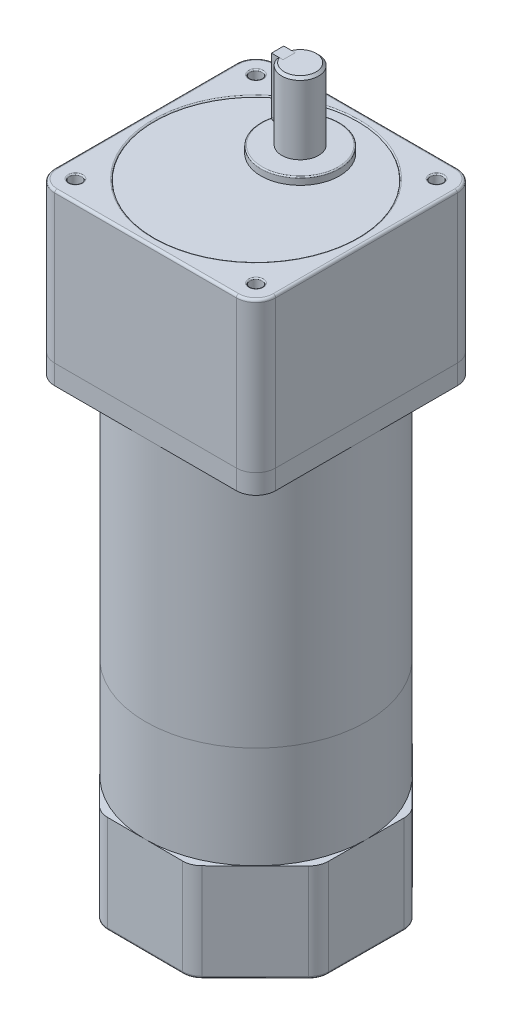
ISO-10303-21;
HEADER;
FILE_DESCRIPTION(('STEP AP214'),'2;1');
FILE_NAME('part.step','',(''),(''),'','','');
FILE_SCHEMA(('AUTOMOTIVE_DESIGN { 1 0 10303 214 1 1 1 1 }'));
ENDSEC;
DATA;
#1=APPLICATION_CONTEXT('core data for automotive mechanical design processes');
#2=APPLICATION_PROTOCOL_DEFINITION('international standard','automotive_design',2000,#1);
#3=PRODUCT_CONTEXT('',#1,'mechanical');
#4=PRODUCT('Part','Part','',(#3));
#5=PRODUCT_RELATED_PRODUCT_CATEGORY('part','',(#4));
#6=PRODUCT_DEFINITION_FORMATION('','',#4);
#7=PRODUCT_DEFINITION_CONTEXT('part definition',#1,'design');
#8=PRODUCT_DEFINITION('design','',#6,#7);
#9=PRODUCT_DEFINITION_SHAPE('','',#8);
#10=(LENGTH_UNIT() NAMED_UNIT(*) SI_UNIT(.MILLI.,.METRE.));
#11=(NAMED_UNIT(*) PLANE_ANGLE_UNIT() SI_UNIT($,.RADIAN.));
#12=(NAMED_UNIT(*) SI_UNIT($,.STERADIAN.) SOLID_ANGLE_UNIT());
#13=UNCERTAINTY_MEASURE_WITH_UNIT(LENGTH_MEASURE(1.E-05),#10,'distance_accuracy_value','');
#14=(GEOMETRIC_REPRESENTATION_CONTEXT(3) GLOBAL_UNCERTAINTY_ASSIGNED_CONTEXT((#13)) GLOBAL_UNIT_ASSIGNED_CONTEXT((#10,
#11,#12)) REPRESENTATION_CONTEXT('',''));
#15=CARTESIAN_POINT('',(0.,0.,0.));
#16=DIRECTION('',(0.,0.,1.));
#17=DIRECTION('',(1.,0.,0.));
#18=AXIS2_PLACEMENT_3D('',#15,#16,#17);
#19=CARTESIAN_POINT('',(-9.5,9.5,-18.));
#20=DIRECTION('',(1.,0.,0.));
#21=DIRECTION('',(0.,0.,-1.));
#22=AXIS2_PLACEMENT_3D('',#19,#20,#21);
#23=CYLINDRICAL_SURFACE('',#22,2.5);
#24=DIRECTION('',(1.,0.,0.));
#25=VECTOR('',#24,1.);
#26=CARTESIAN_POINT('',(-9.5,9.5,-15.5));
#27=LINE('',#26,#25);
#28=CARTESIAN_POINT('',(-9.19999999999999,9.5,-15.5));
#29=VERTEX_POINT('',#28);
#30=CARTESIAN_POINT('',(-4.5,9.5,-15.5));
#31=VERTEX_POINT('',#30);
#32=EDGE_CURVE('E99',#29,#31,#27,.T.);
#33=ORIENTED_EDGE('',*,*,#32,.F.);
#34=CARTESIAN_POINT('',(-9.19999999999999,9.5,-18.));
#35=DIRECTION('',(-1.,0.,0.));
#36=DIRECTION('',(0.,0.,1.));
#37=AXIS2_PLACEMENT_3D('',#34,#35,#36);
#38=CIRCLE('',#37,2.5);
#39=CARTESIAN_POINT('',(-9.19999999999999,9.5,-20.5));
#40=VERTEX_POINT('',#39);
#41=EDGE_CURVE('E57',#29,#40,#38,.F.);
#42=ORIENTED_EDGE('',*,*,#41,.T.);
#43=DIRECTION('',(1.,0.,0.));
#44=VECTOR('',#43,1.);
#45=CARTESIAN_POINT('',(-9.5,9.5,-20.5));
#46=LINE('',#45,#44);
#47=CARTESIAN_POINT('',(-4.5,9.5,-20.5));
#48=VERTEX_POINT('',#47);
#49=EDGE_CURVE('E116',#40,#48,#46,.T.);
#50=ORIENTED_EDGE('',*,*,#49,.T.);
#51=CARTESIAN_POINT('',(-4.5,9.5,-18.));
#52=DIRECTION('',(-1.,0.,0.));
#53=DIRECTION('',(0.,0.,1.));
#54=AXIS2_PLACEMENT_3D('',#51,#52,#53);
#55=CIRCLE('',#54,2.5);
#56=EDGE_CURVE('E112',#48,#31,#55,.T.);
#57=ORIENTED_EDGE('',*,*,#56,.T.);
#58=EDGE_LOOP('',(#33,#42,#50,#57));
#59=FACE_BOUND('',#58,.T.);
#60=ADVANCED_FACE('F48',(#59),#23,.T.);
#61=CARTESIAN_POINT('',(-9.5,32.,-15.5));
#62=DIRECTION('',(0.,0.,-1.));
#63=DIRECTION('',(-1.,0.,0.));
#64=AXIS2_PLACEMENT_3D('',#61,#62,#63);
#65=PLANE('',#64);
#66=DIRECTION('',(1.,0.,0.));
#67=VECTOR('',#66,1.);
#68=CARTESIAN_POINT('',(-9.5,32.,-15.5));
#69=LINE('',#68,#67);
#70=CARTESIAN_POINT('',(-9.19999999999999,32.,-15.5));
#71=VERTEX_POINT('',#70);
#72=CARTESIAN_POINT('',(-4.5,32.,-15.5));
#73=VERTEX_POINT('',#72);
#74=EDGE_CURVE('E106',#71,#73,#69,.T.);
#75=ORIENTED_EDGE('',*,*,#74,.F.);
#76=DIRECTION('',(0.,-1.,0.));
#77=VECTOR('',#76,1.);
#78=CARTESIAN_POINT('',(-9.19999999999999,9.5,-15.5));
#79=LINE('',#78,#77);
#80=EDGE_CURVE('E12',#71,#29,#79,.T.);
#81=ORIENTED_EDGE('',*,*,#80,.T.);
#82=ORIENTED_EDGE('',*,*,#32,.T.);
#83=DIRECTION('',(0.,1.,0.));
#84=VECTOR('',#83,1.);
#85=CARTESIAN_POINT('',(-4.5,32.,-15.5));
#86=LINE('',#85,#84);
#87=EDGE_CURVE('E102',#31,#73,#86,.T.);
#88=ORIENTED_EDGE('',*,*,#87,.T.);
#89=EDGE_LOOP('',(#75,#81,#82,#88));
#90=FACE_BOUND('',#89,.T.);
#91=ADVANCED_FACE('F101',(#90),#65,.F.);
#92=CARTESIAN_POINT('',(-9.5,32.,-20.5));
#93=DIRECTION('',(0.,-1.,0.));
#94=DIRECTION('',(0.,0.,-1.));
#95=AXIS2_PLACEMENT_3D('',#92,#93,#94);
#96=PLANE('',#95);
#97=DIRECTION('',(1.,0.,0.));
#98=VECTOR('',#97,1.);
#99=CARTESIAN_POINT('',(-9.5,32.,-20.5));
#100=LINE('',#99,#98);
#101=CARTESIAN_POINT('',(-9.19999999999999,32.,-20.5));
#102=VERTEX_POINT('',#101);
#103=CARTESIAN_POINT('',(-4.5,32.,-20.5));
#104=VERTEX_POINT('',#103);
#105=EDGE_CURVE('E126',#102,#104,#100,.T.);
#106=ORIENTED_EDGE('',*,*,#105,.F.);
#107=DIRECTION('',(0.,0.,1.));
#108=VECTOR('',#107,1.);
#109=CARTESIAN_POINT('',(-9.19999999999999,32.,-15.5));
#110=LINE('',#109,#108);
#111=EDGE_CURVE('E137',#102,#71,#110,.T.);
#112=ORIENTED_EDGE('',*,*,#111,.T.);
#113=ORIENTED_EDGE('',*,*,#74,.T.);
#114=DIRECTION('',(0.,0.,-1.));
#115=VECTOR('',#114,1.);
#116=CARTESIAN_POINT('',(-4.5,32.,-20.5));
#117=LINE('',#116,#115);
#118=EDGE_CURVE('E114',#73,#104,#117,.T.);
#119=ORIENTED_EDGE('',*,*,#118,.T.);
#120=EDGE_LOOP('',(#106,#112,#113,#119));
#121=FACE_BOUND('',#120,.T.);
#122=ADVANCED_FACE('F166',(#121),#96,.F.);
#123=CARTESIAN_POINT('',(-9.5,9.5,-20.5));
#124=DIRECTION('',(0.,0.,1.));
#125=DIRECTION('',(1.,0.,0.));
#126=AXIS2_PLACEMENT_3D('',#123,#124,#125);
#127=PLANE('',#126);
#128=ORIENTED_EDGE('',*,*,#49,.F.);
#129=DIRECTION('',(0.,1.,0.));
#130=VECTOR('',#129,1.);
#131=CARTESIAN_POINT('',(-9.19999999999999,32.,-20.5));
#132=LINE('',#131,#130);
#133=EDGE_CURVE('E140',#40,#102,#132,.T.);
#134=ORIENTED_EDGE('',*,*,#133,.T.);
#135=ORIENTED_EDGE('',*,*,#105,.T.);
#136=DIRECTION('',(0.,-1.,0.));
#137=VECTOR('',#136,1.);
#138=CARTESIAN_POINT('',(-4.5,9.5,-20.5));
#139=LINE('',#138,#137);
#140=EDGE_CURVE('E123',#104,#48,#139,.T.);
#141=ORIENTED_EDGE('',*,*,#140,.T.);
#142=EDGE_LOOP('',(#128,#134,#135,#141));
#143=FACE_BOUND('',#142,.T.);
#144=ADVANCED_FACE('F168',(#143),#127,.F.);
#145=CARTESIAN_POINT('',(-9.5,9.5,-18.));
#146=DIRECTION('',(-1.,0.,0.));
#147=DIRECTION('',(0.,0.,1.));
#148=AXIS2_PLACEMENT_3D('',#145,#146,#147);
#149=PLANE('',#148);
#150=DIRECTION('',(0.,1.,0.));
#151=VECTOR('',#150,1.);
#152=CARTESIAN_POINT('',(-9.5,32.,-15.8));
#153=LINE('',#152,#151);
#154=CARTESIAN_POINT('',(-9.5,9.5,-15.8));
#155=VERTEX_POINT('',#154);
#156=CARTESIAN_POINT('',(-9.5,31.7,-15.8));
#157=VERTEX_POINT('',#156);
#158=EDGE_CURVE('E105',#155,#157,#153,.T.);
#159=ORIENTED_EDGE('',*,*,#158,.T.);
#160=DIRECTION('',(0.,0.,-1.));
#161=VECTOR('',#160,1.);
#162=CARTESIAN_POINT('',(-9.5,31.7,-20.5));
#163=LINE('',#162,#161);
#164=CARTESIAN_POINT('',(-9.5,31.7,-20.2));
#165=VERTEX_POINT('',#164);
#166=EDGE_CURVE('E134',#157,#165,#163,.T.);
#167=ORIENTED_EDGE('',*,*,#166,.T.);
#168=DIRECTION('',(0.,-1.,0.));
#169=VECTOR('',#168,1.);
#170=CARTESIAN_POINT('',(-9.5,9.5,-20.2));
#171=LINE('',#170,#169);
#172=CARTESIAN_POINT('',(-9.5,9.5,-20.2));
#173=VERTEX_POINT('',#172);
#174=EDGE_CURVE('E132',#165,#173,#171,.T.);
#175=ORIENTED_EDGE('',*,*,#174,.T.);
#176=CARTESIAN_POINT('',(-9.5,9.5,-18.));
#177=DIRECTION('',(-1.,0.,0.));
#178=DIRECTION('',(0.,0.,1.));
#179=AXIS2_PLACEMENT_3D('',#176,#177,#178);
#180=CIRCLE('',#179,2.19999999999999);
#181=EDGE_CURVE('E130',#173,#155,#180,.T.);
#182=ORIENTED_EDGE('',*,*,#181,.T.);
#183=EDGE_LOOP('',(#159,#167,#175,#182));
#184=FACE_BOUND('',#183,.T.);
#185=ADVANCED_FACE('F158',(#184),#149,.T.);
#186=CARTESIAN_POINT('',(-4.5,9.5,-18.));
#187=DIRECTION('',(-1.,0.,0.));
#188=DIRECTION('',(0.,0.,1.));
#189=AXIS2_PLACEMENT_3D('',#186,#187,#188);
#190=PLANE('',#189);
#191=ORIENTED_EDGE('',*,*,#56,.F.);
#192=ORIENTED_EDGE('',*,*,#140,.F.);
#193=ORIENTED_EDGE('',*,*,#118,.F.);
#194=ORIENTED_EDGE('',*,*,#87,.F.);
#195=EDGE_LOOP('',(#191,#192,#193,#194));
#196=FACE_BOUND('',#195,.T.);
#197=ADVANCED_FACE('F110',(#196),#190,.F.);
#198=CARTESIAN_POINT('',(-9.5,9.5,-18.));
#199=DIRECTION('',(1.,0.,0.));
#200=DIRECTION('',(0.,0.,-1.));
#201=AXIS2_PLACEMENT_3D('',#198,#199,#200);
#202=CONICAL_SURFACE('',#201,2.19999999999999,0.785398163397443);
#203=DIRECTION('',(-0.707106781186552,0.,0.707106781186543));
#204=VECTOR('',#203,1.);
#205=CARTESIAN_POINT('',(-9.19999999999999,9.5,-20.5));
#206=LINE('',#205,#204);
#207=EDGE_CURVE('E120',#40,#173,#206,.T.);
#208=ORIENTED_EDGE('',*,*,#207,.F.);
#209=ORIENTED_EDGE('',*,*,#41,.F.);
#210=DIRECTION('',(0.707106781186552,0.,0.707106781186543));
#211=VECTOR('',#210,1.);
#212=CARTESIAN_POINT('',(-9.5,9.5,-15.8));
#213=LINE('',#212,#211);
#214=EDGE_CURVE('E52',#155,#29,#213,.T.);
#215=ORIENTED_EDGE('',*,*,#214,.F.);
#216=ORIENTED_EDGE('',*,*,#181,.F.);
#217=EDGE_LOOP('',(#208,#209,#215,#216));
#218=FACE_BOUND('',#217,.T.);
#219=ADVANCED_FACE('F50',(#218),#202,.T.);
#220=CARTESIAN_POINT('',(-9.5,9.5,-15.8));
#221=DIRECTION('',(-0.707106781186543,0.,0.707106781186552));
#222=DIRECTION('',(0.,-1.,0.));
#223=AXIS2_PLACEMENT_3D('',#220,#221,#222);
#224=PLANE('',#223);
#225=ORIENTED_EDGE('',*,*,#214,.T.);
#226=ORIENTED_EDGE('',*,*,#80,.F.);
#227=DIRECTION('',(-0.577350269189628,-0.577350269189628,-0.577350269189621));
#228=VECTOR('',#227,1.);
#229=CARTESIAN_POINT('',(-16.9000000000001,24.2999999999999,-23.2));
#230=LINE('',#229,#228);
#231=EDGE_CURVE('E145',#157,#71,#230,.F.);
#232=ORIENTED_EDGE('',*,*,#231,.F.);
#233=ORIENTED_EDGE('',*,*,#158,.F.);
#234=EDGE_LOOP('',(#225,#226,#232,#233));
#235=FACE_BOUND('',#234,.T.);
#236=ADVANCED_FACE('F188',(#235),#224,.T.);
#237=CARTESIAN_POINT('',(-9.5,9.5,-20.2));
#238=DIRECTION('',(-0.707106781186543,0.,-0.707106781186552));
#239=DIRECTION('',(0.,1.,0.));
#240=AXIS2_PLACEMENT_3D('',#237,#238,#239);
#241=PLANE('',#240);
#242=ORIENTED_EDGE('',*,*,#207,.T.);
#243=ORIENTED_EDGE('',*,*,#174,.F.);
#244=DIRECTION('',(0.577350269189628,0.577350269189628,-0.577350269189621));
#245=VECTOR('',#244,1.);
#246=CARTESIAN_POINT('',(-16.9000000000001,24.2999999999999,-12.8));
#247=LINE('',#246,#245);
#248=EDGE_CURVE('E143',#102,#165,#247,.F.);
#249=ORIENTED_EDGE('',*,*,#248,.F.);
#250=ORIENTED_EDGE('',*,*,#133,.F.);
#251=EDGE_LOOP('',(#242,#243,#249,#250));
#252=FACE_BOUND('',#251,.T.);
#253=ADVANCED_FACE('F151',(#252),#241,.T.);
#254=CARTESIAN_POINT('',(-9.5,31.7,-18.));
#255=DIRECTION('',(-0.707106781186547,0.707106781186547,0.));
#256=DIRECTION('',(0.,0.,1.));
#257=AXIS2_PLACEMENT_3D('',#254,#255,#256);
#258=PLANE('',#257);
#259=ORIENTED_EDGE('',*,*,#231,.T.);
#260=ORIENTED_EDGE('',*,*,#111,.F.);
#261=ORIENTED_EDGE('',*,*,#248,.T.);
#262=ORIENTED_EDGE('',*,*,#166,.F.);
#263=EDGE_LOOP('',(#259,#260,#261,#262));
#264=FACE_BOUND('',#263,.T.);
#265=ADVANCED_FACE('F162',(#264),#258,.T.);
#266=CLOSED_SHELL('',(#60,#91,#122,#144,#185,#197,#219,#236,#253,#265));
#267=MANIFOLD_SOLID_BREP('B2',#266);
#268=CARTESIAN_POINT('',(0.,32.,-18.));
#269=DIRECTION('',(0.,-1.,0.));
#270=DIRECTION('',(0.,0.,-1.));
#271=AXIS2_PLACEMENT_3D('',#268,#269,#270);
#272=CYLINDRICAL_SURFACE('',#271,7.5);
#273=CARTESIAN_POINT('',(0.,3.,-18.));
#274=DIRECTION('',(0.,1.,0.));
#275=DIRECTION('',(0.,0.,1.));
#276=AXIS2_PLACEMENT_3D('',#273,#274,#275);
#277=CIRCLE('',#276,7.5);
#278=CARTESIAN_POINT('',(0.,3.,-10.5));
#279=VERTEX_POINT('',#278);
#280=EDGE_CURVE('E340',#279,#279,#277,.T.);
#281=ORIENTED_EDGE('',*,*,#280,.T.);
#282=EDGE_LOOP('',(#281));
#283=FACE_BOUND('',#282,.T.);
#284=DIRECTION('',(0.,-1.,0.));
#285=VECTOR('',#284,1.);
#286=CARTESIAN_POINT('',(-7.07106781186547,32.,-20.5));
#287=LINE('',#286,#285);
#288=CARTESIAN_POINT('',(-7.07106781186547,31.,-20.5));
#289=VERTEX_POINT('',#288);
#290=CARTESIAN_POINT('',(-7.07106781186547,9.5,-20.5));
#291=VERTEX_POINT('',#290);
#292=EDGE_CURVE('E329',#289,#291,#287,.T.);
#293=ORIENTED_EDGE('',*,*,#292,.F.);
#294=CARTESIAN_POINT('',(0.,31.,-18.));
#295=DIRECTION('',(0.,1.,0.));
#296=DIRECTION('',(0.,0.,1.));
#297=AXIS2_PLACEMENT_3D('',#294,#295,#296);
#298=CIRCLE('',#297,7.5);
#299=CARTESIAN_POINT('',(-7.07106781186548,31.,-15.5));
#300=VERTEX_POINT('',#299);
#301=EDGE_CURVE('E273',#289,#300,#298,.F.);
#302=ORIENTED_EDGE('',*,*,#301,.T.);
#303=DIRECTION('',(0.,-1.,0.));
#304=VECTOR('',#303,1.);
#305=CARTESIAN_POINT('',(-7.07106781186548,32.,-15.5));
#306=LINE('',#305,#304);
#307=CARTESIAN_POINT('',(-7.07106781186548,9.5,-15.5));
#308=VERTEX_POINT('',#307);
#309=EDGE_CURVE('E331',#308,#300,#306,.F.);
#310=ORIENTED_EDGE('',*,*,#309,.F.);
#311=CARTESIAN_POINT('',(-7.07106781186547,9.5,-20.5));
#312=CARTESIAN_POINT('',(-7.07105693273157,9.43179292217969,-20.5000089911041));
#313=CARTESIAN_POINT('',(-7.07205443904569,9.36359192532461,-20.4972088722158));
#314=CARTESIAN_POINT('',(-7.07598524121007,9.22771896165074,-20.4860604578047));
#315=CARTESIAN_POINT('',(-7.07891801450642,9.16004685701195,-20.477713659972));
#316=CARTESIAN_POINT('',(-7.08662705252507,9.02590951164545,-20.455574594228));
#317=CARTESIAN_POINT('',(-7.09139784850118,8.95944129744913,-20.4417984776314));
#318=CARTESIAN_POINT('',(-7.10262619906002,8.8279917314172,-20.4089418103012));
#319=CARTESIAN_POINT('',(-7.10908381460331,8.7630104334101,-20.3898610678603));
#320=CARTESIAN_POINT('',(-7.13069940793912,8.57103842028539,-20.324915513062));
#321=CARTESIAN_POINT('',(-7.14811243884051,8.44682084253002,-20.2713141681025));
#322=CARTESIAN_POINT('',(-7.1869703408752,8.20912318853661,-20.1451778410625));
#323=CARTESIAN_POINT('',(-7.20841768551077,8.09564976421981,-20.0726312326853));
#324=CARTESIAN_POINT('',(-7.25386182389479,7.87820709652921,-19.9076299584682));
#325=CARTESIAN_POINT('',(-7.27792189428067,7.7747148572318,-19.8145628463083));
#326=CARTESIAN_POINT('',(-7.32534626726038,7.58448289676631,-19.6124707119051));
#327=CARTESIAN_POINT('',(-7.34871044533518,7.49774615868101,-19.5034428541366));
#328=CARTESIAN_POINT('',(-7.39284706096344,7.34130177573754,-19.2690092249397));
#329=CARTESIAN_POINT('',(-7.41353593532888,7.27209769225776,-19.1432502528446));
#330=CARTESIAN_POINT('',(-7.44924021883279,7.1560192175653,-18.8810730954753));
#331=CARTESIAN_POINT('',(-7.46425736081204,7.10913800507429,-18.7446581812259));
#332=CARTESIAN_POINT('',(-7.48647677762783,7.04066072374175,-18.4700733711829));
#333=CARTESIAN_POINT('',(-7.49393272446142,7.01824182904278,-18.3321295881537));
#334=CARTESIAN_POINT('',(-7.50109021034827,6.99670924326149,-18.0542474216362));
#335=CARTESIAN_POINT('',(-7.50079359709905,6.99758999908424,-17.9143095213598));
#336=CARTESIAN_POINT('',(-7.49265096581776,7.0221107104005,-17.6422403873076));
#337=CARTESIAN_POINT('',(-7.48510152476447,7.04485659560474,-17.5100182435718));
#338=CARTESIAN_POINT('',(-7.46367401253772,7.1109829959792,-17.2513898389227));
#339=CARTESIAN_POINT('',(-7.44979559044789,7.15436465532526,-17.1249839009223));
#340=CARTESIAN_POINT('',(-7.41689170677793,7.26105342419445,-16.8796184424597));
#341=CARTESIAN_POINT('',(-7.39780094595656,7.32461511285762,-16.760778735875));
#342=CARTESIAN_POINT('',(-7.35645969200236,7.46964987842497,-16.5351885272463));
#343=CARTESIAN_POINT('',(-7.33420833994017,7.55112782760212,-16.4284413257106));
#344=CARTESIAN_POINT('',(-7.28765679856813,7.73417762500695,-16.2247566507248));
#345=CARTESIAN_POINT('',(-7.26330946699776,7.83651385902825,-16.128515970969));
#346=CARTESIAN_POINT('',(-7.21618726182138,8.05610372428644,-15.9543199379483));
#347=CARTESIAN_POINT('',(-7.19341289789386,8.17336215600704,-15.8763704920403));
#348=CARTESIAN_POINT('',(-7.15175078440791,8.4217004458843,-15.7399916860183));
#349=CARTESIAN_POINT('',(-7.13292537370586,8.55295878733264,-15.6818674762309));
#350=CARTESIAN_POINT('',(-7.10202742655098,8.8241174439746,-15.5888494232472));
#351=CARTESIAN_POINT('',(-7.08994423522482,8.96400373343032,-15.5539189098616));
#352=CARTESIAN_POINT('',(-7.078413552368,9.17104659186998,-15.5208546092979));
#353=CARTESIAN_POINT('',(-7.07566669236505,9.23660347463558,-15.5130373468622));
#354=CARTESIAN_POINT('',(-7.07199258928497,9.36809519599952,-15.502613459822));
#355=CARTESIAN_POINT('',(-7.0710629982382,9.43402943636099,-15.5000001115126));
#356=CARTESIAN_POINT('',(-7.07106781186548,9.5,-15.5));
#357=B_SPLINE_CURVE_WITH_KNOTS('',3,(#311,#312,#313,#314,#315,#316,#317,#318,#319,#320,#321,
#322,#323,#324,#325,#326,#327,#328,#329,#330,#331,#332,#333,#334,#335,#336,#337,#338,#339,#340,
#341,#342,#343,#344,#345,#346,#347,#348,#349,#350,#351,#352,#353,#354,#355,#356),.UNSPECIFIED.,
.F.,.F.,(4,2,2,2,2,2,2,2,2,2,2,2,2,2,2,2,2,2,2,2,2,2,4),(0.,0.204546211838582,0.409037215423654,
0.612924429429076,0.81681901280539,1.22401016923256,1.63145179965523,2.0532786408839,
2.47518051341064,2.90809434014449,3.34087579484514,3.75860278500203,4.17623021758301,
4.57747647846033,4.97874498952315,5.38529148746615,5.79194868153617,6.21771736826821,
6.64362337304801,7.07581676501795,7.50732520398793,7.70536340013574,7.90314555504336),.UNSPECIFIED.);
#358=EDGE_CURVE('E343',#291,#308,#357,.T.);
#359=ORIENTED_EDGE('',*,*,#358,.F.);
#360=EDGE_LOOP('',(#293,#302,#310,#359));
#361=FACE_BOUND('',#360,.T.);
#362=ADVANCED_FACE('F260',(#283,#361),#272,.T.);
#363=CARTESIAN_POINT('',(0.,32.,-18.));
#364=DIRECTION('',(0.,1.,0.));
#365=DIRECTION('',(0.,0.,1.));
#366=AXIS2_PLACEMENT_3D('',#363,#364,#365);
#367=PLANE('',#366);
#368=DIRECTION('',(-1.,0.,0.));
#369=VECTOR('',#368,1.);
#370=CARTESIAN_POINT('',(-4.5,32.,-15.5));
#371=LINE('',#370,#369);
#372=CARTESIAN_POINT('',(-4.5,32.,-15.5));
#373=VERTEX_POINT('',#372);
#374=CARTESIAN_POINT('',(-6.00000000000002,32.,-15.5));
#375=VERTEX_POINT('',#374);
#376=EDGE_CURVE('E335',#373,#375,#371,.T.);
#377=ORIENTED_EDGE('',*,*,#376,.T.);
#378=CARTESIAN_POINT('',(0.,32.,-18.));
#379=DIRECTION('',(0.,1.,0.));
#380=DIRECTION('',(0.,0.,1.));
#381=AXIS2_PLACEMENT_3D('',#378,#379,#380);
#382=CIRCLE('',#381,6.50000000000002);
#383=CARTESIAN_POINT('',(-6.00000000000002,32.,-20.5));
#384=VERTEX_POINT('',#383);
#385=EDGE_CURVE('E349',#375,#384,#382,.T.);
#386=ORIENTED_EDGE('',*,*,#385,.T.);
#387=DIRECTION('',(-1.,0.,0.));
#388=VECTOR('',#387,1.);
#389=CARTESIAN_POINT('',(-4.5,32.,-20.5));
#390=LINE('',#389,#388);
#391=CARTESIAN_POINT('',(-4.5,32.,-20.5));
#392=VERTEX_POINT('',#391);
#393=EDGE_CURVE('E332',#392,#384,#390,.T.);
#394=ORIENTED_EDGE('',*,*,#393,.F.);
#395=DIRECTION('',(0.,0.,1.));
#396=VECTOR('',#395,1.);
#397=CARTESIAN_POINT('',(-4.5,32.,-20.5));
#398=LINE('',#397,#396);
#399=EDGE_CURVE('E316',#392,#373,#398,.T.);
#400=ORIENTED_EDGE('',*,*,#399,.T.);
#401=EDGE_LOOP('',(#377,#386,#394,#400));
#402=FACE_BOUND('',#401,.T.);
#403=ADVANCED_FACE('F359',(#402),#367,.T.);
#404=CARTESIAN_POINT('',(0.,3.,-18.));
#405=DIRECTION('',(0.,1.,0.));
#406=DIRECTION('',(0.,0.,1.));
#407=AXIS2_PLACEMENT_3D('',#404,#405,#406);
#408=PLANE('',#407);
#409=ORIENTED_EDGE('',*,*,#280,.F.);
#410=EDGE_LOOP('',(#409));
#411=FACE_BOUND('',#410,.T.);
#412=ADVANCED_FACE('F357',(#411),#408,.F.);
#413=CARTESIAN_POINT('',(-4.5,9.5,-18.));
#414=DIRECTION('',(-1.,0.,0.));
#415=DIRECTION('',(0.,0.,1.));
#416=AXIS2_PLACEMENT_3D('',#413,#414,#415);
#417=CYLINDRICAL_SURFACE('',#416,2.5);
#418=DIRECTION('',(-1.,0.,0.));
#419=VECTOR('',#418,1.);
#420=CARTESIAN_POINT('',(-4.5,9.5,-20.5));
#421=LINE('',#420,#419);
#422=CARTESIAN_POINT('',(-4.5,9.5,-20.5));
#423=VERTEX_POINT('',#422);
#424=EDGE_CURVE('E324',#423,#291,#421,.T.);
#425=ORIENTED_EDGE('',*,*,#424,.T.);
#426=ORIENTED_EDGE('',*,*,#358,.T.);
#427=DIRECTION('',(-1.,0.,0.));
#428=VECTOR('',#427,1.);
#429=CARTESIAN_POINT('',(-4.5,9.5,-15.5));
#430=LINE('',#429,#428);
#431=CARTESIAN_POINT('',(-4.5,9.5,-15.5));
#432=VERTEX_POINT('',#431);
#433=EDGE_CURVE('E326',#432,#308,#430,.T.);
#434=ORIENTED_EDGE('',*,*,#433,.F.);
#435=CARTESIAN_POINT('',(-4.5,9.5,-18.));
#436=DIRECTION('',(1.,0.,0.));
#437=DIRECTION('',(0.,0.,-1.));
#438=AXIS2_PLACEMENT_3D('',#435,#436,#437);
#439=CIRCLE('',#438,2.5);
#440=EDGE_CURVE('E314',#432,#423,#439,.T.);
#441=ORIENTED_EDGE('',*,*,#440,.T.);
#442=EDGE_LOOP('',(#425,#426,#434,#441));
#443=FACE_BOUND('',#442,.T.);
#444=ADVANCED_FACE('F323',(#443),#417,.F.);
#445=CARTESIAN_POINT('',(-4.5,9.5,-20.5));
#446=DIRECTION('',(0.,0.,1.));
#447=DIRECTION('',(1.,0.,0.));
#448=AXIS2_PLACEMENT_3D('',#445,#446,#447);
#449=PLANE('',#448);
#450=ORIENTED_EDGE('',*,*,#393,.T.);
#451=CARTESIAN_POINT('',(-6.00000000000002,32.,-20.5));
#452=CARTESIAN_POINT('',(-6.0897273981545,31.9171731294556,-20.5));
#453=CARTESIAN_POINT('',(-6.17931930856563,31.8341996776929,-20.5));
#454=CARTESIAN_POINT('',(-6.35825867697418,31.6679908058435,-20.5));
#455=CARTESIAN_POINT('',(-6.44760613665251,31.5847553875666,-20.5));
#456=CARTESIAN_POINT('',(-6.62608424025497,31.4180527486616,-20.5));
#457=CARTESIAN_POINT('',(-6.7152148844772,31.3345855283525,-20.5));
#458=CARTESIAN_POINT('',(-6.89328182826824,31.1674427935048,-20.5));
#459=CARTESIAN_POINT('',(-6.98221812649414,31.0837672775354,-20.5));
#460=CARTESIAN_POINT('',(-7.07106781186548,31.,-20.5));
#461=B_SPLINE_CURVE_WITH_KNOTS('',3,(#451,#452,#453,#454,#455,#456,#457,#458,#459,#460),
.UNSPECIFIED.,.F.,.F.,(4,2,2,2,4),(0.,0.366335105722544,0.732667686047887,1.09899976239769,
1.46533436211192),.UNSPECIFIED.);
#462=EDGE_CURVE('E287',#384,#289,#461,.T.);
#463=ORIENTED_EDGE('',*,*,#462,.T.);
#464=ORIENTED_EDGE('',*,*,#292,.T.);
#465=ORIENTED_EDGE('',*,*,#424,.F.);
#466=DIRECTION('',(0.,1.,0.));
#467=VECTOR('',#466,1.);
#468=CARTESIAN_POINT('',(-4.5,9.5,-20.5));
#469=LINE('',#468,#467);
#470=EDGE_CURVE('E311',#423,#392,#469,.T.);
#471=ORIENTED_EDGE('',*,*,#470,.T.);
#472=EDGE_LOOP('',(#450,#463,#464,#465,#471));
#473=FACE_BOUND('',#472,.T.);
#474=ADVANCED_FACE('F328',(#473),#449,.T.);
#475=CARTESIAN_POINT('',(-4.5,32.,-15.5));
#476=DIRECTION('',(0.,0.,-1.));
#477=DIRECTION('',(-1.,0.,0.));
#478=AXIS2_PLACEMENT_3D('',#475,#476,#477);
#479=PLANE('',#478);
#480=ORIENTED_EDGE('',*,*,#309,.T.);
#481=CARTESIAN_POINT('',(-7.07106781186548,31.,-15.5));
#482=CARTESIAN_POINT('',(-6.98221812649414,31.0837672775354,-15.5));
#483=CARTESIAN_POINT('',(-6.89328182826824,31.1674427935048,-15.5));
#484=CARTESIAN_POINT('',(-6.7152148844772,31.3345855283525,-15.5));
#485=CARTESIAN_POINT('',(-6.62608424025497,31.4180527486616,-15.5));
#486=CARTESIAN_POINT('',(-6.44760613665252,31.5847553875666,-15.5));
#487=CARTESIAN_POINT('',(-6.35825867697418,31.6679908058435,-15.5));
#488=CARTESIAN_POINT('',(-6.17931930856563,31.8341996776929,-15.5));
#489=CARTESIAN_POINT('',(-6.0897273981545,31.9171731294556,-15.5));
#490=CARTESIAN_POINT('',(-6.00000000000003,32.,-15.5));
#491=B_SPLINE_CURVE_WITH_KNOTS('',3,(#481,#482,#483,#484,#485,#486,#487,#488,#489,#490),
.UNSPECIFIED.,.F.,.F.,(4,2,2,2,4),(0.,0.36633459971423,0.732666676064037,1.09899925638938,
1.46533436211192),.UNSPECIFIED.);
#492=EDGE_CURVE('E46',#300,#375,#491,.T.);
#493=ORIENTED_EDGE('',*,*,#492,.T.);
#494=ORIENTED_EDGE('',*,*,#376,.F.);
#495=DIRECTION('',(0.,-1.,0.));
#496=VECTOR('',#495,1.);
#497=CARTESIAN_POINT('',(-4.5,32.,-15.5));
#498=LINE('',#497,#496);
#499=EDGE_CURVE('E381',#373,#432,#498,.T.);
#500=ORIENTED_EDGE('',*,*,#499,.T.);
#501=ORIENTED_EDGE('',*,*,#433,.T.);
#502=EDGE_LOOP('',(#480,#493,#494,#500,#501));
#503=FACE_BOUND('',#502,.T.);
#504=ADVANCED_FACE('F385',(#503),#479,.T.);
#505=CARTESIAN_POINT('',(-4.5,9.5,-18.));
#506=DIRECTION('',(1.,0.,0.));
#507=DIRECTION('',(0.,0.,-1.));
#508=AXIS2_PLACEMENT_3D('',#505,#506,#507);
#509=PLANE('',#508);
#510=ORIENTED_EDGE('',*,*,#440,.F.);
#511=ORIENTED_EDGE('',*,*,#499,.F.);
#512=ORIENTED_EDGE('',*,*,#399,.F.);
#513=ORIENTED_EDGE('',*,*,#470,.F.);
#514=EDGE_LOOP('',(#510,#511,#512,#513));
#515=FACE_BOUND('',#514,.T.);
#516=ADVANCED_FACE('F313',(#515),#509,.F.);
#517=CARTESIAN_POINT('',(0.,32.,-18.));
#518=DIRECTION('',(0.,-1.,0.));
#519=DIRECTION('',(0.,0.,-1.));
#520=AXIS2_PLACEMENT_3D('',#517,#518,#519);
#521=CONICAL_SURFACE('',#520,6.50000000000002,0.785398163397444);
#522=ORIENTED_EDGE('',*,*,#492,.F.);
#523=ORIENTED_EDGE('',*,*,#301,.F.);
#524=ORIENTED_EDGE('',*,*,#462,.F.);
#525=ORIENTED_EDGE('',*,*,#385,.F.);
#526=EDGE_LOOP('',(#522,#523,#524,#525));
#527=FACE_BOUND('',#526,.T.);
#528=ADVANCED_FACE('F262',(#527),#521,.T.);
#529=CLOSED_SHELL('',(#362,#403,#412,#444,#474,#504,#516,#528));
#530=MANIFOLD_SOLID_BREP('B6',#529);
#531=CARTESIAN_POINT('',(0.,3.,-18.));
#532=DIRECTION('',(0.,-1.,0.));
#533=DIRECTION('',(0.,0.,-1.));
#534=AXIS2_PLACEMENT_3D('',#531,#532,#533);
#535=CYLINDRICAL_SURFACE('',#534,16.);
#536=CARTESIAN_POINT('',(0.,2.5,-18.));
#537=DIRECTION('',(0.,1.,0.));
#538=DIRECTION('',(0.,0.,1.));
#539=AXIS2_PLACEMENT_3D('',#536,#537,#538);
#540=CIRCLE('',#539,16.);
#541=CARTESIAN_POINT('',(0.,2.5,-2.));
#542=VERTEX_POINT('',#541);
#543=EDGE_CURVE('E259',#542,#542,#540,.F.);
#544=ORIENTED_EDGE('',*,*,#543,.T.);
#545=EDGE_LOOP('',(#544));
#546=FACE_BOUND('',#545,.T.);
#547=CARTESIAN_POINT('',(0.,0.,-18.));
#548=DIRECTION('',(0.,1.,0.));
#549=DIRECTION('',(0.,0.,1.));
#550=AXIS2_PLACEMENT_3D('',#547,#548,#549);
#551=CIRCLE('',#550,16.);
#552=CARTESIAN_POINT('',(0.,0.,-2.));
#553=VERTEX_POINT('',#552);
#554=EDGE_CURVE('E461',#553,#553,#551,.T.);
#555=ORIENTED_EDGE('',*,*,#554,.T.);
#556=EDGE_LOOP('',(#555));
#557=FACE_BOUND('',#556,.T.);
#558=ADVANCED_FACE('F450',(#546,#557),#535,.T.);
#559=CARTESIAN_POINT('',(0.,3.,-18.));
#560=DIRECTION('',(0.,1.,0.));
#561=DIRECTION('',(0.,0.,1.));
#562=AXIS2_PLACEMENT_3D('',#559,#560,#561);
#563=PLANE('',#562);
#564=CARTESIAN_POINT('',(0.,3.,-18.));
#565=DIRECTION('',(0.,1.,0.));
#566=DIRECTION('',(0.,0.,1.));
#567=AXIS2_PLACEMENT_3D('',#564,#565,#566);
#568=CIRCLE('',#567,15.5);
#569=CARTESIAN_POINT('',(0.,3.,-2.5));
#570=VERTEX_POINT('',#569);
#571=EDGE_CURVE('E457',#570,#570,#568,.T.);
#572=ORIENTED_EDGE('',*,*,#571,.T.);
#573=EDGE_LOOP('',(#572));
#574=FACE_BOUND('',#573,.T.);
#575=ADVANCED_FACE('F471',(#574),#563,.T.);
#576=CARTESIAN_POINT('',(0.,0.,-18.));
#577=DIRECTION('',(0.,1.,0.));
#578=DIRECTION('',(0.,0.,1.));
#579=AXIS2_PLACEMENT_3D('',#576,#577,#578);
#580=PLANE('',#579);
#581=ORIENTED_EDGE('',*,*,#554,.F.);
#582=EDGE_LOOP('',(#581));
#583=FACE_BOUND('',#582,.T.);
#584=ADVANCED_FACE('F469',(#583),#580,.F.);
#585=CARTESIAN_POINT('',(0.,2.5,-18.));
#586=DIRECTION('',(0.,1.,0.));
#587=DIRECTION('',(0.,0.,1.));
#588=AXIS2_PLACEMENT_3D('',#585,#586,#587);
#589=TOROIDAL_SURFACE('',#588,15.5,0.5);
#590=ORIENTED_EDGE('',*,*,#543,.F.);
#591=EDGE_LOOP('',(#590));
#592=FACE_BOUND('',#591,.T.);
#593=ORIENTED_EDGE('',*,*,#571,.F.);
#594=EDGE_LOOP('',(#593));
#595=FACE_BOUND('',#594,.T.);
#596=ADVANCED_FACE('F452',(#592,#595),#589,.T.);
#597=CLOSED_SHELL('',(#558,#575,#584,#596));
#598=MANIFOLD_SOLID_BREP('B40',#597);
#599=CARTESIAN_POINT('',(36.9458082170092,-250.5,15.4560836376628));
#600=DIRECTION('',(0.,1.,0.));
#601=DIRECTION('',(0.,0.,1.));
#602=AXIS2_PLACEMENT_3D('',#599,#600,#601);
#603=CYLINDRICAL_SURFACE('',#602,8.);
#604=DIRECTION('',(0.,1.,0.));
#605=VECTOR('',#604,1.);
#606=CARTESIAN_POINT('',(42.5827096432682,-250.5,21.1328205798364));
#607=LINE('',#606,#605);
#608=CARTESIAN_POINT('',(42.5827096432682,-249.5,21.1328205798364));
#609=VERTEX_POINT('',#608);
#610=CARTESIAN_POINT('',(42.5827096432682,-210.5,21.1328205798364));
#611=VERTEX_POINT('',#610);
#612=EDGE_CURVE('E674',#609,#611,#607,.T.);
#613=ORIENTED_EDGE('',*,*,#612,.F.);
#614=CARTESIAN_POINT('',(36.9458082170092,-249.5,15.4560836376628));
#615=DIRECTION('',(0.,-1.,0.));
#616=DIRECTION('',(0.,0.,-1.));
#617=AXIS2_PLACEMENT_3D('',#614,#615,#616);
#618=CIRCLE('',#617,8.);
#619=CARTESIAN_POINT('',(44.9457586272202,-249.5,15.484251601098));
#620=VERTEX_POINT('',#619);
#621=EDGE_CURVE('E448',#609,#620,#618,.F.);
#622=ORIENTED_EDGE('',*,*,#621,.T.);
#623=DIRECTION('',(0.,1.,0.));
#624=VECTOR('',#623,1.);
#625=CARTESIAN_POINT('',(44.9457586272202,-250.5,15.484251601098));
#626=LINE('',#625,#624);
#627=CARTESIAN_POINT('',(44.9457586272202,-210.5,15.484251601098));
#628=VERTEX_POINT('',#627);
#629=EDGE_CURVE('E695',#620,#628,#626,.T.);
#630=ORIENTED_EDGE('',*,*,#629,.T.);
#631=CARTESIAN_POINT('',(36.9458082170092,-210.5,15.4560836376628));
#632=DIRECTION('',(0.,-1.,0.));
#633=DIRECTION('',(0.,0.,-1.));
#634=AXIS2_PLACEMENT_3D('',#631,#632,#633);
#635=CIRCLE('',#634,8.);
#636=EDGE_CURVE('E689',#628,#611,#635,.T.);
#637=ORIENTED_EDGE('',*,*,#636,.T.);
#638=EDGE_LOOP('',(#613,#622,#630,#637));
#639=FACE_BOUND('',#638,.T.);
#640=ADVANCED_FACE('F514',(#639),#603,.T.);
#641=CARTESIAN_POINT('',(42.5827096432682,-250.5,21.1328205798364));
#642=DIRECTION('',(-0.704612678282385,0.,-0.709592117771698));
#643=DIRECTION('',(-0.709592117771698,0.,0.704612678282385));
#644=AXIS2_PLACEMENT_3D('',#641,#642,#643);
#645=PLANE('',#644);
#646=DIRECTION('',(0.,1.,0.));
#647=VECTOR('',#646,1.);
#648=CARTESIAN_POINT('',(20.8324314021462,-250.5,42.7304700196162));
#649=LINE('',#648,#647);
#650=CARTESIAN_POINT('',(20.8324314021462,-249.5,42.7304700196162));
#651=VERTEX_POINT('',#650);
#652=CARTESIAN_POINT('',(20.8324314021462,-210.5,42.7304700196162));
#653=VERTEX_POINT('',#652);
#654=EDGE_CURVE('E683',#651,#653,#649,.T.);
#655=ORIENTED_EDGE('',*,*,#654,.F.);
#656=DIRECTION('',(-0.709592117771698,0.,0.704612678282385));
#657=VECTOR('',#656,1.);
#658=CARTESIAN_POINT('',(42.5827096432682,-249.5,21.1328205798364));
#659=LINE('',#658,#657);
#660=EDGE_CURVE('E523',#651,#609,#659,.F.);
#661=ORIENTED_EDGE('',*,*,#660,.T.);
#662=ORIENTED_EDGE('',*,*,#612,.T.);
#663=DIRECTION('',(-0.709592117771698,0.,0.704612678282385));
#664=VECTOR('',#663,1.);
#665=CARTESIAN_POINT('',(42.5827096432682,-210.5,21.1328205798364));
#666=LINE('',#665,#664);
#667=EDGE_CURVE('E677',#611,#653,#666,.T.);
#668=ORIENTED_EDGE('',*,*,#667,.T.);
#669=EDGE_LOOP('',(#655,#661,#662,#668));
#670=FACE_BOUND('',#669,.T.);
#671=ADVANCED_FACE('F676',(#670),#645,.F.);
#672=CARTESIAN_POINT('',(15.1955299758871,-250.5,37.0537330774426));
#673=DIRECTION('',(0.,1.,0.));
#674=DIRECTION('',(0.,0.,1.));
#675=AXIS2_PLACEMENT_3D('',#672,#673,#674);
#676=CYLINDRICAL_SURFACE('',#675,8.);
#677=DIRECTION('',(0.,1.,0.));
#678=VECTOR('',#677,1.);
#679=CARTESIAN_POINT('',(15.1673620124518,-250.5,45.0536834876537));
#680=LINE('',#679,#678);
#681=CARTESIAN_POINT('',(15.1673620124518,-249.5,45.0536834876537));
#682=VERTEX_POINT('',#681);
#683=CARTESIAN_POINT('',(15.1673620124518,-210.5,45.0536834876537));
#684=VERTEX_POINT('',#683);
#685=EDGE_CURVE('E765',#682,#684,#680,.T.);
#686=ORIENTED_EDGE('',*,*,#685,.F.);
#687=CARTESIAN_POINT('',(15.1955299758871,-249.5,37.0537330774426));
#688=DIRECTION('',(0.,-1.,0.));
#689=DIRECTION('',(0.,0.,-1.));
#690=AXIS2_PLACEMENT_3D('',#687,#688,#689);
#691=CIRCLE('',#690,8.);
#692=EDGE_CURVE('E538',#682,#651,#691,.F.);
#693=ORIENTED_EDGE('',*,*,#692,.T.);
#694=ORIENTED_EDGE('',*,*,#654,.T.);
#695=CARTESIAN_POINT('',(15.1955299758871,-210.5,37.0537330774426));
#696=DIRECTION('',(0.,-1.,0.));
#697=DIRECTION('',(0.,0.,1.));
#698=AXIS2_PLACEMENT_3D('',#695,#696,#697);
#699=CIRCLE('',#698,8.);
#700=EDGE_CURVE('E692',#653,#684,#699,.T.);
#701=ORIENTED_EDGE('',*,*,#700,.T.);
#702=EDGE_LOOP('',(#686,#693,#694,#701));
#703=FACE_BOUND('',#702,.T.);
#704=ADVANCED_FACE('F1003',(#703),#676,.T.);
#705=CARTESIAN_POINT('',(15.1673620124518,-250.5,45.0536834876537));
#706=DIRECTION('',(0.00352099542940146,0.,-0.999993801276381));
#707=DIRECTION('',(-0.999993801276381,0.,-0.00352099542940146));
#708=AXIS2_PLACEMENT_3D('',#705,#706,#707);
#709=PLANE('',#708);
#710=DIRECTION('',(0.,1.,0.));
#711=VECTOR('',#710,1.);
#712=CARTESIAN_POINT('',(-15.4842516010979,-250.5,44.9457586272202));
#713=LINE('',#712,#711);
#714=CARTESIAN_POINT('',(-15.4842516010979,-249.5,44.9457586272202));
#715=VERTEX_POINT('',#714);
#716=CARTESIAN_POINT('',(-15.4842516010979,-210.5,44.9457586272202));
#717=VERTEX_POINT('',#716);
#718=EDGE_CURVE('E763',#715,#717,#713,.T.);
#719=ORIENTED_EDGE('',*,*,#718,.F.);
#720=DIRECTION('',(-0.999993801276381,0.,-0.00352099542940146));
#721=VECTOR('',#720,1.);
#722=CARTESIAN_POINT('',(15.1673620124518,-249.5,45.0536834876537));
#723=LINE('',#722,#721);
#724=EDGE_CURVE('E825',#715,#682,#723,.F.);
#725=ORIENTED_EDGE('',*,*,#724,.T.);
#726=ORIENTED_EDGE('',*,*,#685,.T.);
#727=DIRECTION('',(-0.999993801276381,0.,-0.00352099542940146));
#728=VECTOR('',#727,1.);
#729=CARTESIAN_POINT('',(15.1673620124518,-210.5,45.0536834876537));
#730=LINE('',#729,#728);
#731=EDGE_CURVE('E702',#684,#717,#730,.T.);
#732=ORIENTED_EDGE('',*,*,#731,.T.);
#733=EDGE_LOOP('',(#719,#725,#726,#732));
#734=FACE_BOUND('',#733,.T.);
#735=ADVANCED_FACE('F899',(#734),#709,.F.);
#736=CARTESIAN_POINT('',(-15.4560836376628,-250.5,36.9458082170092));
#737=DIRECTION('',(0.,1.,0.));
#738=DIRECTION('',(0.,0.,1.));
#739=AXIS2_PLACEMENT_3D('',#736,#737,#738);
#740=CYLINDRICAL_SURFACE('',#739,8.);
#741=DIRECTION('',(0.,1.,0.));
#742=VECTOR('',#741,1.);
#743=CARTESIAN_POINT('',(-21.1328205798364,-250.5,42.5827096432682));
#744=LINE('',#743,#742);
#745=CARTESIAN_POINT('',(-21.1328205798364,-249.5,42.5827096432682));
#746=VERTEX_POINT('',#745);
#747=CARTESIAN_POINT('',(-21.1328205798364,-210.5,42.5827096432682));
#748=VERTEX_POINT('',#747);
#749=EDGE_CURVE('E761',#746,#748,#744,.T.);
#750=ORIENTED_EDGE('',*,*,#749,.F.);
#751=CARTESIAN_POINT('',(-15.4560836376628,-249.5,36.9458082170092));
#752=DIRECTION('',(0.,-1.,0.));
#753=DIRECTION('',(0.,0.,-1.));
#754=AXIS2_PLACEMENT_3D('',#751,#752,#753);
#755=CIRCLE('',#754,8.);
#756=EDGE_CURVE('E823',#746,#715,#755,.F.);
#757=ORIENTED_EDGE('',*,*,#756,.T.);
#758=ORIENTED_EDGE('',*,*,#718,.T.);
#759=CARTESIAN_POINT('',(-15.4560836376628,-210.5,36.9458082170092));
#760=DIRECTION('',(0.,-1.,0.));
#761=DIRECTION('',(0.,0.,-1.));
#762=AXIS2_PLACEMENT_3D('',#759,#760,#761);
#763=CIRCLE('',#762,8.);
#764=EDGE_CURVE('E705',#717,#748,#763,.T.);
#765=ORIENTED_EDGE('',*,*,#764,.T.);
#766=EDGE_LOOP('',(#750,#757,#758,#765));
#767=FACE_BOUND('',#766,.T.);
#768=ADVANCED_FACE('F897',(#767),#740,.T.);
#769=CARTESIAN_POINT('',(-21.1328205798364,-250.5,42.5827096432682));
#770=DIRECTION('',(0.709592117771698,0.,-0.704612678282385));
#771=DIRECTION('',(-0.704612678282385,0.,-0.709592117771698));
#772=AXIS2_PLACEMENT_3D('',#769,#770,#771);
#773=PLANE('',#772);
#774=DIRECTION('',(0.,1.,0.));
#775=VECTOR('',#774,1.);
#776=CARTESIAN_POINT('',(-42.7304700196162,-250.5,20.8324314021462));
#777=LINE('',#776,#775);
#778=CARTESIAN_POINT('',(-42.7304700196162,-249.5,20.8324314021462));
#779=VERTEX_POINT('',#778);
#780=CARTESIAN_POINT('',(-42.7304700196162,-210.5,20.8324314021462));
#781=VERTEX_POINT('',#780);
#782=EDGE_CURVE('E759',#779,#781,#777,.T.);
#783=ORIENTED_EDGE('',*,*,#782,.F.);
#784=DIRECTION('',(-0.704612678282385,0.,-0.709592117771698));
#785=VECTOR('',#784,1.);
#786=CARTESIAN_POINT('',(-21.1328205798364,-249.5,42.5827096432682));
#787=LINE('',#786,#785);
#788=EDGE_CURVE('E821',#779,#746,#787,.F.);
#789=ORIENTED_EDGE('',*,*,#788,.T.);
#790=ORIENTED_EDGE('',*,*,#749,.T.);
#791=DIRECTION('',(-0.704612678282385,0.,-0.709592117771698));
#792=VECTOR('',#791,1.);
#793=CARTESIAN_POINT('',(-21.1328205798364,-210.5,42.5827096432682));
#794=LINE('',#793,#792);
#795=EDGE_CURVE('E708',#748,#781,#794,.T.);
#796=ORIENTED_EDGE('',*,*,#795,.T.);
#797=EDGE_LOOP('',(#783,#789,#790,#796));
#798=FACE_BOUND('',#797,.T.);
#799=ADVANCED_FACE('F906',(#798),#773,.F.);
#800=CARTESIAN_POINT('',(-37.0537330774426,-250.5,15.1955299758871));
#801=DIRECTION('',(0.,1.,0.));
#802=DIRECTION('',(0.,0.,1.));
#803=AXIS2_PLACEMENT_3D('',#800,#801,#802);
#804=CYLINDRICAL_SURFACE('',#803,8.);
#805=DIRECTION('',(0.,1.,0.));
#806=VECTOR('',#805,1.);
#807=CARTESIAN_POINT('',(-45.0536834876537,-250.5,15.1673620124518));
#808=LINE('',#807,#806);
#809=CARTESIAN_POINT('',(-45.0536834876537,-249.5,15.1673620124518));
#810=VERTEX_POINT('',#809);
#811=CARTESIAN_POINT('',(-45.0536834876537,-210.5,15.1673620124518));
#812=VERTEX_POINT('',#811);
#813=EDGE_CURVE('E757',#810,#812,#808,.T.);
#814=ORIENTED_EDGE('',*,*,#813,.F.);
#815=CARTESIAN_POINT('',(-37.0537330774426,-249.5,15.1955299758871));
#816=DIRECTION('',(0.,-1.,0.));
#817=DIRECTION('',(0.,0.,-1.));
#818=AXIS2_PLACEMENT_3D('',#815,#816,#817);
#819=CIRCLE('',#818,8.);
#820=EDGE_CURVE('E819',#810,#779,#819,.F.);
#821=ORIENTED_EDGE('',*,*,#820,.T.);
#822=ORIENTED_EDGE('',*,*,#782,.T.);
#823=CARTESIAN_POINT('',(-37.0537330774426,-210.5,15.1955299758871));
#824=DIRECTION('',(0.,-1.,0.));
#825=DIRECTION('',(0.,0.,-1.));
#826=AXIS2_PLACEMENT_3D('',#823,#824,#825);
#827=CIRCLE('',#826,8.);
#828=EDGE_CURVE('E711',#781,#812,#827,.T.);
#829=ORIENTED_EDGE('',*,*,#828,.T.);
#830=EDGE_LOOP('',(#814,#821,#822,#829));
#831=FACE_BOUND('',#830,.T.);
#832=ADVANCED_FACE('F909',(#831),#804,.T.);
#833=CARTESIAN_POINT('',(-45.0536834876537,-250.5,15.1673620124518));
#834=DIRECTION('',(0.999993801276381,0.,0.00352099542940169));
#835=DIRECTION('',(0.00352099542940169,0.,-0.999993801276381));
#836=AXIS2_PLACEMENT_3D('',#833,#834,#835);
#837=PLANE('',#836);
#838=DIRECTION('',(0.,1.,0.));
#839=VECTOR('',#838,1.);
#840=CARTESIAN_POINT('',(-44.9457586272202,-250.5,-15.4842516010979));
#841=LINE('',#840,#839);
#842=CARTESIAN_POINT('',(-44.9457586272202,-249.5,-15.4842516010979));
#843=VERTEX_POINT('',#842);
#844=CARTESIAN_POINT('',(-44.9457586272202,-210.5,-15.4842516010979));
#845=VERTEX_POINT('',#844);
#846=EDGE_CURVE('E755',#843,#845,#841,.T.);
#847=ORIENTED_EDGE('',*,*,#846,.F.);
#848=DIRECTION('',(0.00352099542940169,0.,-0.999993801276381));
#849=VECTOR('',#848,1.);
#850=CARTESIAN_POINT('',(-45.0536834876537,-249.5,15.1673620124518));
#851=LINE('',#850,#849);
#852=EDGE_CURVE('E817',#843,#810,#851,.F.);
#853=ORIENTED_EDGE('',*,*,#852,.T.);
#854=ORIENTED_EDGE('',*,*,#813,.T.);
#855=DIRECTION('',(0.00352099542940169,0.,-0.999993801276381));
#856=VECTOR('',#855,1.);
#857=CARTESIAN_POINT('',(-45.0536834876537,-210.5,15.1673620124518));
#858=LINE('',#857,#856);
#859=EDGE_CURVE('E714',#812,#845,#858,.T.);
#860=ORIENTED_EDGE('',*,*,#859,.T.);
#861=EDGE_LOOP('',(#847,#853,#854,#860));
#862=FACE_BOUND('',#861,.T.);
#863=ADVANCED_FACE('F912',(#862),#837,.F.);
#864=CARTESIAN_POINT('',(-36.9458082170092,-250.5,-15.4560836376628));
#865=DIRECTION('',(0.,1.,0.));
#866=DIRECTION('',(0.,0.,1.));
#867=AXIS2_PLACEMENT_3D('',#864,#865,#866);
#868=CYLINDRICAL_SURFACE('',#867,8.);
#869=DIRECTION('',(0.,1.,0.));
#870=VECTOR('',#869,1.);
#871=CARTESIAN_POINT('',(-42.5827096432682,-250.5,-21.1328205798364));
#872=LINE('',#871,#870);
#873=CARTESIAN_POINT('',(-42.5827096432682,-249.5,-21.1328205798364));
#874=VERTEX_POINT('',#873);
#875=CARTESIAN_POINT('',(-42.5827096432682,-210.5,-21.1328205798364));
#876=VERTEX_POINT('',#875);
#877=EDGE_CURVE('E753',#874,#876,#872,.T.);
#878=ORIENTED_EDGE('',*,*,#877,.F.);
#879=CARTESIAN_POINT('',(-36.9458082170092,-249.5,-15.4560836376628));
#880=DIRECTION('',(0.,-1.,0.));
#881=DIRECTION('',(0.,0.,-1.));
#882=AXIS2_PLACEMENT_3D('',#879,#880,#881);
#883=CIRCLE('',#882,8.);
#884=EDGE_CURVE('E815',#874,#843,#883,.F.);
#885=ORIENTED_EDGE('',*,*,#884,.T.);
#886=ORIENTED_EDGE('',*,*,#846,.T.);
#887=CARTESIAN_POINT('',(-36.9458082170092,-210.5,-15.4560836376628));
#888=DIRECTION('',(0.,-1.,0.));
#889=DIRECTION('',(0.,0.,-1.));
#890=AXIS2_PLACEMENT_3D('',#887,#888,#889);
#891=CIRCLE('',#890,8.);
#892=EDGE_CURVE('E717',#845,#876,#891,.T.);
#893=ORIENTED_EDGE('',*,*,#892,.T.);
#894=EDGE_LOOP('',(#878,#885,#886,#893));
#895=FACE_BOUND('',#894,.T.);
#896=ADVANCED_FACE('F916',(#895),#868,.T.);
#897=CARTESIAN_POINT('',(-42.5827096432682,-250.5,-21.1328205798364));
#898=DIRECTION('',(0.704612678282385,0.,0.709592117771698));
#899=DIRECTION('',(0.709592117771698,0.,-0.704612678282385));
#900=AXIS2_PLACEMENT_3D('',#897,#898,#899);
#901=PLANE('',#900);
#902=DIRECTION('',(0.,1.,0.));
#903=VECTOR('',#902,1.);
#904=CARTESIAN_POINT('',(-20.8324314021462,-250.5,-42.7304700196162));
#905=LINE('',#904,#903);
#906=CARTESIAN_POINT('',(-20.8324314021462,-249.5,-42.7304700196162));
#907=VERTEX_POINT('',#906);
#908=CARTESIAN_POINT('',(-20.8324314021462,-210.5,-42.7304700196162));
#909=VERTEX_POINT('',#908);
#910=EDGE_CURVE('E751',#907,#909,#905,.T.);
#911=ORIENTED_EDGE('',*,*,#910,.F.);
#912=DIRECTION('',(0.709592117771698,0.,-0.704612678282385));
#913=VECTOR('',#912,1.);
#914=CARTESIAN_POINT('',(-42.5827096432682,-249.5,-21.1328205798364));
#915=LINE('',#914,#913);
#916=EDGE_CURVE('E813',#907,#874,#915,.F.);
#917=ORIENTED_EDGE('',*,*,#916,.T.);
#918=ORIENTED_EDGE('',*,*,#877,.T.);
#919=DIRECTION('',(0.709592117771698,0.,-0.704612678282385));
#920=VECTOR('',#919,1.);
#921=CARTESIAN_POINT('',(-42.5827096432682,-210.5,-21.1328205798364));
#922=LINE('',#921,#920);
#923=EDGE_CURVE('E720',#876,#909,#922,.T.);
#924=ORIENTED_EDGE('',*,*,#923,.T.);
#925=EDGE_LOOP('',(#911,#917,#918,#924));
#926=FACE_BOUND('',#925,.T.);
#927=ADVANCED_FACE('F989',(#926),#901,.F.);
#928=CARTESIAN_POINT('',(-15.1955299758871,-250.5,-37.0537330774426));
#929=DIRECTION('',(0.,1.,0.));
#930=DIRECTION('',(0.,0.,1.));
#931=AXIS2_PLACEMENT_3D('',#928,#929,#930);
#932=CYLINDRICAL_SURFACE('',#931,8.);
#933=DIRECTION('',(0.,1.,0.));
#934=VECTOR('',#933,1.);
#935=CARTESIAN_POINT('',(-15.1673620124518,-250.5,-45.0536834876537));
#936=LINE('',#935,#934);
#937=CARTESIAN_POINT('',(-15.1673620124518,-249.5,-45.0536834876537));
#938=VERTEX_POINT('',#937);
#939=CARTESIAN_POINT('',(-15.1673620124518,-210.5,-45.0536834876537));
#940=VERTEX_POINT('',#939);
#941=EDGE_CURVE('E749',#938,#940,#936,.T.);
#942=ORIENTED_EDGE('',*,*,#941,.F.);
#943=CARTESIAN_POINT('',(-15.1955299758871,-249.5,-37.0537330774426));
#944=DIRECTION('',(0.,-1.,0.));
#945=DIRECTION('',(0.,0.,-1.));
#946=AXIS2_PLACEMENT_3D('',#943,#944,#945);
#947=CIRCLE('',#946,8.);
#948=EDGE_CURVE('E811',#938,#907,#947,.F.);
#949=ORIENTED_EDGE('',*,*,#948,.T.);
#950=ORIENTED_EDGE('',*,*,#910,.T.);
#951=CARTESIAN_POINT('',(-15.1955299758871,-210.5,-37.0537330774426));
#952=DIRECTION('',(0.,-1.,0.));
#953=DIRECTION('',(0.,0.,-1.));
#954=AXIS2_PLACEMENT_3D('',#951,#952,#953);
#955=CIRCLE('',#954,8.);
#956=EDGE_CURVE('E723',#909,#940,#955,.T.);
#957=ORIENTED_EDGE('',*,*,#956,.T.);
#958=EDGE_LOOP('',(#942,#949,#950,#957));
#959=FACE_BOUND('',#958,.T.);
#960=ADVANCED_FACE('F986',(#959),#932,.T.);
#961=CARTESIAN_POINT('',(-15.1673620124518,-250.5,-45.0536834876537));
#962=DIRECTION('',(-0.00352099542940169,0.,0.999993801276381));
#963=DIRECTION('',(0.999993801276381,0.,0.00352099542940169));
#964=AXIS2_PLACEMENT_3D('',#961,#962,#963);
#965=PLANE('',#964);
#966=DIRECTION('',(0.,1.,0.));
#967=VECTOR('',#966,1.);
#968=CARTESIAN_POINT('',(15.4842516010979,-250.5,-44.9457586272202));
#969=LINE('',#968,#967);
#970=CARTESIAN_POINT('',(15.4842516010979,-249.5,-44.9457586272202));
#971=VERTEX_POINT('',#970);
#972=CARTESIAN_POINT('',(15.4842516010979,-210.5,-44.9457586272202));
#973=VERTEX_POINT('',#972);
#974=EDGE_CURVE('E747',#971,#973,#969,.T.);
#975=ORIENTED_EDGE('',*,*,#974,.F.);
#976=DIRECTION('',(0.999993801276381,0.,0.00352099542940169));
#977=VECTOR('',#976,1.);
#978=CARTESIAN_POINT('',(-15.1673620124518,-249.5,-45.0536834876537));
#979=LINE('',#978,#977);
#980=EDGE_CURVE('E809',#971,#938,#979,.F.);
#981=ORIENTED_EDGE('',*,*,#980,.T.);
#982=ORIENTED_EDGE('',*,*,#941,.T.);
#983=DIRECTION('',(0.999993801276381,0.,0.00352099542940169));
#984=VECTOR('',#983,1.);
#985=CARTESIAN_POINT('',(-15.1673620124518,-210.5,-45.0536834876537));
#986=LINE('',#985,#984);
#987=EDGE_CURVE('E726',#940,#973,#986,.T.);
#988=ORIENTED_EDGE('',*,*,#987,.T.);
#989=EDGE_LOOP('',(#975,#981,#982,#988));
#990=FACE_BOUND('',#989,.T.);
#991=ADVANCED_FACE('F983',(#990),#965,.F.);
#992=CARTESIAN_POINT('',(15.4560836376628,-250.5,-36.9458082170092));
#993=DIRECTION('',(0.,1.,0.));
#994=DIRECTION('',(0.,0.,1.));
#995=AXIS2_PLACEMENT_3D('',#992,#993,#994);
#996=CYLINDRICAL_SURFACE('',#995,8.);
#997=DIRECTION('',(0.,1.,0.));
#998=VECTOR('',#997,1.);
#999=CARTESIAN_POINT('',(21.1328205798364,-250.5,-42.5827096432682));
#1000=LINE('',#999,#998);
#1001=CARTESIAN_POINT('',(21.1328205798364,-249.5,-42.5827096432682));
#1002=VERTEX_POINT('',#1001);
#1003=CARTESIAN_POINT('',(21.1328205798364,-210.5,-42.5827096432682));
#1004=VERTEX_POINT('',#1003);
#1005=EDGE_CURVE('E745',#1002,#1004,#1000,.T.);
#1006=ORIENTED_EDGE('',*,*,#1005,.F.);
#1007=CARTESIAN_POINT('',(15.4560836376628,-249.5,-36.9458082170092));
#1008=DIRECTION('',(0.,-1.,0.));
#1009=DIRECTION('',(0.,0.,-1.));
#1010=AXIS2_PLACEMENT_3D('',#1007,#1008,#1009);
#1011=CIRCLE('',#1010,8.);
#1012=EDGE_CURVE('E807',#1002,#971,#1011,.F.);
#1013=ORIENTED_EDGE('',*,*,#1012,.T.);
#1014=ORIENTED_EDGE('',*,*,#974,.T.);
#1015=CARTESIAN_POINT('',(15.4560836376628,-210.5,-36.9458082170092));
#1016=DIRECTION('',(0.,-1.,0.));
#1017=DIRECTION('',(0.,0.,-1.));
#1018=AXIS2_PLACEMENT_3D('',#1015,#1016,#1017);
#1019=CIRCLE('',#1018,8.);
#1020=EDGE_CURVE('E729',#973,#1004,#1019,.T.);
#1021=ORIENTED_EDGE('',*,*,#1020,.T.);
#1022=EDGE_LOOP('',(#1006,#1013,#1014,#1021));
#1023=FACE_BOUND('',#1022,.T.);
#1024=ADVANCED_FACE('F978',(#1023),#996,.T.);
#1025=CARTESIAN_POINT('',(21.1328205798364,-250.5,-42.5827096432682));
#1026=DIRECTION('',(-0.709592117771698,0.,0.704612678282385));
#1027=DIRECTION('',(0.704612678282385,0.,0.709592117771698));
#1028=AXIS2_PLACEMENT_3D('',#1025,#1026,#1027);
#1029=PLANE('',#1028);
#1030=DIRECTION('',(0.,1.,0.));
#1031=VECTOR('',#1030,1.);
#1032=CARTESIAN_POINT('',(42.7304700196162,-250.5,-20.8324314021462));
#1033=LINE('',#1032,#1031);
#1034=CARTESIAN_POINT('',(42.7304700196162,-249.5,-20.8324314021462));
#1035=VERTEX_POINT('',#1034);
#1036=CARTESIAN_POINT('',(42.7304700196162,-210.5,-20.8324314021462));
#1037=VERTEX_POINT('',#1036);
#1038=EDGE_CURVE('E743',#1035,#1037,#1033,.T.);
#1039=ORIENTED_EDGE('',*,*,#1038,.F.);
#1040=DIRECTION('',(0.704612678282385,0.,0.709592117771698));
#1041=VECTOR('',#1040,1.);
#1042=CARTESIAN_POINT('',(21.1328205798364,-249.5,-42.5827096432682));
#1043=LINE('',#1042,#1041);
#1044=EDGE_CURVE('E805',#1035,#1002,#1043,.F.);
#1045=ORIENTED_EDGE('',*,*,#1044,.T.);
#1046=ORIENTED_EDGE('',*,*,#1005,.T.);
#1047=DIRECTION('',(0.704612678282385,0.,0.709592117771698));
#1048=VECTOR('',#1047,1.);
#1049=CARTESIAN_POINT('',(21.1328205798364,-210.5,-42.5827096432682));
#1050=LINE('',#1049,#1048);
#1051=EDGE_CURVE('E732',#1004,#1037,#1050,.T.);
#1052=ORIENTED_EDGE('',*,*,#1051,.T.);
#1053=EDGE_LOOP('',(#1039,#1045,#1046,#1052));
#1054=FACE_BOUND('',#1053,.T.);
#1055=ADVANCED_FACE('F975',(#1054),#1029,.F.);
#1056=CARTESIAN_POINT('',(37.0537330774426,-250.5,-15.1955299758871));
#1057=DIRECTION('',(0.,1.,0.));
#1058=DIRECTION('',(0.,0.,1.));
#1059=AXIS2_PLACEMENT_3D('',#1056,#1057,#1058);
#1060=CYLINDRICAL_SURFACE('',#1059,8.);
#1061=DIRECTION('',(0.,1.,0.));
#1062=VECTOR('',#1061,1.);
#1063=CARTESIAN_POINT('',(45.0536834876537,-250.5,-15.1673620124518));
#1064=LINE('',#1063,#1062);
#1065=CARTESIAN_POINT('',(45.0536834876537,-249.5,-15.1673620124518));
#1066=VERTEX_POINT('',#1065);
#1067=CARTESIAN_POINT('',(45.0536834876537,-210.5,-15.1673620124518));
#1068=VERTEX_POINT('',#1067);
#1069=EDGE_CURVE('E741',#1066,#1068,#1064,.T.);
#1070=ORIENTED_EDGE('',*,*,#1069,.F.);
#1071=CARTESIAN_POINT('',(37.0537330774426,-249.5,-15.1955299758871));
#1072=DIRECTION('',(0.,-1.,0.));
#1073=DIRECTION('',(0.,0.,-1.));
#1074=AXIS2_PLACEMENT_3D('',#1071,#1072,#1073);
#1075=CIRCLE('',#1074,8.);
#1076=EDGE_CURVE('E803',#1066,#1035,#1075,.F.);
#1077=ORIENTED_EDGE('',*,*,#1076,.T.);
#1078=ORIENTED_EDGE('',*,*,#1038,.T.);
#1079=CARTESIAN_POINT('',(37.0537330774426,-210.5,-15.1955299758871));
#1080=DIRECTION('',(0.,-1.,0.));
#1081=DIRECTION('',(0.,0.,-1.));
#1082=AXIS2_PLACEMENT_3D('',#1079,#1080,#1081);
#1083=CIRCLE('',#1082,8.);
#1084=EDGE_CURVE('E735',#1037,#1068,#1083,.T.);
#1085=ORIENTED_EDGE('',*,*,#1084,.T.);
#1086=EDGE_LOOP('',(#1070,#1077,#1078,#1085));
#1087=FACE_BOUND('',#1086,.T.);
#1088=ADVANCED_FACE('F972',(#1087),#1060,.T.);
#1089=CARTESIAN_POINT('',(45.0536834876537,-250.5,-15.1673620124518));
#1090=DIRECTION('',(-0.999993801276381,0.,-0.00352099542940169));
#1091=DIRECTION('',(-0.00352099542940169,0.,0.999993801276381));
#1092=AXIS2_PLACEMENT_3D('',#1089,#1090,#1091);
#1093=PLANE('',#1092);
#1094=ORIENTED_EDGE('',*,*,#629,.F.);
#1095=DIRECTION('',(-0.00352099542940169,0.,0.999993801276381));
#1096=VECTOR('',#1095,1.);
#1097=CARTESIAN_POINT('',(45.0536834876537,-249.5,-15.1673620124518));
#1098=LINE('',#1097,#1096);
#1099=EDGE_CURVE('E800',#620,#1066,#1098,.F.);
#1100=ORIENTED_EDGE('',*,*,#1099,.T.);
#1101=ORIENTED_EDGE('',*,*,#1069,.T.);
#1102=DIRECTION('',(-0.00352099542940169,0.,0.999993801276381));
#1103=VECTOR('',#1102,1.);
#1104=CARTESIAN_POINT('',(45.0536834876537,-210.5,-15.1673620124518));
#1105=LINE('',#1104,#1103);
#1106=EDGE_CURVE('E738',#1068,#628,#1105,.T.);
#1107=ORIENTED_EDGE('',*,*,#1106,.T.);
#1108=EDGE_LOOP('',(#1094,#1100,#1101,#1107));
#1109=FACE_BOUND('',#1108,.T.);
#1110=ADVANCED_FACE('F966',(#1109),#1093,.F.);
#1111=CARTESIAN_POINT('',(36.9458082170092,-250.5,15.4560836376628));
#1112=DIRECTION('',(0.,-1.,0.));
#1113=DIRECTION('',(0.,0.,-1.));
#1114=AXIS2_PLACEMENT_3D('',#1111,#1112,#1113);
#1115=PLANE('',#1114);
#1116=CARTESIAN_POINT('',(37.0537330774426,-250.5,-15.1955299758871));
#1117=DIRECTION('',(0.,-1.,0.));
#1118=DIRECTION('',(0.,0.,-1.));
#1119=AXIS2_PLACEMENT_3D('',#1116,#1117,#1118);
#1120=CIRCLE('',#1119,7.);
#1121=CARTESIAN_POINT('',(42.0208779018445,-250.5,-20.1278187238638));
#1122=VERTEX_POINT('',#1121);
#1123=CARTESIAN_POINT('',(44.0536896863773,-250.5,-15.1708830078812));
#1124=VERTEX_POINT('',#1123);
#1125=EDGE_CURVE('E795',#1122,#1124,#1120,.T.);
#1126=ORIENTED_EDGE('',*,*,#1125,.T.);
#1127=DIRECTION('',(-0.00352099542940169,0.,0.999993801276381));
#1128=VECTOR('',#1127,1.);
#1129=CARTESIAN_POINT('',(43.9457648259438,-250.5,15.4807306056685));
#1130=LINE('',#1129,#1128);
#1131=CARTESIAN_POINT('',(43.9457648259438,-250.5,15.4807306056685));
#1132=VERTEX_POINT('',#1131);
#1133=EDGE_CURVE('E797',#1124,#1132,#1130,.T.);
#1134=ORIENTED_EDGE('',*,*,#1133,.T.);
#1135=CARTESIAN_POINT('',(36.9458082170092,-250.5,15.4560836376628));
#1136=DIRECTION('',(0.,-1.,0.));
#1137=DIRECTION('',(0.,0.,-1.));
#1138=AXIS2_PLACEMENT_3D('',#1135,#1136,#1137);
#1139=CIRCLE('',#1138,7.);
#1140=CARTESIAN_POINT('',(41.8780969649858,-250.5,20.4232284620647));
#1141=VERTEX_POINT('',#1140);
#1142=EDGE_CURVE('E682',#1132,#1141,#1139,.T.);
#1143=ORIENTED_EDGE('',*,*,#1142,.T.);
#1144=DIRECTION('',(-0.709592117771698,0.,0.704612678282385));
#1145=VECTOR('',#1144,1.);
#1146=CARTESIAN_POINT('',(20.1278187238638,-250.5,42.0208779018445));
#1147=LINE('',#1146,#1145);
#1148=CARTESIAN_POINT('',(20.1278187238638,-250.5,42.0208779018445));
#1149=VERTEX_POINT('',#1148);
#1150=EDGE_CURVE('E769',#1141,#1149,#1147,.T.);
#1151=ORIENTED_EDGE('',*,*,#1150,.T.);
#1152=CARTESIAN_POINT('',(15.1955299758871,-250.5,37.0537330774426));
#1153=DIRECTION('',(0.,-1.,0.));
#1154=DIRECTION('',(0.,0.,-1.));
#1155=AXIS2_PLACEMENT_3D('',#1152,#1153,#1154);
#1156=CIRCLE('',#1155,7.);
#1157=CARTESIAN_POINT('',(15.1708830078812,-250.5,44.0536896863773));
#1158=VERTEX_POINT('',#1157);
#1159=EDGE_CURVE('E771',#1149,#1158,#1156,.T.);
#1160=ORIENTED_EDGE('',*,*,#1159,.T.);
#1161=DIRECTION('',(-0.999993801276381,0.,-0.00352099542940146));
#1162=VECTOR('',#1161,1.);
#1163=CARTESIAN_POINT('',(-15.4807306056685,-250.5,43.9457648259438));
#1164=LINE('',#1163,#1162);
#1165=CARTESIAN_POINT('',(-15.4807306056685,-250.5,43.9457648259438));
#1166=VERTEX_POINT('',#1165);
#1167=EDGE_CURVE('E773',#1158,#1166,#1164,.T.);
#1168=ORIENTED_EDGE('',*,*,#1167,.T.);
#1169=CARTESIAN_POINT('',(-15.4560836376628,-250.5,36.9458082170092));
#1170=DIRECTION('',(0.,-1.,0.));
#1171=DIRECTION('',(0.,0.,-1.));
#1172=AXIS2_PLACEMENT_3D('',#1169,#1170,#1171);
#1173=CIRCLE('',#1172,7.);
#1174=CARTESIAN_POINT('',(-20.4232284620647,-250.5,41.8780969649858));
#1175=VERTEX_POINT('',#1174);
#1176=EDGE_CURVE('E775',#1166,#1175,#1173,.T.);
#1177=ORIENTED_EDGE('',*,*,#1176,.T.);
#1178=DIRECTION('',(-0.704612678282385,0.,-0.709592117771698));
#1179=VECTOR('',#1178,1.);
#1180=CARTESIAN_POINT('',(-42.0208779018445,-250.5,20.1278187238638));
#1181=LINE('',#1180,#1179);
#1182=CARTESIAN_POINT('',(-42.0208779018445,-250.5,20.1278187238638));
#1183=VERTEX_POINT('',#1182);
#1184=EDGE_CURVE('E777',#1175,#1183,#1181,.T.);
#1185=ORIENTED_EDGE('',*,*,#1184,.T.);
#1186=CARTESIAN_POINT('',(-37.0537330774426,-250.5,15.1955299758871));
#1187=DIRECTION('',(0.,-1.,0.));
#1188=DIRECTION('',(0.,0.,-1.));
#1189=AXIS2_PLACEMENT_3D('',#1186,#1187,#1188);
#1190=CIRCLE('',#1189,7.);
#1191=CARTESIAN_POINT('',(-44.0536896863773,-250.5,15.1708830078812));
#1192=VERTEX_POINT('',#1191);
#1193=EDGE_CURVE('E779',#1183,#1192,#1190,.T.);
#1194=ORIENTED_EDGE('',*,*,#1193,.T.);
#1195=DIRECTION('',(0.00352099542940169,0.,-0.999993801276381));
#1196=VECTOR('',#1195,1.);
#1197=CARTESIAN_POINT('',(-43.9457648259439,-250.5,-15.4807306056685));
#1198=LINE('',#1197,#1196);
#1199=CARTESIAN_POINT('',(-43.9457648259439,-250.5,-15.4807306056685));
#1200=VERTEX_POINT('',#1199);
#1201=EDGE_CURVE('E781',#1192,#1200,#1198,.T.);
#1202=ORIENTED_EDGE('',*,*,#1201,.T.);
#1203=CARTESIAN_POINT('',(-36.9458082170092,-250.5,-15.4560836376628));
#1204=DIRECTION('',(0.,-1.,0.));
#1205=DIRECTION('',(0.,0.,-1.));
#1206=AXIS2_PLACEMENT_3D('',#1203,#1204,#1205);
#1207=CIRCLE('',#1206,7.);
#1208=CARTESIAN_POINT('',(-41.8780969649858,-250.5,-20.4232284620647));
#1209=VERTEX_POINT('',#1208);
#1210=EDGE_CURVE('E783',#1200,#1209,#1207,.T.);
#1211=ORIENTED_EDGE('',*,*,#1210,.T.);
#1212=DIRECTION('',(0.709592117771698,0.,-0.704612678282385));
#1213=VECTOR('',#1212,1.);
#1214=CARTESIAN_POINT('',(-20.1278187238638,-250.5,-42.0208779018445));
#1215=LINE('',#1214,#1213);
#1216=CARTESIAN_POINT('',(-20.1278187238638,-250.5,-42.0208779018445));
#1217=VERTEX_POINT('',#1216);
#1218=EDGE_CURVE('E785',#1209,#1217,#1215,.T.);
#1219=ORIENTED_EDGE('',*,*,#1218,.T.);
#1220=CARTESIAN_POINT('',(-15.1955299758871,-250.5,-37.0537330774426));
#1221=DIRECTION('',(0.,-1.,0.));
#1222=DIRECTION('',(0.,0.,-1.));
#1223=AXIS2_PLACEMENT_3D('',#1220,#1221,#1222);
#1224=CIRCLE('',#1223,7.);
#1225=CARTESIAN_POINT('',(-15.1708830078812,-250.5,-44.0536896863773));
#1226=VERTEX_POINT('',#1225);
#1227=EDGE_CURVE('E787',#1217,#1226,#1224,.T.);
#1228=ORIENTED_EDGE('',*,*,#1227,.T.);
#1229=DIRECTION('',(0.999993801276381,0.,0.00352099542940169));
#1230=VECTOR('',#1229,1.);
#1231=CARTESIAN_POINT('',(15.4807306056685,-250.5,-43.9457648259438));
#1232=LINE('',#1231,#1230);
#1233=CARTESIAN_POINT('',(15.4807306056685,-250.5,-43.9457648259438));
#1234=VERTEX_POINT('',#1233);
#1235=EDGE_CURVE('E789',#1226,#1234,#1232,.T.);
#1236=ORIENTED_EDGE('',*,*,#1235,.T.);
#1237=CARTESIAN_POINT('',(15.4560836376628,-250.5,-36.9458082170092));
#1238=DIRECTION('',(0.,-1.,0.));
#1239=DIRECTION('',(0.,0.,-1.));
#1240=AXIS2_PLACEMENT_3D('',#1237,#1238,#1239);
#1241=CIRCLE('',#1240,7.);
#1242=CARTESIAN_POINT('',(20.4232284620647,-250.5,-41.8780969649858));
#1243=VERTEX_POINT('',#1242);
#1244=EDGE_CURVE('E791',#1234,#1243,#1241,.T.);
#1245=ORIENTED_EDGE('',*,*,#1244,.T.);
#1246=DIRECTION('',(0.704612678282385,0.,0.709592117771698));
#1247=VECTOR('',#1246,1.);
#1248=CARTESIAN_POINT('',(42.0208779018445,-250.5,-20.1278187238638));
#1249=LINE('',#1248,#1247);
#1250=EDGE_CURVE('E793',#1243,#1122,#1249,.T.);
#1251=ORIENTED_EDGE('',*,*,#1250,.T.);
#1252=EDGE_LOOP('',(#1126,#1134,#1143,#1151,#1160,#1168,#1177,#1185,#1194,#1202,#1211,#1219,
#1228,#1236,#1245,#1251));
#1253=FACE_BOUND('',#1252,.T.);
#1254=ADVANCED_FACE('F881',(#1253),#1115,.T.);
#1255=CARTESIAN_POINT('',(36.9458082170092,-210.5,15.4560836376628));
#1256=DIRECTION('',(0.,-1.,0.));
#1257=DIRECTION('',(0.,0.,-1.));
#1258=AXIS2_PLACEMENT_3D('',#1255,#1256,#1257);
#1259=PLANE('',#1258);
#1260=ORIENTED_EDGE('',*,*,#636,.F.);
#1261=ORIENTED_EDGE('',*,*,#1106,.F.);
#1262=ORIENTED_EDGE('',*,*,#1084,.F.);
#1263=ORIENTED_EDGE('',*,*,#1051,.F.);
#1264=ORIENTED_EDGE('',*,*,#1020,.F.);
#1265=ORIENTED_EDGE('',*,*,#987,.F.);
#1266=ORIENTED_EDGE('',*,*,#956,.F.);
#1267=ORIENTED_EDGE('',*,*,#923,.F.);
#1268=ORIENTED_EDGE('',*,*,#892,.F.);
#1269=ORIENTED_EDGE('',*,*,#859,.F.);
#1270=ORIENTED_EDGE('',*,*,#828,.F.);
#1271=ORIENTED_EDGE('',*,*,#795,.F.);
#1272=ORIENTED_EDGE('',*,*,#764,.F.);
#1273=ORIENTED_EDGE('',*,*,#731,.F.);
#1274=ORIENTED_EDGE('',*,*,#700,.F.);
#1275=ORIENTED_EDGE('',*,*,#667,.F.);
#1276=EDGE_LOOP('',(#1260,#1261,#1262,#1263,#1264,#1265,#1266,#1267,#1268,#1269,#1270,#1271,
#1272,#1273,#1274,#1275));
#1277=FACE_BOUND('',#1276,.T.);
#1278=ADVANCED_FACE('F687',(#1277),#1259,.F.);
#1279=CARTESIAN_POINT('',(-44.0536896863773,-249.5,15.1708830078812));
#1280=DIRECTION('',(-0.00352099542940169,0.,0.999993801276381));
#1281=DIRECTION('',(0.999993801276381,0.,0.00352099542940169));
#1282=AXIS2_PLACEMENT_3D('',#1279,#1280,#1281);
#1283=CYLINDRICAL_SURFACE('',#1282,1.);
#1284=CARTESIAN_POINT('',(-44.0536896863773,-249.5,15.1708830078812));
#1285=DIRECTION('',(-0.00352099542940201,0.,0.999993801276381));
#1286=DIRECTION('',(0.999993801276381,0.,0.00352099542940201));
#1287=AXIS2_PLACEMENT_3D('',#1284,#1285,#1286);
#1288=CIRCLE('',#1287,1.);
#1289=EDGE_CURVE('E699',#810,#1192,#1288,.T.);
#1290=ORIENTED_EDGE('',*,*,#1289,.F.);
#1291=ORIENTED_EDGE('',*,*,#852,.F.);
#1292=CARTESIAN_POINT('',(-43.9457648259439,-249.5,-15.4807306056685));
#1293=DIRECTION('',(0.00352099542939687,0.,-0.999993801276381));
#1294=DIRECTION('',(-0.999993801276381,0.,-0.00352099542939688));
#1295=AXIS2_PLACEMENT_3D('',#1292,#1293,#1294);
#1296=CIRCLE('',#1295,1.);
#1297=EDGE_CURVE('E518',#1200,#843,#1296,.T.);
#1298=ORIENTED_EDGE('',*,*,#1297,.F.);
#1299=ORIENTED_EDGE('',*,*,#1201,.F.);
#1300=EDGE_LOOP('',(#1290,#1291,#1298,#1299));
#1301=FACE_BOUND('',#1300,.T.);
#1302=ADVANCED_FACE('F516',(#1301),#1283,.T.);
#1303=CARTESIAN_POINT('',(-36.9458082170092,-249.5,-15.4560836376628));
#1304=DIRECTION('',(0.,-1.,0.));
#1305=DIRECTION('',(0.,0.,-1.));
#1306=AXIS2_PLACEMENT_3D('',#1303,#1304,#1305);
#1307=TOROIDAL_SURFACE('',#1306,7.,1.);
#1308=ORIENTED_EDGE('',*,*,#1297,.T.);
#1309=ORIENTED_EDGE('',*,*,#884,.F.);
#1310=CARTESIAN_POINT('',(-41.8780969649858,-249.5,-20.4232284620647));
#1311=DIRECTION('',(0.709592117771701,0.,-0.704612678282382));
#1312=DIRECTION('',(-0.704612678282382,0.,-0.709592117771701));
#1313=AXIS2_PLACEMENT_3D('',#1310,#1311,#1312);
#1314=CIRCLE('',#1313,1.);
#1315=EDGE_CURVE('E866',#1209,#874,#1314,.T.);
#1316=ORIENTED_EDGE('',*,*,#1315,.F.);
#1317=ORIENTED_EDGE('',*,*,#1210,.F.);
#1318=EDGE_LOOP('',(#1308,#1309,#1316,#1317));
#1319=FACE_BOUND('',#1318,.T.);
#1320=ADVANCED_FACE('F920',(#1319),#1307,.T.);
#1321=CARTESIAN_POINT('',(-37.0537330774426,-249.5,15.1955299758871));
#1322=DIRECTION('',(0.,-1.,0.));
#1323=DIRECTION('',(0.,0.,-1.));
#1324=AXIS2_PLACEMENT_3D('',#1321,#1322,#1323);
#1325=TOROIDAL_SURFACE('',#1324,7.,1.);
#1326=ORIENTED_EDGE('',*,*,#1289,.T.);
#1327=ORIENTED_EDGE('',*,*,#1193,.F.);
#1328=CARTESIAN_POINT('',(-42.0208779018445,-249.5,20.1278187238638));
#1329=DIRECTION('',(0.704612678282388,0.,0.709592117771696));
#1330=DIRECTION('',(0.709592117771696,0.,-0.704612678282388));
#1331=AXIS2_PLACEMENT_3D('',#1328,#1329,#1330);
#1332=CIRCLE('',#1331,1.);
#1333=EDGE_CURVE('E863',#779,#1183,#1332,.T.);
#1334=ORIENTED_EDGE('',*,*,#1333,.F.);
#1335=ORIENTED_EDGE('',*,*,#820,.F.);
#1336=EDGE_LOOP('',(#1326,#1327,#1334,#1335));
#1337=FACE_BOUND('',#1336,.T.);
#1338=ADVANCED_FACE('F873',(#1337),#1325,.T.);
#1339=CARTESIAN_POINT('',(-20.1278187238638,-249.5,-42.0208779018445));
#1340=DIRECTION('',(-0.709592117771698,0.,0.704612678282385));
#1341=DIRECTION('',(0.704612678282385,0.,0.709592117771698));
#1342=AXIS2_PLACEMENT_3D('',#1339,#1340,#1341);
#1343=CYLINDRICAL_SURFACE('',#1342,1.);
#1344=ORIENTED_EDGE('',*,*,#1315,.T.);
#1345=ORIENTED_EDGE('',*,*,#916,.F.);
#1346=CARTESIAN_POINT('',(-20.1278187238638,-249.5,-42.0208779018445));
#1347=DIRECTION('',(0.709592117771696,0.,-0.704612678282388));
#1348=DIRECTION('',(-0.704612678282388,0.,-0.709592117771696));
#1349=AXIS2_PLACEMENT_3D('',#1346,#1347,#1348);
#1350=CIRCLE('',#1349,1.);
#1351=EDGE_CURVE('E860',#1217,#907,#1350,.T.);
#1352=ORIENTED_EDGE('',*,*,#1351,.F.);
#1353=ORIENTED_EDGE('',*,*,#1218,.F.);
#1354=EDGE_LOOP('',(#1344,#1345,#1352,#1353));
#1355=FACE_BOUND('',#1354,.T.);
#1356=ADVANCED_FACE('F924',(#1355),#1343,.T.);
#1357=CARTESIAN_POINT('',(-5.15138408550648,-249.5,57.2578662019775));
#1358=DIRECTION('',(0.704612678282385,0.,0.709592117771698));
#1359=DIRECTION('',(0.709592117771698,0.,-0.704612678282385));
#1360=AXIS2_PLACEMENT_3D('',#1357,#1358,#1359);
#1361=CYLINDRICAL_SURFACE('',#1360,1.);
#1362=ORIENTED_EDGE('',*,*,#1333,.T.);
#1363=ORIENTED_EDGE('',*,*,#1184,.F.);
#1364=CARTESIAN_POINT('',(-20.4232284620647,-249.5,41.8780969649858));
#1365=DIRECTION('',(0.704612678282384,0.,0.709592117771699));
#1366=DIRECTION('',(0.709592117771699,0.,-0.704612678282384));
#1367=AXIS2_PLACEMENT_3D('',#1364,#1365,#1366);
#1368=CIRCLE('',#1367,1.);
#1369=EDGE_CURVE('E857',#746,#1175,#1368,.T.);
#1370=ORIENTED_EDGE('',*,*,#1369,.F.);
#1371=ORIENTED_EDGE('',*,*,#788,.F.);
#1372=EDGE_LOOP('',(#1362,#1363,#1370,#1371));
#1373=FACE_BOUND('',#1372,.T.);
#1374=ADVANCED_FACE('F887',(#1373),#1361,.T.);
#1375=CARTESIAN_POINT('',(-15.1955299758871,-249.5,-37.0537330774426));
#1376=DIRECTION('',(0.,-1.,0.));
#1377=DIRECTION('',(0.,0.,-1.));
#1378=AXIS2_PLACEMENT_3D('',#1375,#1376,#1377);
#1379=TOROIDAL_SURFACE('',#1378,7.,1.);
#1380=ORIENTED_EDGE('',*,*,#1351,.T.);
#1381=ORIENTED_EDGE('',*,*,#948,.F.);
#1382=CARTESIAN_POINT('',(-15.1708830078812,-249.5,-44.0536896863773));
#1383=DIRECTION('',(0.999993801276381,0.,0.00352099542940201));
#1384=DIRECTION('',(0.00352099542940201,0.,-0.999993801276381));
#1385=AXIS2_PLACEMENT_3D('',#1382,#1383,#1384);
#1386=CIRCLE('',#1385,1.);
#1387=EDGE_CURVE('E854',#1226,#938,#1386,.T.);
#1388=ORIENTED_EDGE('',*,*,#1387,.F.);
#1389=ORIENTED_EDGE('',*,*,#1227,.F.);
#1390=EDGE_LOOP('',(#1380,#1381,#1388,#1389));
#1391=FACE_BOUND('',#1390,.T.);
#1392=ADVANCED_FACE('F932',(#1391),#1379,.T.);
#1393=CARTESIAN_POINT('',(-15.4560836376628,-249.5,36.9458082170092));
#1394=DIRECTION('',(0.,-1.,0.));
#1395=DIRECTION('',(0.,0.,-1.));
#1396=AXIS2_PLACEMENT_3D('',#1393,#1394,#1395);
#1397=TOROIDAL_SURFACE('',#1396,7.,1.);
#1398=ORIENTED_EDGE('',*,*,#1369,.T.);
#1399=ORIENTED_EDGE('',*,*,#1176,.F.);
#1400=CARTESIAN_POINT('',(-15.4807306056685,-249.5,43.9457648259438));
#1401=DIRECTION('',(0.999993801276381,0.,0.0035209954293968));
#1402=DIRECTION('',(0.0035209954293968,0.,-0.999993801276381));
#1403=AXIS2_PLACEMENT_3D('',#1400,#1401,#1402);
#1404=CIRCLE('',#1403,1.);
#1405=EDGE_CURVE('E851',#715,#1166,#1404,.T.);
#1406=ORIENTED_EDGE('',*,*,#1405,.F.);
#1407=ORIENTED_EDGE('',*,*,#756,.F.);
#1408=EDGE_LOOP('',(#1398,#1399,#1406,#1407));
#1409=FACE_BOUND('',#1408,.T.);
#1410=ADVANCED_FACE('F891',(#1409),#1397,.T.);
#1411=CARTESIAN_POINT('',(37.1546944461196,-249.5,-43.8694504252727));
#1412=DIRECTION('',(-0.999993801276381,0.,-0.00352099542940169));
#1413=DIRECTION('',(-0.00352099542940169,0.,0.999993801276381));
#1414=AXIS2_PLACEMENT_3D('',#1411,#1412,#1413);
#1415=CYLINDRICAL_SURFACE('',#1414,1.);
#1416=ORIENTED_EDGE('',*,*,#1387,.T.);
#1417=ORIENTED_EDGE('',*,*,#980,.F.);
#1418=CARTESIAN_POINT('',(15.4807306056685,-249.5,-43.9457648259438));
#1419=DIRECTION('',(0.999993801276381,0.,0.00352099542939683));
#1420=DIRECTION('',(0.00352099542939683,0.,-0.999993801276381));
#1421=AXIS2_PLACEMENT_3D('',#1418,#1419,#1420);
#1422=CIRCLE('',#1421,1.);
#1423=EDGE_CURVE('E848',#1234,#971,#1422,.T.);
#1424=ORIENTED_EDGE('',*,*,#1423,.F.);
#1425=ORIENTED_EDGE('',*,*,#1235,.F.);
#1426=EDGE_LOOP('',(#1416,#1417,#1424,#1425));
#1427=FACE_BOUND('',#1426,.T.);
#1428=ADVANCED_FACE('F935',(#1427),#1415,.T.);
#1429=CARTESIAN_POINT('',(36.8448468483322,-249.5,44.1300040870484));
#1430=DIRECTION('',(0.999993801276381,0.,0.00352099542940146));
#1431=DIRECTION('',(0.00352099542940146,0.,-0.999993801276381));
#1432=AXIS2_PLACEMENT_3D('',#1429,#1430,#1431);
#1433=CYLINDRICAL_SURFACE('',#1432,1.);
#1434=ORIENTED_EDGE('',*,*,#1405,.T.);
#1435=ORIENTED_EDGE('',*,*,#1167,.F.);
#1436=CARTESIAN_POINT('',(15.1708830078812,-249.5,44.0536896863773));
#1437=DIRECTION('',(0.999993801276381,0.,0.00352099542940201));
#1438=DIRECTION('',(0.00352099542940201,0.,-0.999993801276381));
#1439=AXIS2_PLACEMENT_3D('',#1436,#1437,#1438);
#1440=CIRCLE('',#1439,1.);
#1441=EDGE_CURVE('E845',#682,#1158,#1440,.T.);
#1442=ORIENTED_EDGE('',*,*,#1441,.F.);
#1443=ORIENTED_EDGE('',*,*,#724,.F.);
#1444=EDGE_LOOP('',(#1434,#1435,#1442,#1443));
#1445=FACE_BOUND('',#1444,.T.);
#1446=ADVANCED_FACE('F1023',(#1445),#1433,.T.);
#1447=CARTESIAN_POINT('',(15.4560836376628,-249.5,-36.9458082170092));
#1448=DIRECTION('',(0.,-1.,0.));
#1449=DIRECTION('',(0.,0.,-1.));
#1450=AXIS2_PLACEMENT_3D('',#1447,#1448,#1449);
#1451=TOROIDAL_SURFACE('',#1450,7.,1.);
#1452=ORIENTED_EDGE('',*,*,#1423,.T.);
#1453=ORIENTED_EDGE('',*,*,#1012,.F.);
#1454=CARTESIAN_POINT('',(20.4232284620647,-249.5,-41.8780969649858));
#1455=DIRECTION('',(0.704612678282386,0.,0.709592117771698));
#1456=DIRECTION('',(0.709592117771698,0.,-0.704612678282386));
#1457=AXIS2_PLACEMENT_3D('',#1454,#1455,#1456);
#1458=CIRCLE('',#1457,1.);
#1459=EDGE_CURVE('E842',#1243,#1002,#1458,.T.);
#1460=ORIENTED_EDGE('',*,*,#1459,.F.);
#1461=ORIENTED_EDGE('',*,*,#1244,.F.);
#1462=EDGE_LOOP('',(#1452,#1453,#1460,#1461));
#1463=FACE_BOUND('',#1462,.T.);
#1464=ADVANCED_FACE('F940',(#1463),#1451,.T.);
#1465=CARTESIAN_POINT('',(15.1955299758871,-249.5,37.0537330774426));
#1466=DIRECTION('',(0.,-1.,0.));
#1467=DIRECTION('',(0.,0.,-1.));
#1468=AXIS2_PLACEMENT_3D('',#1465,#1466,#1467);
#1469=TOROIDAL_SURFACE('',#1468,7.,1.);
#1470=ORIENTED_EDGE('',*,*,#1441,.T.);
#1471=ORIENTED_EDGE('',*,*,#1159,.F.);
#1472=CARTESIAN_POINT('',(20.1278187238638,-249.5,42.0208779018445));
#1473=DIRECTION('',(0.709592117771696,0.,-0.704612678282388));
#1474=DIRECTION('',(-0.704612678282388,0.,-0.709592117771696));
#1475=AXIS2_PLACEMENT_3D('',#1472,#1473,#1474);
#1476=CIRCLE('',#1475,1.);
#1477=EDGE_CURVE('E839',#651,#1149,#1476,.T.);
#1478=ORIENTED_EDGE('',*,*,#1477,.F.);
#1479=ORIENTED_EDGE('',*,*,#692,.F.);
#1480=EDGE_LOOP('',(#1470,#1471,#1478,#1479));
#1481=FACE_BOUND('',#1480,.T.);
#1482=ADVANCED_FACE('F1017',(#1481),#1469,.T.);
#1483=CARTESIAN_POINT('',(57.2927222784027,-249.5,-4.74804948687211));
#1484=DIRECTION('',(-0.704612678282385,0.,-0.709592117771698));
#1485=DIRECTION('',(-0.709592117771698,0.,0.704612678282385));
#1486=AXIS2_PLACEMENT_3D('',#1483,#1484,#1485);
#1487=CYLINDRICAL_SURFACE('',#1486,1.);
#1488=ORIENTED_EDGE('',*,*,#1459,.T.);
#1489=ORIENTED_EDGE('',*,*,#1044,.F.);
#1490=CARTESIAN_POINT('',(42.0208779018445,-249.5,-20.1278187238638));
#1491=DIRECTION('',(0.704612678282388,0.,0.709592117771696));
#1492=DIRECTION('',(0.709592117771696,0.,-0.704612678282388));
#1493=AXIS2_PLACEMENT_3D('',#1490,#1491,#1492);
#1494=CIRCLE('',#1493,1.);
#1495=EDGE_CURVE('E836',#1122,#1035,#1494,.T.);
#1496=ORIENTED_EDGE('',*,*,#1495,.F.);
#1497=ORIENTED_EDGE('',*,*,#1250,.F.);
#1498=EDGE_LOOP('',(#1488,#1489,#1496,#1497));
#1499=FACE_BOUND('',#1498,.T.);
#1500=ADVANCED_FACE('F947',(#1499),#1487,.T.);
#1501=CARTESIAN_POINT('',(41.8780969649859,-249.5,20.4232284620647));
#1502=DIRECTION('',(0.709592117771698,0.,-0.704612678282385));
#1503=DIRECTION('',(-0.704612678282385,0.,-0.709592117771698));
#1504=AXIS2_PLACEMENT_3D('',#1501,#1502,#1503);
#1505=CYLINDRICAL_SURFACE('',#1504,1.);
#1506=ORIENTED_EDGE('',*,*,#1477,.T.);
#1507=ORIENTED_EDGE('',*,*,#1150,.F.);
#1508=CARTESIAN_POINT('',(41.8780969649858,-249.5,20.4232284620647));
#1509=DIRECTION('',(0.709592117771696,0.,-0.704612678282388));
#1510=DIRECTION('',(-0.704612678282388,0.,-0.709592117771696));
#1511=AXIS2_PLACEMENT_3D('',#1508,#1509,#1510);
#1512=CIRCLE('',#1511,1.);
#1513=EDGE_CURVE('E833',#609,#1141,#1512,.T.);
#1514=ORIENTED_EDGE('',*,*,#1513,.F.);
#1515=ORIENTED_EDGE('',*,*,#660,.F.);
#1516=EDGE_LOOP('',(#1506,#1507,#1514,#1515));
#1517=FACE_BOUND('',#1516,.T.);
#1518=ADVANCED_FACE('F961',(#1517),#1505,.T.);
#1519=CARTESIAN_POINT('',(37.0537330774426,-249.5,-15.1955299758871));
#1520=DIRECTION('',(0.,-1.,0.));
#1521=DIRECTION('',(0.,0.,-1.));
#1522=AXIS2_PLACEMENT_3D('',#1519,#1520,#1521);
#1523=TOROIDAL_SURFACE('',#1522,7.,1.);
#1524=ORIENTED_EDGE('',*,*,#1495,.T.);
#1525=ORIENTED_EDGE('',*,*,#1076,.F.);
#1526=CARTESIAN_POINT('',(44.0536896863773,-249.5,-15.1708830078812));
#1527=DIRECTION('',(-0.00352099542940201,0.,0.999993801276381));
#1528=DIRECTION('',(0.999993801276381,0.,0.00352099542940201));
#1529=AXIS2_PLACEMENT_3D('',#1526,#1527,#1528);
#1530=CIRCLE('',#1529,1.);
#1531=EDGE_CURVE('E831',#1124,#1066,#1530,.T.);
#1532=ORIENTED_EDGE('',*,*,#1531,.F.);
#1533=ORIENTED_EDGE('',*,*,#1125,.F.);
#1534=EDGE_LOOP('',(#1524,#1525,#1532,#1533));
#1535=FACE_BOUND('',#1534,.T.);
#1536=ADVANCED_FACE('F950',(#1535),#1523,.T.);
#1537=CARTESIAN_POINT('',(36.9458082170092,-249.5,15.4560836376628));
#1538=DIRECTION('',(0.,-1.,0.));
#1539=DIRECTION('',(0.,0.,-1.));
#1540=AXIS2_PLACEMENT_3D('',#1537,#1538,#1539);
#1541=TOROIDAL_SURFACE('',#1540,7.,1.);
#1542=ORIENTED_EDGE('',*,*,#1513,.T.);
#1543=ORIENTED_EDGE('',*,*,#1142,.F.);
#1544=CARTESIAN_POINT('',(43.9457648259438,-249.5,15.4807306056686));
#1545=DIRECTION('',(0.0035209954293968,0.,-0.999993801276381));
#1546=DIRECTION('',(-0.999993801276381,0.,-0.0035209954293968));
#1547=AXIS2_PLACEMENT_3D('',#1544,#1545,#1546);
#1548=CIRCLE('',#1547,1.);
#1549=EDGE_CURVE('E829',#620,#1132,#1548,.T.);
#1550=ORIENTED_EDGE('',*,*,#1549,.F.);
#1551=ORIENTED_EDGE('',*,*,#621,.F.);
#1552=EDGE_LOOP('',(#1542,#1543,#1550,#1551));
#1553=FACE_BOUND('',#1552,.T.);
#1554=ADVANCED_FACE('F964',(#1553),#1541,.T.);
#1555=CARTESIAN_POINT('',(43.9457648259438,-249.5,15.4807306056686));
#1556=DIRECTION('',(0.00352099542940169,0.,-0.999993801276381));
#1557=DIRECTION('',(-0.999993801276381,0.,-0.00352099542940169));
#1558=AXIS2_PLACEMENT_3D('',#1555,#1556,#1557);
#1559=CYLINDRICAL_SURFACE('',#1558,1.);
#1560=ORIENTED_EDGE('',*,*,#1531,.T.);
#1561=ORIENTED_EDGE('',*,*,#1099,.F.);
#1562=ORIENTED_EDGE('',*,*,#1549,.T.);
#1563=ORIENTED_EDGE('',*,*,#1133,.F.);
#1564=EDGE_LOOP('',(#1560,#1561,#1562,#1563));
#1565=FACE_BOUND('',#1564,.T.);
#1566=ADVANCED_FACE('F954',(#1565),#1559,.T.);
#1567=CLOSED_SHELL('',(#640,#671,#704,#735,#768,#799,#832,#863,#896,#927,#960,#991,#1024,#1055,
#1088,#1110,#1254,#1278,#1302,#1320,#1338,#1356,#1374,#1392,#1410,#1428,#1446,#1464,#1482,#1500,
#1518,#1536,#1554,#1566));
#1568=MANIFOLD_SOLID_BREP('B254',#1567);
#1569=CARTESIAN_POINT('',(0.,-210.5,0.));
#1570=DIRECTION('',(0.,1.,0.));
#1571=DIRECTION('',(0.,0.,1.));
#1572=AXIS2_PLACEMENT_3D('',#1569,#1570,#1571);
#1573=CYLINDRICAL_SURFACE('',#1572,45.);
#1574=CARTESIAN_POINT('',(0.,-210.5,0.));
#1575=DIRECTION('',(0.,-1.,0.));
#1576=DIRECTION('',(0.,0.,-1.));
#1577=AXIS2_PLACEMENT_3D('',#1574,#1575,#1576);
#1578=CIRCLE('',#1577,45.);
#1579=CARTESIAN_POINT('',(0.,-210.5,-45.));
#1580=VERTEX_POINT('',#1579);
#1581=EDGE_CURVE('E513',#1580,#1580,#1578,.T.);
#1582=ORIENTED_EDGE('',*,*,#1581,.F.);
#1583=EDGE_LOOP('',(#1582));
#1584=FACE_BOUND('',#1583,.T.);
#1585=CARTESIAN_POINT('',(0.,-169.,0.));
#1586=DIRECTION('',(0.,-1.,0.));
#1587=DIRECTION('',(0.,0.,-1.));
#1588=AXIS2_PLACEMENT_3D('',#1585,#1586,#1587);
#1589=CIRCLE('',#1588,45.);
#1590=CARTESIAN_POINT('',(0.,-169.,-45.));
#1591=VERTEX_POINT('',#1590);
#1592=EDGE_CURVE('E1281',#1591,#1591,#1589,.T.);
#1593=ORIENTED_EDGE('',*,*,#1592,.T.);
#1594=EDGE_LOOP('',(#1593));
#1595=FACE_BOUND('',#1594,.T.);
#1596=ADVANCED_FACE('F1278',(#1584,#1595),#1573,.T.);
#1597=CARTESIAN_POINT('',(0.,-210.5,0.));
#1598=DIRECTION('',(0.,-1.,0.));
#1599=DIRECTION('',(0.,0.,-1.));
#1600=AXIS2_PLACEMENT_3D('',#1597,#1598,#1599);
#1601=PLANE('',#1600);
#1602=ORIENTED_EDGE('',*,*,#1581,.T.);
#1603=EDGE_LOOP('',(#1602));
#1604=FACE_BOUND('',#1603,.T.);
#1605=ADVANCED_FACE('F1293',(#1604),#1601,.T.);
#1606=CARTESIAN_POINT('',(0.,-169.,0.));
#1607=DIRECTION('',(0.,-1.,0.));
#1608=DIRECTION('',(0.,0.,-1.));
#1609=AXIS2_PLACEMENT_3D('',#1606,#1607,#1608);
#1610=PLANE('',#1609);
#1611=ORIENTED_EDGE('',*,*,#1592,.F.);
#1612=EDGE_LOOP('',(#1611));
#1613=FACE_BOUND('',#1612,.T.);
#1614=ADVANCED_FACE('F1291',(#1613),#1610,.F.);
#1615=CLOSED_SHELL('',(#1596,#1605,#1614));
#1616=MANIFOLD_SOLID_BREP('B442',#1615);
#1617=CARTESIAN_POINT('',(0.,-169.,0.));
#1618=DIRECTION('',(0.,1.,0.));
#1619=DIRECTION('',(0.,0.,1.));
#1620=AXIS2_PLACEMENT_3D('',#1617,#1618,#1619);
#1621=CYLINDRICAL_SURFACE('',#1620,45.);
#1622=CARTESIAN_POINT('',(0.,-169.,0.));
#1623=DIRECTION('',(0.,-1.,0.));
#1624=DIRECTION('',(0.,0.,-1.));
#1625=AXIS2_PLACEMENT_3D('',#1622,#1623,#1624);
#1626=CIRCLE('',#1625,45.);
#1627=CARTESIAN_POINT('',(0.,-169.,-45.));
#1628=VERTEX_POINT('',#1627);
#1629=EDGE_CURVE('E1277',#1628,#1628,#1626,.T.);
#1630=ORIENTED_EDGE('',*,*,#1629,.F.);
#1631=EDGE_LOOP('',(#1630));
#1632=FACE_BOUND('',#1631,.T.);
#1633=CARTESIAN_POINT('',(0.,-69.,0.));
#1634=DIRECTION('',(0.,-1.,0.));
#1635=DIRECTION('',(0.,0.,-1.));
#1636=AXIS2_PLACEMENT_3D('',#1633,#1634,#1635);
#1637=CIRCLE('',#1636,45.);
#1638=CARTESIAN_POINT('',(0.,-69.,-45.));
#1639=VERTEX_POINT('',#1638);
#1640=EDGE_CURVE('E1332',#1639,#1639,#1637,.T.);
#1641=ORIENTED_EDGE('',*,*,#1640,.T.);
#1642=EDGE_LOOP('',(#1641));
#1643=FACE_BOUND('',#1642,.T.);
#1644=ADVANCED_FACE('F1329',(#1632,#1643),#1621,.T.);
#1645=CARTESIAN_POINT('',(0.,-169.,0.));
#1646=DIRECTION('',(0.,-1.,0.));
#1647=DIRECTION('',(0.,0.,-1.));
#1648=AXIS2_PLACEMENT_3D('',#1645,#1646,#1647);
#1649=PLANE('',#1648);
#1650=ORIENTED_EDGE('',*,*,#1629,.T.);
#1651=EDGE_LOOP('',(#1650));
#1652=FACE_BOUND('',#1651,.T.);
#1653=ADVANCED_FACE('F1344',(#1652),#1649,.T.);
#1654=CARTESIAN_POINT('',(0.,-69.,0.));
#1655=DIRECTION('',(0.,-1.,0.));
#1656=DIRECTION('',(0.,0.,-1.));
#1657=AXIS2_PLACEMENT_3D('',#1654,#1655,#1656);
#1658=PLANE('',#1657);
#1659=ORIENTED_EDGE('',*,*,#1640,.F.);
#1660=EDGE_LOOP('',(#1659));
#1661=FACE_BOUND('',#1660,.T.);
#1662=ADVANCED_FACE('F1342',(#1661),#1658,.F.);
#1663=CLOSED_SHELL('',(#1644,#1653,#1662));
#1664=MANIFOLD_SOLID_BREP('B508',#1663);
#1665=CARTESIAN_POINT('',(-37.,-69.,-37.));
#1666=DIRECTION('',(0.,1.,0.));
#1667=DIRECTION('',(0.,0.,1.));
#1668=AXIS2_PLACEMENT_3D('',#1665,#1666,#1667);
#1669=CYLINDRICAL_SURFACE('',#1668,8.);
#1670=CARTESIAN_POINT('',(-37.,-61.,-37.));
#1671=DIRECTION('',(0.,-1.,0.));
#1672=DIRECTION('',(0.,0.,1.));
#1673=AXIS2_PLACEMENT_3D('',#1670,#1671,#1672);
#1674=CIRCLE('',#1673,8.);
#1675=CARTESIAN_POINT('',(-45.,-61.,-36.9999999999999));
#1676=VERTEX_POINT('',#1675);
#1677=CARTESIAN_POINT('',(-36.9999999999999,-61.,-45.));
#1678=VERTEX_POINT('',#1677);
#1679=EDGE_CURVE('E1477',#1676,#1678,#1674,.T.);
#1680=ORIENTED_EDGE('',*,*,#1679,.T.);
#1681=DIRECTION('',(0.,1.,0.));
#1682=VECTOR('',#1681,1.);
#1683=CARTESIAN_POINT('',(-36.9999999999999,-69.,-45.));
#1684=LINE('',#1683,#1682);
#1685=CARTESIAN_POINT('',(-36.9999999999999,-69.,-45.));
#1686=VERTEX_POINT('',#1685);
#1687=EDGE_CURVE('E1327',#1686,#1678,#1684,.T.);
#1688=ORIENTED_EDGE('',*,*,#1687,.F.);
#1689=CARTESIAN_POINT('',(-37.,-69.,-37.));
#1690=DIRECTION('',(0.,-1.,0.));
#1691=DIRECTION('',(0.,0.,1.));
#1692=AXIS2_PLACEMENT_3D('',#1689,#1690,#1691);
#1693=CIRCLE('',#1692,8.);
#1694=CARTESIAN_POINT('',(-45.,-69.,-36.9999999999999));
#1695=VERTEX_POINT('',#1694);
#1696=EDGE_CURVE('E1491',#1695,#1686,#1693,.T.);
#1697=ORIENTED_EDGE('',*,*,#1696,.F.);
#1698=DIRECTION('',(0.,1.,0.));
#1699=VECTOR('',#1698,1.);
#1700=CARTESIAN_POINT('',(-45.,-69.,-36.9999999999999));
#1701=LINE('',#1700,#1699);
#1702=EDGE_CURVE('E1473',#1695,#1676,#1701,.T.);
#1703=ORIENTED_EDGE('',*,*,#1702,.T.);
#1704=EDGE_LOOP('',(#1680,#1688,#1697,#1703));
#1705=FACE_BOUND('',#1704,.T.);
#1706=ADVANCED_FACE('F1379',(#1705),#1669,.T.);
#1707=CARTESIAN_POINT('',(-36.9999999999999,-69.,-45.));
#1708=DIRECTION('',(0.,0.,1.));
#1709=DIRECTION('',(1.,0.,0.));
#1710=AXIS2_PLACEMENT_3D('',#1707,#1708,#1709);
#1711=PLANE('',#1710);
#1712=DIRECTION('',(1.,0.,0.));
#1713=VECTOR('',#1712,1.);
#1714=CARTESIAN_POINT('',(-36.9999999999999,-61.,-45.));
#1715=LINE('',#1714,#1713);
#1716=CARTESIAN_POINT('',(36.9999999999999,-61.,-45.));
#1717=VERTEX_POINT('',#1716);
#1718=EDGE_CURVE('E1480',#1678,#1717,#1715,.T.);
#1719=ORIENTED_EDGE('',*,*,#1718,.T.);
#1720=DIRECTION('',(0.,1.,0.));
#1721=VECTOR('',#1720,1.);
#1722=CARTESIAN_POINT('',(36.9999999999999,-69.,-45.));
#1723=LINE('',#1722,#1721);
#1724=CARTESIAN_POINT('',(36.9999999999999,-69.,-45.));
#1725=VERTEX_POINT('',#1724);
#1726=EDGE_CURVE('E1388',#1725,#1717,#1723,.T.);
#1727=ORIENTED_EDGE('',*,*,#1726,.F.);
#1728=DIRECTION('',(1.,0.,0.));
#1729=VECTOR('',#1728,1.);
#1730=CARTESIAN_POINT('',(-36.9999999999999,-69.,-45.));
#1731=LINE('',#1730,#1729);
#1732=EDGE_CURVE('E1440',#1686,#1725,#1731,.T.);
#1733=ORIENTED_EDGE('',*,*,#1732,.F.);
#1734=ORIENTED_EDGE('',*,*,#1687,.T.);
#1735=EDGE_LOOP('',(#1719,#1727,#1733,#1734));
#1736=FACE_BOUND('',#1735,.T.);
#1737=ADVANCED_FACE('F1545',(#1736),#1711,.F.);
#1738=CARTESIAN_POINT('',(37.,-69.,-37.));
#1739=DIRECTION('',(0.,1.,0.));
#1740=DIRECTION('',(0.,0.,1.));
#1741=AXIS2_PLACEMENT_3D('',#1738,#1739,#1740);
#1742=CYLINDRICAL_SURFACE('',#1741,8.);
#1743=CARTESIAN_POINT('',(37.,-61.,-37.));
#1744=DIRECTION('',(0.,-1.,0.));
#1745=DIRECTION('',(0.,0.,-1.));
#1746=AXIS2_PLACEMENT_3D('',#1743,#1744,#1745);
#1747=CIRCLE('',#1746,8.);
#1748=CARTESIAN_POINT('',(45.,-61.,-36.9999999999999));
#1749=VERTEX_POINT('',#1748);
#1750=EDGE_CURVE('E1482',#1717,#1749,#1747,.T.);
#1751=ORIENTED_EDGE('',*,*,#1750,.T.);
#1752=DIRECTION('',(0.,1.,0.));
#1753=VECTOR('',#1752,1.);
#1754=CARTESIAN_POINT('',(45.,-69.,-36.9999999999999));
#1755=LINE('',#1754,#1753);
#1756=CARTESIAN_POINT('',(45.,-69.,-36.9999999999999));
#1757=VERTEX_POINT('',#1756);
#1758=EDGE_CURVE('E1498',#1757,#1749,#1755,.T.);
#1759=ORIENTED_EDGE('',*,*,#1758,.F.);
#1760=CARTESIAN_POINT('',(37.,-69.,-37.));
#1761=DIRECTION('',(0.,-1.,0.));
#1762=DIRECTION('',(0.,0.,-1.));
#1763=AXIS2_PLACEMENT_3D('',#1760,#1761,#1762);
#1764=CIRCLE('',#1763,8.);
#1765=EDGE_CURVE('E1646',#1725,#1757,#1764,.T.);
#1766=ORIENTED_EDGE('',*,*,#1765,.F.);
#1767=ORIENTED_EDGE('',*,*,#1726,.T.);
#1768=EDGE_LOOP('',(#1751,#1759,#1766,#1767));
#1769=FACE_BOUND('',#1768,.T.);
#1770=ADVANCED_FACE('F1549',(#1769),#1742,.T.);
#1771=CARTESIAN_POINT('',(45.,-69.,-36.9999999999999));
#1772=DIRECTION('',(-1.,0.,0.));
#1773=DIRECTION('',(0.,0.,1.));
#1774=AXIS2_PLACEMENT_3D('',#1771,#1772,#1773);
#1775=PLANE('',#1774);
#1776=DIRECTION('',(0.,0.,1.));
#1777=VECTOR('',#1776,1.);
#1778=CARTESIAN_POINT('',(45.,-61.,-36.9999999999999));
#1779=LINE('',#1778,#1777);
#1780=CARTESIAN_POINT('',(45.,-61.,36.9999999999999));
#1781=VERTEX_POINT('',#1780);
#1782=EDGE_CURVE('E1484',#1749,#1781,#1779,.T.);
#1783=ORIENTED_EDGE('',*,*,#1782,.T.);
#1784=DIRECTION('',(0.,1.,0.));
#1785=VECTOR('',#1784,1.);
#1786=CARTESIAN_POINT('',(45.,-69.,36.9999999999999));
#1787=LINE('',#1786,#1785);
#1788=CARTESIAN_POINT('',(45.,-69.,36.9999999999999));
#1789=VERTEX_POINT('',#1788);
#1790=EDGE_CURVE('E1495',#1789,#1781,#1787,.T.);
#1791=ORIENTED_EDGE('',*,*,#1790,.F.);
#1792=DIRECTION('',(0.,0.,1.));
#1793=VECTOR('',#1792,1.);
#1794=CARTESIAN_POINT('',(45.,-69.,-36.9999999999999));
#1795=LINE('',#1794,#1793);
#1796=EDGE_CURVE('E1648',#1757,#1789,#1795,.T.);
#1797=ORIENTED_EDGE('',*,*,#1796,.F.);
#1798=ORIENTED_EDGE('',*,*,#1758,.T.);
#1799=EDGE_LOOP('',(#1783,#1791,#1797,#1798));
#1800=FACE_BOUND('',#1799,.T.);
#1801=ADVANCED_FACE('F1553',(#1800),#1775,.F.);
#1802=CARTESIAN_POINT('',(37.,-69.,37.));
#1803=DIRECTION('',(0.,1.,0.));
#1804=DIRECTION('',(0.,0.,1.));
#1805=AXIS2_PLACEMENT_3D('',#1802,#1803,#1804);
#1806=CYLINDRICAL_SURFACE('',#1805,8.);
#1807=CARTESIAN_POINT('',(37.,-61.,37.));
#1808=DIRECTION('',(0.,-1.,0.));
#1809=DIRECTION('',(0.,0.,1.));
#1810=AXIS2_PLACEMENT_3D('',#1807,#1808,#1809);
#1811=CIRCLE('',#1810,8.);
#1812=CARTESIAN_POINT('',(36.9999999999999,-61.,45.));
#1813=VERTEX_POINT('',#1812);
#1814=EDGE_CURVE('E1486',#1781,#1813,#1811,.T.);
#1815=ORIENTED_EDGE('',*,*,#1814,.T.);
#1816=DIRECTION('',(0.,1.,0.));
#1817=VECTOR('',#1816,1.);
#1818=CARTESIAN_POINT('',(36.9999999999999,-69.,45.));
#1819=LINE('',#1818,#1817);
#1820=CARTESIAN_POINT('',(36.9999999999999,-69.,45.));
#1821=VERTEX_POINT('',#1820);
#1822=EDGE_CURVE('E1468',#1821,#1813,#1819,.T.);
#1823=ORIENTED_EDGE('',*,*,#1822,.F.);
#1824=CARTESIAN_POINT('',(37.,-69.,37.));
#1825=DIRECTION('',(0.,-1.,0.));
#1826=DIRECTION('',(0.,0.,1.));
#1827=AXIS2_PLACEMENT_3D('',#1824,#1825,#1826);
#1828=CIRCLE('',#1827,8.);
#1829=EDGE_CURVE('E1459',#1789,#1821,#1828,.T.);
#1830=ORIENTED_EDGE('',*,*,#1829,.F.);
#1831=ORIENTED_EDGE('',*,*,#1790,.T.);
#1832=EDGE_LOOP('',(#1815,#1823,#1830,#1831));
#1833=FACE_BOUND('',#1832,.T.);
#1834=ADVANCED_FACE('F1559',(#1833),#1806,.T.);
#1835=CARTESIAN_POINT('',(-36.9999999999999,-69.,45.));
#1836=DIRECTION('',(0.,0.,-1.));
#1837=DIRECTION('',(-1.,0.,0.));
#1838=AXIS2_PLACEMENT_3D('',#1835,#1836,#1837);
#1839=PLANE('',#1838);
#1840=DIRECTION('',(-1.,0.,0.));
#1841=VECTOR('',#1840,1.);
#1842=CARTESIAN_POINT('',(-36.9999999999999,-61.,45.));
#1843=LINE('',#1842,#1841);
#1844=CARTESIAN_POINT('',(-36.9999999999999,-61.,45.));
#1845=VERTEX_POINT('',#1844);
#1846=EDGE_CURVE('E1467',#1813,#1845,#1843,.T.);
#1847=ORIENTED_EDGE('',*,*,#1846,.T.);
#1848=DIRECTION('',(0.,1.,0.));
#1849=VECTOR('',#1848,1.);
#1850=CARTESIAN_POINT('',(-36.9999999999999,-69.,45.));
#1851=LINE('',#1850,#1849);
#1852=CARTESIAN_POINT('',(-36.9999999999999,-69.,45.));
#1853=VERTEX_POINT('',#1852);
#1854=EDGE_CURVE('E1464',#1853,#1845,#1851,.T.);
#1855=ORIENTED_EDGE('',*,*,#1854,.F.);
#1856=DIRECTION('',(-1.,0.,0.));
#1857=VECTOR('',#1856,1.);
#1858=CARTESIAN_POINT('',(-36.9999999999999,-69.,45.));
#1859=LINE('',#1858,#1857);
#1860=EDGE_CURVE('E1453',#1821,#1853,#1859,.T.);
#1861=ORIENTED_EDGE('',*,*,#1860,.F.);
#1862=ORIENTED_EDGE('',*,*,#1822,.T.);
#1863=EDGE_LOOP('',(#1847,#1855,#1861,#1862));
#1864=FACE_BOUND('',#1863,.T.);
#1865=ADVANCED_FACE('F1465',(#1864),#1839,.F.);
#1866=CARTESIAN_POINT('',(-37.,-69.,37.));
#1867=DIRECTION('',(0.,1.,0.));
#1868=DIRECTION('',(0.,0.,1.));
#1869=AXIS2_PLACEMENT_3D('',#1866,#1867,#1868);
#1870=CYLINDRICAL_SURFACE('',#1869,8.);
#1871=CARTESIAN_POINT('',(-37.,-61.,37.));
#1872=DIRECTION('',(0.,-1.,0.));
#1873=DIRECTION('',(0.,0.,1.));
#1874=AXIS2_PLACEMENT_3D('',#1871,#1872,#1873);
#1875=CIRCLE('',#1874,8.);
#1876=CARTESIAN_POINT('',(-45.,-61.,36.9999999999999));
#1877=VERTEX_POINT('',#1876);
#1878=EDGE_CURVE('E1426',#1845,#1877,#1875,.T.);
#1879=ORIENTED_EDGE('',*,*,#1878,.T.);
#1880=DIRECTION('',(0.,1.,0.));
#1881=VECTOR('',#1880,1.);
#1882=CARTESIAN_POINT('',(-45.,-69.,36.9999999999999));
#1883=LINE('',#1882,#1881);
#1884=CARTESIAN_POINT('',(-45.,-69.,36.9999999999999));
#1885=VERTEX_POINT('',#1884);
#1886=EDGE_CURVE('E1469',#1885,#1877,#1883,.T.);
#1887=ORIENTED_EDGE('',*,*,#1886,.F.);
#1888=CARTESIAN_POINT('',(-37.,-69.,37.));
#1889=DIRECTION('',(0.,-1.,0.));
#1890=DIRECTION('',(0.,0.,1.));
#1891=AXIS2_PLACEMENT_3D('',#1888,#1889,#1890);
#1892=CIRCLE('',#1891,8.);
#1893=EDGE_CURVE('E1457',#1853,#1885,#1892,.T.);
#1894=ORIENTED_EDGE('',*,*,#1893,.F.);
#1895=ORIENTED_EDGE('',*,*,#1854,.T.);
#1896=EDGE_LOOP('',(#1879,#1887,#1894,#1895));
#1897=FACE_BOUND('',#1896,.T.);
#1898=ADVANCED_FACE('F1471',(#1897),#1870,.T.);
#1899=CARTESIAN_POINT('',(-45.,-69.,-36.9999999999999));
#1900=DIRECTION('',(1.,0.,0.));
#1901=DIRECTION('',(0.,0.,-1.));
#1902=AXIS2_PLACEMENT_3D('',#1899,#1900,#1901);
#1903=PLANE('',#1902);
#1904=DIRECTION('',(0.,0.,-1.));
#1905=VECTOR('',#1904,1.);
#1906=CARTESIAN_POINT('',(-45.,-61.,-36.9999999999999));
#1907=LINE('',#1906,#1905);
#1908=EDGE_CURVE('E1432',#1877,#1676,#1907,.T.);
#1909=ORIENTED_EDGE('',*,*,#1908,.T.);
#1910=ORIENTED_EDGE('',*,*,#1702,.F.);
#1911=DIRECTION('',(0.,0.,-1.));
#1912=VECTOR('',#1911,1.);
#1913=CARTESIAN_POINT('',(-45.,-69.,-36.9999999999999));
#1914=LINE('',#1913,#1912);
#1915=EDGE_CURVE('E1397',#1885,#1695,#1914,.T.);
#1916=ORIENTED_EDGE('',*,*,#1915,.F.);
#1917=ORIENTED_EDGE('',*,*,#1886,.T.);
#1918=EDGE_LOOP('',(#1909,#1910,#1916,#1917));
#1919=FACE_BOUND('',#1918,.T.);
#1920=ADVANCED_FACE('F1534',(#1919),#1903,.F.);
#1921=CARTESIAN_POINT('',(-37.,-69.,-37.));
#1922=DIRECTION('',(0.,1.,0.));
#1923=DIRECTION('',(0.,0.,1.));
#1924=AXIS2_PLACEMENT_3D('',#1921,#1922,#1923);
#1925=PLANE('',#1924);
#1926=CARTESIAN_POINT('',(-36.7695526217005,-69.,36.7695526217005));
#1927=DIRECTION('',(0.,-1.,0.));
#1928=DIRECTION('',(0.,0.,-1.));
#1929=AXIS2_PLACEMENT_3D('',#1926,#1927,#1928);
#1930=CIRCLE('',#1929,3.5);
#1931=CARTESIAN_POINT('',(-36.7695526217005,-69.,33.2695526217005));
#1932=VERTEX_POINT('',#1931);
#1933=EDGE_CURVE('E1507',#1932,#1932,#1930,.T.);
#1934=ORIENTED_EDGE('',*,*,#1933,.F.);
#1935=EDGE_LOOP('',(#1934));
#1936=FACE_BOUND('',#1935,.T.);
#1937=CARTESIAN_POINT('',(36.7695526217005,-69.,36.7695526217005));
#1938=DIRECTION('',(0.,-1.,0.));
#1939=DIRECTION('',(0.,0.,-1.));
#1940=AXIS2_PLACEMENT_3D('',#1937,#1938,#1939);
#1941=CIRCLE('',#1940,3.5);
#1942=CARTESIAN_POINT('',(36.7695526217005,-69.,33.2695526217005));
#1943=VERTEX_POINT('',#1942);
#1944=EDGE_CURVE('E1632',#1943,#1943,#1941,.T.);
#1945=ORIENTED_EDGE('',*,*,#1944,.F.);
#1946=EDGE_LOOP('',(#1945));
#1947=FACE_BOUND('',#1946,.T.);
#1948=CARTESIAN_POINT('',(36.7695526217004,-69.,-36.7695526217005));
#1949=DIRECTION('',(0.,-1.,0.));
#1950=DIRECTION('',(0.,0.,-1.));
#1951=AXIS2_PLACEMENT_3D('',#1948,#1949,#1950);
#1952=CIRCLE('',#1951,3.5);
#1953=CARTESIAN_POINT('',(36.7695526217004,-69.,-40.2695526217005));
#1954=VERTEX_POINT('',#1953);
#1955=EDGE_CURVE('E1634',#1954,#1954,#1952,.T.);
#1956=ORIENTED_EDGE('',*,*,#1955,.F.);
#1957=EDGE_LOOP('',(#1956));
#1958=FACE_BOUND('',#1957,.T.);
#1959=CARTESIAN_POINT('',(-36.7695526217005,-69.,-36.7695526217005));
#1960=DIRECTION('',(0.,-1.,0.));
#1961=DIRECTION('',(0.,0.,-1.));
#1962=AXIS2_PLACEMENT_3D('',#1959,#1960,#1961);
#1963=CIRCLE('',#1962,3.5);
#1964=CARTESIAN_POINT('',(-36.7695526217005,-69.,-40.2695526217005));
#1965=VERTEX_POINT('',#1964);
#1966=EDGE_CURVE('E1639',#1965,#1965,#1963,.T.);
#1967=ORIENTED_EDGE('',*,*,#1966,.F.);
#1968=EDGE_LOOP('',(#1967));
#1969=FACE_BOUND('',#1968,.T.);
#1970=ORIENTED_EDGE('',*,*,#1696,.T.);
#1971=ORIENTED_EDGE('',*,*,#1732,.T.);
#1972=ORIENTED_EDGE('',*,*,#1765,.T.);
#1973=ORIENTED_EDGE('',*,*,#1796,.T.);
#1974=ORIENTED_EDGE('',*,*,#1829,.T.);
#1975=ORIENTED_EDGE('',*,*,#1860,.T.);
#1976=ORIENTED_EDGE('',*,*,#1893,.T.);
#1977=ORIENTED_EDGE('',*,*,#1915,.T.);
#1978=EDGE_LOOP('',(#1970,#1971,#1972,#1973,#1974,#1975,#1976,#1977));
#1979=FACE_BOUND('',#1978,.T.);
#1980=ADVANCED_FACE('F1455',(#1936,#1947,#1958,#1969,#1979),#1925,.F.);
#1981=CARTESIAN_POINT('',(-37.,-61.,-37.));
#1982=DIRECTION('',(0.,1.,0.));
#1983=DIRECTION('',(0.,0.,1.));
#1984=AXIS2_PLACEMENT_3D('',#1981,#1982,#1983);
#1985=PLANE('',#1984);
#1986=CARTESIAN_POINT('',(-36.7695526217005,-61.,36.7695526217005));
#1987=DIRECTION('',(0.,1.,0.));
#1988=DIRECTION('',(0.,0.,1.));
#1989=AXIS2_PLACEMENT_3D('',#1986,#1987,#1988);
#1990=CIRCLE('',#1989,3.5);
#1991=CARTESIAN_POINT('',(-36.7695526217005,-61.,40.2695526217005));
#1992=VERTEX_POINT('',#1991);
#1993=EDGE_CURVE('E1382',#1992,#1992,#1990,.T.);
#1994=ORIENTED_EDGE('',*,*,#1993,.F.);
#1995=EDGE_LOOP('',(#1994));
#1996=FACE_BOUND('',#1995,.T.);
#1997=CARTESIAN_POINT('',(36.7695526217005,-61.,36.7695526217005));
#1998=DIRECTION('',(0.,1.,0.));
#1999=DIRECTION('',(0.,0.,1.));
#2000=AXIS2_PLACEMENT_3D('',#1997,#1998,#1999);
#2001=CIRCLE('',#2000,3.5);
#2002=CARTESIAN_POINT('',(36.7695526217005,-61.,40.2695526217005));
#2003=VERTEX_POINT('',#2002);
#2004=EDGE_CURVE('E1509',#2003,#2003,#2001,.T.);
#2005=ORIENTED_EDGE('',*,*,#2004,.F.);
#2006=EDGE_LOOP('',(#2005));
#2007=FACE_BOUND('',#2006,.T.);
#2008=CARTESIAN_POINT('',(36.7695526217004,-61.,-36.7695526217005));
#2009=DIRECTION('',(0.,1.,0.));
#2010=DIRECTION('',(0.,0.,1.));
#2011=AXIS2_PLACEMENT_3D('',#2008,#2009,#2010);
#2012=CIRCLE('',#2011,3.5);
#2013=CARTESIAN_POINT('',(36.7695526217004,-61.,-33.2695526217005));
#2014=VERTEX_POINT('',#2013);
#2015=EDGE_CURVE('E1506',#2014,#2014,#2012,.T.);
#2016=ORIENTED_EDGE('',*,*,#2015,.F.);
#2017=EDGE_LOOP('',(#2016));
#2018=FACE_BOUND('',#2017,.T.);
#2019=CARTESIAN_POINT('',(-36.7695526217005,-61.,-36.7695526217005));
#2020=DIRECTION('',(0.,1.,0.));
#2021=DIRECTION('',(0.,0.,1.));
#2022=AXIS2_PLACEMENT_3D('',#2019,#2020,#2021);
#2023=CIRCLE('',#2022,3.5);
#2024=CARTESIAN_POINT('',(-36.7695526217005,-61.,-33.2695526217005));
#2025=VERTEX_POINT('',#2024);
#2026=EDGE_CURVE('E1503',#2025,#2025,#2023,.T.);
#2027=ORIENTED_EDGE('',*,*,#2026,.F.);
#2028=EDGE_LOOP('',(#2027));
#2029=FACE_BOUND('',#2028,.T.);
#2030=ORIENTED_EDGE('',*,*,#1679,.F.);
#2031=ORIENTED_EDGE('',*,*,#1908,.F.);
#2032=ORIENTED_EDGE('',*,*,#1878,.F.);
#2033=ORIENTED_EDGE('',*,*,#1846,.F.);
#2034=ORIENTED_EDGE('',*,*,#1814,.F.);
#2035=ORIENTED_EDGE('',*,*,#1782,.F.);
#2036=ORIENTED_EDGE('',*,*,#1750,.F.);
#2037=ORIENTED_EDGE('',*,*,#1718,.F.);
#2038=EDGE_LOOP('',(#2030,#2031,#2032,#2033,#2034,#2035,#2036,#2037));
#2039=FACE_BOUND('',#2038,.T.);
#2040=ADVANCED_FACE('F1519',(#1996,#2007,#2018,#2029,#2039),#1985,.T.);
#2041=CARTESIAN_POINT('',(-36.7695526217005,-35.,-36.7695526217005));
#2042=DIRECTION('',(0.,-1.,0.));
#2043=DIRECTION('',(0.,0.,-1.));
#2044=AXIS2_PLACEMENT_3D('',#2041,#2042,#2043);
#2045=CYLINDRICAL_SURFACE('',#2044,3.5);
#2046=ORIENTED_EDGE('',*,*,#2026,.T.);
#2047=EDGE_LOOP('',(#2046));
#2048=FACE_BOUND('',#2047,.T.);
#2049=ORIENTED_EDGE('',*,*,#1966,.T.);
#2050=EDGE_LOOP('',(#2049));
#2051=FACE_BOUND('',#2050,.T.);
#2052=ADVANCED_FACE('F1522',(#2048,#2051),#2045,.F.);
#2053=CARTESIAN_POINT('',(36.7695526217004,-35.,-36.7695526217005));
#2054=DIRECTION('',(0.,-1.,0.));
#2055=DIRECTION('',(0.,0.,-1.));
#2056=AXIS2_PLACEMENT_3D('',#2053,#2054,#2055);
#2057=CYLINDRICAL_SURFACE('',#2056,3.5);
#2058=ORIENTED_EDGE('',*,*,#2015,.T.);
#2059=EDGE_LOOP('',(#2058));
#2060=FACE_BOUND('',#2059,.T.);
#2061=ORIENTED_EDGE('',*,*,#1955,.T.);
#2062=EDGE_LOOP('',(#2061));
#2063=FACE_BOUND('',#2062,.T.);
#2064=ADVANCED_FACE('F1598',(#2060,#2063),#2057,.F.);
#2065=CARTESIAN_POINT('',(36.7695526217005,-35.,36.7695526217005));
#2066=DIRECTION('',(0.,-1.,0.));
#2067=DIRECTION('',(0.,0.,-1.));
#2068=AXIS2_PLACEMENT_3D('',#2065,#2066,#2067);
#2069=CYLINDRICAL_SURFACE('',#2068,3.5);
#2070=ORIENTED_EDGE('',*,*,#2004,.T.);
#2071=EDGE_LOOP('',(#2070));
#2072=FACE_BOUND('',#2071,.T.);
#2073=ORIENTED_EDGE('',*,*,#1944,.T.);
#2074=EDGE_LOOP('',(#2073));
#2075=FACE_BOUND('',#2074,.T.);
#2076=ADVANCED_FACE('F1608',(#2072,#2075),#2069,.F.);
#2077=CARTESIAN_POINT('',(-36.7695526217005,-35.,36.7695526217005));
#2078=DIRECTION('',(0.,-1.,0.));
#2079=DIRECTION('',(0.,0.,-1.));
#2080=AXIS2_PLACEMENT_3D('',#2077,#2078,#2079);
#2081=CYLINDRICAL_SURFACE('',#2080,3.5);
#2082=ORIENTED_EDGE('',*,*,#1993,.T.);
#2083=EDGE_LOOP('',(#2082));
#2084=FACE_BOUND('',#2083,.T.);
#2085=ORIENTED_EDGE('',*,*,#1933,.T.);
#2086=EDGE_LOOP('',(#2085));
#2087=FACE_BOUND('',#2086,.T.);
#2088=ADVANCED_FACE('F1516',(#2084,#2087),#2081,.F.);
#2089=CLOSED_SHELL('',(#1706,#1737,#1770,#1801,#1834,#1865,#1898,#1920,#1980,#2040,#2052,#2064,
#2076,#2088));
#2090=MANIFOLD_SOLID_BREP('B1272',#2089);
#2091=CARTESIAN_POINT('',(-37.,-61.,-37.));
#2092=DIRECTION('',(0.,1.,0.));
#2093=DIRECTION('',(0.,0.,1.));
#2094=AXIS2_PLACEMENT_3D('',#2091,#2092,#2093);
#2095=CYLINDRICAL_SURFACE('',#2094,8.);
#2096=DIRECTION('',(0.,1.,0.));
#2097=VECTOR('',#2096,1.);
#2098=CARTESIAN_POINT('',(-45.,-61.,-36.9999999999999));
#2099=LINE('',#2098,#2097);
#2100=CARTESIAN_POINT('',(-45.,-61.,-36.9999999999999));
#2101=VERTEX_POINT('',#2100);
#2102=CARTESIAN_POINT('',(-45.,-1.00000000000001,-36.9999999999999));
#2103=VERTEX_POINT('',#2102);
#2104=EDGE_CURVE('E1845',#2101,#2103,#2099,.T.);
#2105=ORIENTED_EDGE('',*,*,#2104,.T.);
#2106=CARTESIAN_POINT('',(-37.,-1.,-37.));
#2107=DIRECTION('',(0.,-1.,0.));
#2108=DIRECTION('',(0.,0.,-1.));
#2109=AXIS2_PLACEMENT_3D('',#2106,#2107,#2108);
#2110=CIRCLE('',#2109,8.);
#2111=CARTESIAN_POINT('',(-37.,-1.00000000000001,-45.));
#2112=VERTEX_POINT('',#2111);
#2113=EDGE_CURVE('E1896',#2103,#2112,#2110,.T.);
#2114=ORIENTED_EDGE('',*,*,#2113,.T.);
#2115=DIRECTION('',(0.,1.,0.));
#2116=VECTOR('',#2115,1.);
#2117=CARTESIAN_POINT('',(-37.,-61.,-45.));
#2118=LINE('',#2117,#2116);
#2119=CARTESIAN_POINT('',(-37.,-61.,-45.));
#2120=VERTEX_POINT('',#2119);
#2121=EDGE_CURVE('E1846',#2120,#2112,#2118,.T.);
#2122=ORIENTED_EDGE('',*,*,#2121,.F.);
#2123=CARTESIAN_POINT('',(-37.,-61.,-37.));
#2124=DIRECTION('',(0.,1.,0.));
#2125=DIRECTION('',(0.,0.,-1.));
#2126=AXIS2_PLACEMENT_3D('',#2123,#2124,#2125);
#2127=CIRCLE('',#2126,8.);
#2128=EDGE_CURVE('E1820',#2120,#2101,#2127,.T.);
#2129=ORIENTED_EDGE('',*,*,#2128,.T.);
#2130=EDGE_LOOP('',(#2105,#2114,#2122,#2129));
#2131=FACE_BOUND('',#2130,.T.);
#2132=ADVANCED_FACE('F1691',(#2131),#2095,.T.);
#2133=CARTESIAN_POINT('',(-37.,-61.,-45.));
#2134=DIRECTION('',(0.,0.,-1.));
#2135=DIRECTION('',(-1.,0.,0.));
#2136=AXIS2_PLACEMENT_3D('',#2133,#2134,#2135);
#2137=PLANE('',#2136);
#2138=ORIENTED_EDGE('',*,*,#2121,.T.);
#2139=DIRECTION('',(-1.,0.,0.));
#2140=VECTOR('',#2139,1.);
#2141=CARTESIAN_POINT('',(36.9999999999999,-1.,-45.));
#2142=LINE('',#2141,#2140);
#2143=CARTESIAN_POINT('',(36.9999999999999,-1.00000000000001,-45.));
#2144=VERTEX_POINT('',#2143);
#2145=EDGE_CURVE('E1883',#2112,#2144,#2142,.F.);
#2146=ORIENTED_EDGE('',*,*,#2145,.T.);
#2147=DIRECTION('',(0.,1.,0.));
#2148=VECTOR('',#2147,1.);
#2149=CARTESIAN_POINT('',(36.9999999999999,-61.,-45.));
#2150=LINE('',#2149,#2148);
#2151=CARTESIAN_POINT('',(36.9999999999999,-61.,-45.));
#2152=VERTEX_POINT('',#2151);
#2153=EDGE_CURVE('E1850',#2152,#2144,#2150,.T.);
#2154=ORIENTED_EDGE('',*,*,#2153,.F.);
#2155=DIRECTION('',(-1.,0.,0.));
#2156=VECTOR('',#2155,1.);
#2157=CARTESIAN_POINT('',(-37.,-61.,-45.));
#2158=LINE('',#2157,#2156);
#2159=EDGE_CURVE('E1842',#2152,#2120,#2158,.T.);
#2160=ORIENTED_EDGE('',*,*,#2159,.T.);
#2161=EDGE_LOOP('',(#2138,#2146,#2154,#2160));
#2162=FACE_BOUND('',#2161,.T.);
#2163=ADVANCED_FACE('F1967',(#2162),#2137,.T.);
#2164=CARTESIAN_POINT('',(37.,-61.,-37.));
#2165=DIRECTION('',(0.,1.,0.));
#2166=DIRECTION('',(0.,0.,1.));
#2167=AXIS2_PLACEMENT_3D('',#2164,#2165,#2166);
#2168=CYLINDRICAL_SURFACE('',#2167,8.);
#2169=ORIENTED_EDGE('',*,*,#2153,.T.);
#2170=CARTESIAN_POINT('',(37.,-1.,-37.));
#2171=DIRECTION('',(0.,-1.,0.));
#2172=DIRECTION('',(0.,0.,-1.));
#2173=AXIS2_PLACEMENT_3D('',#2170,#2171,#2172);
#2174=CIRCLE('',#2173,8.);
#2175=CARTESIAN_POINT('',(45.,-1.00000000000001,-36.9999999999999));
#2176=VERTEX_POINT('',#2175);
#2177=EDGE_CURVE('E1886',#2144,#2176,#2174,.T.);
#2178=ORIENTED_EDGE('',*,*,#2177,.T.);
#2179=DIRECTION('',(0.,1.,0.));
#2180=VECTOR('',#2179,1.);
#2181=CARTESIAN_POINT('',(45.,-61.,-36.9999999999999));
#2182=LINE('',#2181,#2180);
#2183=CARTESIAN_POINT('',(45.,-61.,-36.9999999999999));
#2184=VERTEX_POINT('',#2183);
#2185=EDGE_CURVE('E1853',#2184,#2176,#2182,.T.);
#2186=ORIENTED_EDGE('',*,*,#2185,.F.);
#2187=CARTESIAN_POINT('',(37.,-61.,-37.));
#2188=DIRECTION('',(0.,1.,0.));
#2189=DIRECTION('',(0.,0.,-1.));
#2190=AXIS2_PLACEMENT_3D('',#2187,#2188,#2189);
#2191=CIRCLE('',#2190,8.);
#2192=EDGE_CURVE('E1839',#2184,#2152,#2191,.T.);
#2193=ORIENTED_EDGE('',*,*,#2192,.T.);
#2194=EDGE_LOOP('',(#2169,#2178,#2186,#2193));
#2195=FACE_BOUND('',#2194,.T.);
#2196=ADVANCED_FACE('F1973',(#2195),#2168,.T.);
#2197=CARTESIAN_POINT('',(45.,-61.,36.9999999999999));
#2198=DIRECTION('',(1.,0.,0.));
#2199=DIRECTION('',(0.,0.,-1.));
#2200=AXIS2_PLACEMENT_3D('',#2197,#2198,#2199);
#2201=PLANE('',#2200);
#2202=ORIENTED_EDGE('',*,*,#2185,.T.);
#2203=DIRECTION('',(0.,0.,-1.));
#2204=VECTOR('',#2203,1.);
#2205=CARTESIAN_POINT('',(45.,-1.,36.9999999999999));
#2206=LINE('',#2205,#2204);
#2207=CARTESIAN_POINT('',(45.,-1.00000000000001,36.9999999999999));
#2208=VERTEX_POINT('',#2207);
#2209=EDGE_CURVE('E1888',#2176,#2208,#2206,.F.);
#2210=ORIENTED_EDGE('',*,*,#2209,.T.);
#2211=DIRECTION('',(0.,1.,0.));
#2212=VECTOR('',#2211,1.);
#2213=CARTESIAN_POINT('',(45.,-61.,36.9999999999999));
#2214=LINE('',#2213,#2212);
#2215=CARTESIAN_POINT('',(45.,-61.,36.9999999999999));
#2216=VERTEX_POINT('',#2215);
#2217=EDGE_CURVE('E1856',#2216,#2208,#2214,.T.);
#2218=ORIENTED_EDGE('',*,*,#2217,.F.);
#2219=DIRECTION('',(0.,0.,-1.));
#2220=VECTOR('',#2219,1.);
#2221=CARTESIAN_POINT('',(45.,-61.,36.9999999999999));
#2222=LINE('',#2221,#2220);
#2223=EDGE_CURVE('E1836',#2216,#2184,#2222,.T.);
#2224=ORIENTED_EDGE('',*,*,#2223,.T.);
#2225=EDGE_LOOP('',(#2202,#2210,#2218,#2224));
#2226=FACE_BOUND('',#2225,.T.);
#2227=ADVANCED_FACE('F2058',(#2226),#2201,.T.);
#2228=CARTESIAN_POINT('',(37.,-61.,37.));
#2229=DIRECTION('',(0.,1.,0.));
#2230=DIRECTION('',(0.,0.,1.));
#2231=AXIS2_PLACEMENT_3D('',#2228,#2229,#2230);
#2232=CYLINDRICAL_SURFACE('',#2231,8.);
#2233=ORIENTED_EDGE('',*,*,#2217,.T.);
#2234=CARTESIAN_POINT('',(37.,-1.,37.));
#2235=DIRECTION('',(0.,-1.,0.));
#2236=DIRECTION('',(0.,0.,-1.));
#2237=AXIS2_PLACEMENT_3D('',#2234,#2235,#2236);
#2238=CIRCLE('',#2237,8.);
#2239=CARTESIAN_POINT('',(36.9999999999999,-1.00000000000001,45.));
#2240=VERTEX_POINT('',#2239);
#2241=EDGE_CURVE('E1890',#2208,#2240,#2238,.T.);
#2242=ORIENTED_EDGE('',*,*,#2241,.T.);
#2243=DIRECTION('',(0.,1.,0.));
#2244=VECTOR('',#2243,1.);
#2245=CARTESIAN_POINT('',(36.9999999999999,-61.,45.));
#2246=LINE('',#2245,#2244);
#2247=CARTESIAN_POINT('',(36.9999999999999,-61.,45.));
#2248=VERTEX_POINT('',#2247);
#2249=EDGE_CURVE('E1859',#2248,#2240,#2246,.T.);
#2250=ORIENTED_EDGE('',*,*,#2249,.F.);
#2251=CARTESIAN_POINT('',(37.,-61.,37.));
#2252=DIRECTION('',(0.,1.,0.));
#2253=DIRECTION('',(0.,0.,1.));
#2254=AXIS2_PLACEMENT_3D('',#2251,#2252,#2253);
#2255=CIRCLE('',#2254,8.);
#2256=EDGE_CURVE('E1833',#2248,#2216,#2255,.T.);
#2257=ORIENTED_EDGE('',*,*,#2256,.T.);
#2258=EDGE_LOOP('',(#2233,#2242,#2250,#2257));
#2259=FACE_BOUND('',#2258,.T.);
#2260=ADVANCED_FACE('F2062',(#2259),#2232,.T.);
#2261=CARTESIAN_POINT('',(-37.,-61.,45.));
#2262=DIRECTION('',(0.,0.,1.));
#2263=DIRECTION('',(1.,0.,0.));
#2264=AXIS2_PLACEMENT_3D('',#2261,#2262,#2263);
#2265=PLANE('',#2264);
#2266=ORIENTED_EDGE('',*,*,#2249,.T.);
#2267=DIRECTION('',(1.,0.,0.));
#2268=VECTOR('',#2267,1.);
#2269=CARTESIAN_POINT('',(-37.,-1.,45.));
#2270=LINE('',#2269,#2268);
#2271=CARTESIAN_POINT('',(-37.,-1.00000000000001,45.));
#2272=VERTEX_POINT('',#2271);
#2273=EDGE_CURVE('E1892',#2240,#2272,#2270,.F.);
#2274=ORIENTED_EDGE('',*,*,#2273,.T.);
#2275=DIRECTION('',(0.,1.,0.));
#2276=VECTOR('',#2275,1.);
#2277=CARTESIAN_POINT('',(-37.,-61.,45.));
#2278=LINE('',#2277,#2276);
#2279=CARTESIAN_POINT('',(-37.,-61.,45.));
#2280=VERTEX_POINT('',#2279);
#2281=EDGE_CURVE('E1862',#2280,#2272,#2278,.T.);
#2282=ORIENTED_EDGE('',*,*,#2281,.F.);
#2283=DIRECTION('',(1.,0.,0.));
#2284=VECTOR('',#2283,1.);
#2285=CARTESIAN_POINT('',(-37.,-61.,45.));
#2286=LINE('',#2285,#2284);
#2287=EDGE_CURVE('E1830',#2280,#2248,#2286,.T.);
#2288=ORIENTED_EDGE('',*,*,#2287,.T.);
#2289=EDGE_LOOP('',(#2266,#2274,#2282,#2288));
#2290=FACE_BOUND('',#2289,.T.);
#2291=ADVANCED_FACE('F2066',(#2290),#2265,.T.);
#2292=CARTESIAN_POINT('',(-37.,-61.,37.));
#2293=DIRECTION('',(0.,1.,0.));
#2294=DIRECTION('',(0.,0.,1.));
#2295=AXIS2_PLACEMENT_3D('',#2292,#2293,#2294);
#2296=CYLINDRICAL_SURFACE('',#2295,8.);
#2297=ORIENTED_EDGE('',*,*,#2281,.T.);
#2298=CARTESIAN_POINT('',(-37.,-1.,37.));
#2299=DIRECTION('',(0.,-1.,0.));
#2300=DIRECTION('',(0.,0.,-1.));
#2301=AXIS2_PLACEMENT_3D('',#2298,#2299,#2300);
#2302=CIRCLE('',#2301,8.);
#2303=CARTESIAN_POINT('',(-45.,-1.00000000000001,36.9999999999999));
#2304=VERTEX_POINT('',#2303);
#2305=EDGE_CURVE('E1714',#2272,#2304,#2302,.T.);
#2306=ORIENTED_EDGE('',*,*,#2305,.T.);
#2307=DIRECTION('',(0.,1.,0.));
#2308=VECTOR('',#2307,1.);
#2309=CARTESIAN_POINT('',(-45.,-61.,36.9999999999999));
#2310=LINE('',#2309,#2308);
#2311=CARTESIAN_POINT('',(-45.,-61.,36.9999999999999));
#2312=VERTEX_POINT('',#2311);
#2313=EDGE_CURVE('E1864',#2312,#2304,#2310,.T.);
#2314=ORIENTED_EDGE('',*,*,#2313,.F.);
#2315=CARTESIAN_POINT('',(-37.,-61.,37.));
#2316=DIRECTION('',(0.,1.,0.));
#2317=DIRECTION('',(0.,0.,-1.));
#2318=AXIS2_PLACEMENT_3D('',#2315,#2316,#2317);
#2319=CIRCLE('',#2318,8.);
#2320=EDGE_CURVE('E1827',#2312,#2280,#2319,.T.);
#2321=ORIENTED_EDGE('',*,*,#2320,.T.);
#2322=EDGE_LOOP('',(#2297,#2306,#2314,#2321));
#2323=FACE_BOUND('',#2322,.T.);
#2324=ADVANCED_FACE('F2069',(#2323),#2296,.T.);
#2325=CARTESIAN_POINT('',(-45.,-61.,36.9999999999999));
#2326=DIRECTION('',(-1.,0.,0.));
#2327=DIRECTION('',(0.,0.,1.));
#2328=AXIS2_PLACEMENT_3D('',#2325,#2326,#2327);
#2329=PLANE('',#2328);
#2330=ORIENTED_EDGE('',*,*,#2313,.T.);
#2331=DIRECTION('',(0.,0.,1.));
#2332=VECTOR('',#2331,1.);
#2333=CARTESIAN_POINT('',(-45.,-1.,-36.9999999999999));
#2334=LINE('',#2333,#2332);
#2335=EDGE_CURVE('E1706',#2304,#2103,#2334,.F.);
#2336=ORIENTED_EDGE('',*,*,#2335,.T.);
#2337=ORIENTED_EDGE('',*,*,#2104,.F.);
#2338=DIRECTION('',(0.,0.,1.));
#2339=VECTOR('',#2338,1.);
#2340=CARTESIAN_POINT('',(-45.,-61.,36.9999999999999));
#2341=LINE('',#2340,#2339);
#2342=EDGE_CURVE('E1823',#2101,#2312,#2341,.T.);
#2343=ORIENTED_EDGE('',*,*,#2342,.T.);
#2344=EDGE_LOOP('',(#2330,#2336,#2337,#2343));
#2345=FACE_BOUND('',#2344,.T.);
#2346=ADVANCED_FACE('F1978',(#2345),#2329,.T.);
#2347=CARTESIAN_POINT('',(-37.,-61.,-37.));
#2348=DIRECTION('',(0.,-1.,0.));
#2349=DIRECTION('',(0.,0.,-1.));
#2350=AXIS2_PLACEMENT_3D('',#2347,#2348,#2349);
#2351=PLANE('',#2350);
#2352=CARTESIAN_POINT('',(-36.7695526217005,-61.,36.7695526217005));
#2353=DIRECTION('',(0.,-1.,0.));
#2354=DIRECTION('',(0.,0.,-1.));
#2355=AXIS2_PLACEMENT_3D('',#2352,#2353,#2354);
#2356=CIRCLE('',#2355,3.5);
#2357=CARTESIAN_POINT('',(-36.7695526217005,-61.,33.2695526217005));
#2358=VERTEX_POINT('',#2357);
#2359=EDGE_CURVE('E1802',#2358,#2358,#2356,.T.);
#2360=ORIENTED_EDGE('',*,*,#2359,.F.);
#2361=EDGE_LOOP('',(#2360));
#2362=FACE_BOUND('',#2361,.T.);
#2363=CARTESIAN_POINT('',(36.7695526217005,-61.,36.7695526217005));
#2364=DIRECTION('',(0.,-1.,0.));
#2365=DIRECTION('',(0.,0.,-1.));
#2366=AXIS2_PLACEMENT_3D('',#2363,#2364,#2365);
#2367=CIRCLE('',#2366,3.5);
#2368=CARTESIAN_POINT('',(36.7695526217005,-61.,33.2695526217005));
#2369=VERTEX_POINT('',#2368);
#2370=EDGE_CURVE('E1808',#2369,#2369,#2367,.T.);
#2371=ORIENTED_EDGE('',*,*,#2370,.F.);
#2372=EDGE_LOOP('',(#2371));
#2373=FACE_BOUND('',#2372,.T.);
#2374=CARTESIAN_POINT('',(36.7695526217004,-61.,-36.7695526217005));
#2375=DIRECTION('',(0.,-1.,0.));
#2376=DIRECTION('',(0.,0.,-1.));
#2377=AXIS2_PLACEMENT_3D('',#2374,#2375,#2376);
#2378=CIRCLE('',#2377,3.5);
#2379=CARTESIAN_POINT('',(36.7695526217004,-61.,-40.2695526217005));
#2380=VERTEX_POINT('',#2379);
#2381=EDGE_CURVE('E1922',#2380,#2380,#2378,.T.);
#2382=ORIENTED_EDGE('',*,*,#2381,.F.);
#2383=EDGE_LOOP('',(#2382));
#2384=FACE_BOUND('',#2383,.T.);
#2385=CARTESIAN_POINT('',(-36.7695526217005,-61.,-36.7695526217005));
#2386=DIRECTION('',(0.,-1.,0.));
#2387=DIRECTION('',(0.,0.,-1.));
#2388=AXIS2_PLACEMENT_3D('',#2385,#2386,#2387);
#2389=CIRCLE('',#2388,3.5);
#2390=CARTESIAN_POINT('',(-36.7695526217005,-61.,-40.2695526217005));
#2391=VERTEX_POINT('',#2390);
#2392=EDGE_CURVE('E1919',#2391,#2391,#2389,.T.);
#2393=ORIENTED_EDGE('',*,*,#2392,.F.);
#2394=EDGE_LOOP('',(#2393));
#2395=FACE_BOUND('',#2394,.T.);
#2396=ORIENTED_EDGE('',*,*,#2128,.F.);
#2397=ORIENTED_EDGE('',*,*,#2159,.F.);
#2398=ORIENTED_EDGE('',*,*,#2192,.F.);
#2399=ORIENTED_EDGE('',*,*,#2223,.F.);
#2400=ORIENTED_EDGE('',*,*,#2256,.F.);
#2401=ORIENTED_EDGE('',*,*,#2287,.F.);
#2402=ORIENTED_EDGE('',*,*,#2320,.F.);
#2403=ORIENTED_EDGE('',*,*,#2342,.F.);
#2404=EDGE_LOOP('',(#2396,#2397,#2398,#2399,#2400,#2401,#2402,#2403));
#2405=FACE_BOUND('',#2404,.T.);
#2406=ADVANCED_FACE('F2049',(#2362,#2373,#2384,#2395,#2405),#2351,.T.);
#2407=CARTESIAN_POINT('',(-37.,0.,-37.));
#2408=DIRECTION('',(0.,-1.,0.));
#2409=DIRECTION('',(0.,0.,-1.));
#2410=AXIS2_PLACEMENT_3D('',#2407,#2408,#2409);
#2411=PLANE('',#2410);
#2412=CARTESIAN_POINT('',(0.,0.,0.));
#2413=DIRECTION('',(0.,-1.,0.));
#2414=DIRECTION('',(0.,0.,-1.));
#2415=AXIS2_PLACEMENT_3D('',#2412,#2413,#2414);
#2416=CIRCLE('',#2415,41.9);
#2417=CARTESIAN_POINT('',(0.,0.,-41.9));
#2418=VERTEX_POINT('',#2417);
#2419=EDGE_CURVE('E1377',#2418,#2418,#2416,.T.);
#2420=ORIENTED_EDGE('',*,*,#2419,.T.);
#2421=EDGE_LOOP('',(#2420));
#2422=FACE_BOUND('',#2421,.T.);
#2423=CARTESIAN_POINT('',(36.7695526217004,0.,-36.7695526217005));
#2424=DIRECTION('',(0.,-1.,0.));
#2425=DIRECTION('',(0.,0.,-1.));
#2426=AXIS2_PLACEMENT_3D('',#2423,#2424,#2425);
#2427=CIRCLE('',#2426,2.99999999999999);
#2428=CARTESIAN_POINT('',(36.7695526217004,0.,-39.7695526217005));
#2429=VERTEX_POINT('',#2428);
#2430=EDGE_CURVE('E1939',#2429,#2429,#2427,.T.);
#2431=ORIENTED_EDGE('',*,*,#2430,.T.);
#2432=EDGE_LOOP('',(#2431));
#2433=FACE_BOUND('',#2432,.T.);
#2434=CARTESIAN_POINT('',(-36.7695526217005,0.,-36.7695526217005));
#2435=DIRECTION('',(0.,-1.,0.));
#2436=DIRECTION('',(0.,0.,-1.));
#2437=AXIS2_PLACEMENT_3D('',#2434,#2435,#2436);
#2438=CIRCLE('',#2437,2.99999999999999);
#2439=CARTESIAN_POINT('',(-36.7695526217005,0.,-39.7695526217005));
#2440=VERTEX_POINT('',#2439);
#2441=EDGE_CURVE('E1936',#2440,#2440,#2438,.T.);
#2442=ORIENTED_EDGE('',*,*,#2441,.T.);
#2443=EDGE_LOOP('',(#2442));
#2444=FACE_BOUND('',#2443,.T.);
#2445=CARTESIAN_POINT('',(-36.7695526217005,0.,36.7695526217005));
#2446=DIRECTION('',(0.,-1.,0.));
#2447=DIRECTION('',(0.,0.,-1.));
#2448=AXIS2_PLACEMENT_3D('',#2445,#2446,#2447);
#2449=CIRCLE('',#2448,2.99999999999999);
#2450=CARTESIAN_POINT('',(-36.7695526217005,0.,33.7695526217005));
#2451=VERTEX_POINT('',#2450);
#2452=EDGE_CURVE('E1933',#2451,#2451,#2449,.T.);
#2453=ORIENTED_EDGE('',*,*,#2452,.T.);
#2454=EDGE_LOOP('',(#2453));
#2455=FACE_BOUND('',#2454,.T.);
#2456=CARTESIAN_POINT('',(36.7695526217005,0.,36.7695526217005));
#2457=DIRECTION('',(0.,-1.,0.));
#2458=DIRECTION('',(0.,0.,-1.));
#2459=AXIS2_PLACEMENT_3D('',#2456,#2457,#2458);
#2460=CIRCLE('',#2459,2.99999999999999);
#2461=CARTESIAN_POINT('',(36.7695526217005,0.,33.7695526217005));
#2462=VERTEX_POINT('',#2461);
#2463=EDGE_CURVE('E1930',#2462,#2462,#2460,.T.);
#2464=ORIENTED_EDGE('',*,*,#2463,.T.);
#2465=EDGE_LOOP('',(#2464));
#2466=FACE_BOUND('',#2465,.T.);
#2467=CARTESIAN_POINT('',(37.,0.,-37.));
#2468=DIRECTION('',(0.,-1.,0.));
#2469=DIRECTION('',(0.,0.,-1.));
#2470=AXIS2_PLACEMENT_3D('',#2467,#2468,#2469);
#2471=CIRCLE('',#2470,7.);
#2472=CARTESIAN_POINT('',(44.,0.,-37.));
#2473=VERTEX_POINT('',#2472);
#2474=CARTESIAN_POINT('',(36.9999999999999,0.,-44.));
#2475=VERTEX_POINT('',#2474);
#2476=EDGE_CURVE('E1878',#2473,#2475,#2471,.F.);
#2477=ORIENTED_EDGE('',*,*,#2476,.T.);
#2478=DIRECTION('',(-1.,0.,0.));
#2479=VECTOR('',#2478,1.);
#2480=CARTESIAN_POINT('',(-37.,0.,-44.));
#2481=LINE('',#2480,#2479);
#2482=CARTESIAN_POINT('',(-37.,0.,-44.));
#2483=VERTEX_POINT('',#2482);
#2484=EDGE_CURVE('E1880',#2475,#2483,#2481,.T.);
#2485=ORIENTED_EDGE('',*,*,#2484,.T.);
#2486=CARTESIAN_POINT('',(-37.,0.,-37.));
#2487=DIRECTION('',(0.,-1.,0.));
#2488=DIRECTION('',(0.,0.,-1.));
#2489=AXIS2_PLACEMENT_3D('',#2486,#2487,#2488);
#2490=CIRCLE('',#2489,7.);
#2491=CARTESIAN_POINT('',(-44.,0.,-36.9999999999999));
#2492=VERTEX_POINT('',#2491);
#2493=EDGE_CURVE('E1849',#2483,#2492,#2490,.F.);
#2494=ORIENTED_EDGE('',*,*,#2493,.T.);
#2495=DIRECTION('',(0.,0.,1.));
#2496=VECTOR('',#2495,1.);
#2497=CARTESIAN_POINT('',(-44.,0.,36.9999999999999));
#2498=LINE('',#2497,#2496);
#2499=CARTESIAN_POINT('',(-44.,0.,37.));
#2500=VERTEX_POINT('',#2499);
#2501=EDGE_CURVE('E1868',#2492,#2500,#2498,.T.);
#2502=ORIENTED_EDGE('',*,*,#2501,.T.);
#2503=CARTESIAN_POINT('',(-37.,0.,37.));
#2504=DIRECTION('',(0.,-1.,0.));
#2505=DIRECTION('',(0.,0.,-1.));
#2506=AXIS2_PLACEMENT_3D('',#2503,#2504,#2505);
#2507=CIRCLE('',#2506,7.);
#2508=CARTESIAN_POINT('',(-37.,0.,44.));
#2509=VERTEX_POINT('',#2508);
#2510=EDGE_CURVE('E1870',#2500,#2509,#2507,.F.);
#2511=ORIENTED_EDGE('',*,*,#2510,.T.);
#2512=DIRECTION('',(1.,0.,0.));
#2513=VECTOR('',#2512,1.);
#2514=CARTESIAN_POINT('',(36.9999999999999,0.,44.));
#2515=LINE('',#2514,#2513);
#2516=CARTESIAN_POINT('',(36.9999999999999,0.,44.));
#2517=VERTEX_POINT('',#2516);
#2518=EDGE_CURVE('E1872',#2509,#2517,#2515,.T.);
#2519=ORIENTED_EDGE('',*,*,#2518,.T.);
#2520=CARTESIAN_POINT('',(37.,0.,37.));
#2521=DIRECTION('',(0.,-1.,0.));
#2522=DIRECTION('',(0.,0.,-1.));
#2523=AXIS2_PLACEMENT_3D('',#2520,#2521,#2522);
#2524=CIRCLE('',#2523,7.);
#2525=CARTESIAN_POINT('',(44.,0.,36.9999999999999));
#2526=VERTEX_POINT('',#2525);
#2527=EDGE_CURVE('E1874',#2517,#2526,#2524,.F.);
#2528=ORIENTED_EDGE('',*,*,#2527,.T.);
#2529=DIRECTION('',(0.,0.,-1.));
#2530=VECTOR('',#2529,1.);
#2531=CARTESIAN_POINT('',(44.,0.,-36.9999999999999));
#2532=LINE('',#2531,#2530);
#2533=EDGE_CURVE('E1876',#2526,#2473,#2532,.T.);
#2534=ORIENTED_EDGE('',*,*,#2533,.T.);
#2535=EDGE_LOOP('',(#2477,#2485,#2494,#2502,#2511,#2519,#2528,#2534));
#2536=FACE_BOUND('',#2535,.T.);
#2537=ADVANCED_FACE('F2012',(#2422,#2433,#2444,#2455,#2466,#2536),#2411,.F.);
#2538=CARTESIAN_POINT('',(-37.,-1.,44.));
#2539=DIRECTION('',(-1.,0.,0.));
#2540=DIRECTION('',(0.,0.,1.));
#2541=AXIS2_PLACEMENT_3D('',#2538,#2539,#2540);
#2542=CYLINDRICAL_SURFACE('',#2541,1.);
#2543=CARTESIAN_POINT('',(-37.,-1.,44.));
#2544=DIRECTION('',(-1.,0.,0.));
#2545=DIRECTION('',(0.,0.,1.));
#2546=AXIS2_PLACEMENT_3D('',#2543,#2544,#2545);
#2547=CIRCLE('',#2546,1.);
#2548=EDGE_CURVE('E1914',#2272,#2509,#2547,.T.);
#2549=ORIENTED_EDGE('',*,*,#2548,.F.);
#2550=ORIENTED_EDGE('',*,*,#2273,.F.);
#2551=CARTESIAN_POINT('',(36.9999999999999,-1.,44.));
#2552=DIRECTION('',(1.,0.,0.));
#2553=DIRECTION('',(0.,0.,-1.));
#2554=AXIS2_PLACEMENT_3D('',#2551,#2552,#2553);
#2555=CIRCLE('',#2554,1.);
#2556=EDGE_CURVE('E1824',#2517,#2240,#2555,.T.);
#2557=ORIENTED_EDGE('',*,*,#2556,.F.);
#2558=ORIENTED_EDGE('',*,*,#2518,.F.);
#2559=EDGE_LOOP('',(#2549,#2550,#2557,#2558));
#2560=FACE_BOUND('',#2559,.T.);
#2561=ADVANCED_FACE('F2008',(#2560),#2542,.T.);
#2562=CARTESIAN_POINT('',(37.,-1.,37.));
#2563=DIRECTION('',(0.,-1.,0.));
#2564=DIRECTION('',(0.,0.,-1.));
#2565=AXIS2_PLACEMENT_3D('',#2562,#2563,#2564);
#2566=TOROIDAL_SURFACE('',#2565,7.,1.);
#2567=ORIENTED_EDGE('',*,*,#2556,.T.);
#2568=ORIENTED_EDGE('',*,*,#2241,.F.);
#2569=CARTESIAN_POINT('',(44.,-1.,36.9999999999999));
#2570=DIRECTION('',(0.,0.,-1.));
#2571=DIRECTION('',(-1.,0.,0.));
#2572=AXIS2_PLACEMENT_3D('',#2569,#2570,#2571);
#2573=CIRCLE('',#2572,1.);
#2574=EDGE_CURVE('E1911',#2526,#2208,#2573,.T.);
#2575=ORIENTED_EDGE('',*,*,#2574,.F.);
#2576=ORIENTED_EDGE('',*,*,#2527,.F.);
#2577=EDGE_LOOP('',(#2567,#2568,#2575,#2576));
#2578=FACE_BOUND('',#2577,.T.);
#2579=ADVANCED_FACE('F2004',(#2578),#2566,.T.);
#2580=CARTESIAN_POINT('',(-37.,-1.,37.));
#2581=DIRECTION('',(0.,-1.,0.));
#2582=DIRECTION('',(0.,0.,-1.));
#2583=AXIS2_PLACEMENT_3D('',#2580,#2581,#2582);
#2584=TOROIDAL_SURFACE('',#2583,7.,1.);
#2585=ORIENTED_EDGE('',*,*,#2548,.T.);
#2586=ORIENTED_EDGE('',*,*,#2510,.F.);
#2587=CARTESIAN_POINT('',(-44.,-1.,37.));
#2588=DIRECTION('',(0.,0.,-1.));
#2589=DIRECTION('',(-1.,0.,0.));
#2590=AXIS2_PLACEMENT_3D('',#2587,#2588,#2589);
#2591=CIRCLE('',#2590,1.);
#2592=EDGE_CURVE('E1908',#2304,#2500,#2591,.T.);
#2593=ORIENTED_EDGE('',*,*,#2592,.F.);
#2594=ORIENTED_EDGE('',*,*,#2305,.F.);
#2595=EDGE_LOOP('',(#2585,#2586,#2593,#2594));
#2596=FACE_BOUND('',#2595,.T.);
#2597=ADVANCED_FACE('F2000',(#2596),#2584,.T.);
#2598=CARTESIAN_POINT('',(44.,-1.,-37.));
#2599=DIRECTION('',(0.,0.,1.));
#2600=DIRECTION('',(1.,0.,0.));
#2601=AXIS2_PLACEMENT_3D('',#2598,#2599,#2600);
#2602=CYLINDRICAL_SURFACE('',#2601,1.);
#2603=ORIENTED_EDGE('',*,*,#2574,.T.);
#2604=ORIENTED_EDGE('',*,*,#2209,.F.);
#2605=CARTESIAN_POINT('',(44.,-1.,-37.));
#2606=DIRECTION('',(0.,0.,-1.));
#2607=DIRECTION('',(-1.,0.,0.));
#2608=AXIS2_PLACEMENT_3D('',#2605,#2606,#2607);
#2609=CIRCLE('',#2608,1.);
#2610=EDGE_CURVE('E1905',#2473,#2176,#2609,.T.);
#2611=ORIENTED_EDGE('',*,*,#2610,.F.);
#2612=ORIENTED_EDGE('',*,*,#2533,.F.);
#2613=EDGE_LOOP('',(#2603,#2604,#2611,#2612));
#2614=FACE_BOUND('',#2613,.T.);
#2615=ADVANCED_FACE('F1996',(#2614),#2602,.T.);
#2616=CARTESIAN_POINT('',(-44.,-1.,-37.));
#2617=DIRECTION('',(0.,0.,-1.));
#2618=DIRECTION('',(-1.,0.,0.));
#2619=AXIS2_PLACEMENT_3D('',#2616,#2617,#2618);
#2620=CYLINDRICAL_SURFACE('',#2619,1.);
#2621=ORIENTED_EDGE('',*,*,#2592,.T.);
#2622=ORIENTED_EDGE('',*,*,#2501,.F.);
#2623=CARTESIAN_POINT('',(-44.,-1.,-36.9999999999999));
#2624=DIRECTION('',(0.,0.,-1.));
#2625=DIRECTION('',(-1.,0.,0.));
#2626=AXIS2_PLACEMENT_3D('',#2623,#2624,#2625);
#2627=CIRCLE('',#2626,1.);
#2628=EDGE_CURVE('E1902',#2103,#2492,#2627,.T.);
#2629=ORIENTED_EDGE('',*,*,#2628,.F.);
#2630=ORIENTED_EDGE('',*,*,#2335,.F.);
#2631=EDGE_LOOP('',(#2621,#2622,#2629,#2630));
#2632=FACE_BOUND('',#2631,.T.);
#2633=ADVANCED_FACE('F1992',(#2632),#2620,.T.);
#2634=CARTESIAN_POINT('',(37.,-1.,-37.));
#2635=DIRECTION('',(0.,-1.,0.));
#2636=DIRECTION('',(0.,0.,-1.));
#2637=AXIS2_PLACEMENT_3D('',#2634,#2635,#2636);
#2638=TOROIDAL_SURFACE('',#2637,7.,1.);
#2639=ORIENTED_EDGE('',*,*,#2610,.T.);
#2640=ORIENTED_EDGE('',*,*,#2177,.F.);
#2641=CARTESIAN_POINT('',(36.9999999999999,-1.,-44.));
#2642=DIRECTION('',(-1.,0.,0.));
#2643=DIRECTION('',(0.,0.,1.));
#2644=AXIS2_PLACEMENT_3D('',#2641,#2642,#2643);
#2645=CIRCLE('',#2644,1.);
#2646=EDGE_CURVE('E1900',#2475,#2144,#2645,.T.);
#2647=ORIENTED_EDGE('',*,*,#2646,.F.);
#2648=ORIENTED_EDGE('',*,*,#2476,.F.);
#2649=EDGE_LOOP('',(#2639,#2640,#2647,#2648));
#2650=FACE_BOUND('',#2649,.T.);
#2651=ADVANCED_FACE('F1988',(#2650),#2638,.T.);
#2652=CARTESIAN_POINT('',(-37.,-1.,-37.));
#2653=DIRECTION('',(0.,-1.,0.));
#2654=DIRECTION('',(0.,0.,-1.));
#2655=AXIS2_PLACEMENT_3D('',#2652,#2653,#2654);
#2656=TOROIDAL_SURFACE('',#2655,7.,1.);
#2657=ORIENTED_EDGE('',*,*,#2628,.T.);
#2658=ORIENTED_EDGE('',*,*,#2493,.F.);
#2659=CARTESIAN_POINT('',(-37.,-1.,-44.));
#2660=DIRECTION('',(1.,0.,0.));
#2661=DIRECTION('',(0.,1.,0.));
#2662=AXIS2_PLACEMENT_3D('',#2659,#2660,#2661);
#2663=CIRCLE('',#2662,1.);
#2664=EDGE_CURVE('E1819',#2112,#2483,#2663,.T.);
#2665=ORIENTED_EDGE('',*,*,#2664,.F.);
#2666=ORIENTED_EDGE('',*,*,#2113,.F.);
#2667=EDGE_LOOP('',(#2657,#2658,#2665,#2666));
#2668=FACE_BOUND('',#2667,.T.);
#2669=ADVANCED_FACE('F1984',(#2668),#2656,.T.);
#2670=CARTESIAN_POINT('',(-37.,-1.,-44.));
#2671=DIRECTION('',(1.,0.,0.));
#2672=DIRECTION('',(0.,0.,-1.));
#2673=AXIS2_PLACEMENT_3D('',#2670,#2671,#2672);
#2674=CYLINDRICAL_SURFACE('',#2673,1.);
#2675=ORIENTED_EDGE('',*,*,#2646,.T.);
#2676=ORIENTED_EDGE('',*,*,#2145,.F.);
#2677=ORIENTED_EDGE('',*,*,#2664,.T.);
#2678=ORIENTED_EDGE('',*,*,#2484,.F.);
#2679=EDGE_LOOP('',(#2675,#2676,#2677,#2678));
#2680=FACE_BOUND('',#2679,.T.);
#2681=ADVANCED_FACE('F1980',(#2680),#2674,.T.);
#2682=CARTESIAN_POINT('',(36.7695526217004,-17.,-36.7695526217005));
#2683=DIRECTION('',(0.,1.,0.));
#2684=DIRECTION('',(0.,0.,1.));
#2685=AXIS2_PLACEMENT_3D('',#2682,#2683,#2684);
#2686=CONICAL_SURFACE('',#2685,2.49999999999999,1.02974425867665);
#2687=CARTESIAN_POINT('',(36.7695526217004,-18.5021515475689,-36.7695526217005));
#2688=VERTEX_POINT('',#2687);
#2689=VERTEX_LOOP('',#2688);
#2690=FACE_BOUND('',#2689,.T.);
#2691=CARTESIAN_POINT('',(36.7695526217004,-17.,-36.7695526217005));
#2692=DIRECTION('',(0.,1.,0.));
#2693=DIRECTION('',(0.,0.,1.));
#2694=AXIS2_PLACEMENT_3D('',#2691,#2692,#2693);
#2695=CIRCLE('',#2694,2.49999999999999);
#2696=CARTESIAN_POINT('',(36.7695526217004,-17.,-34.2695526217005));
#2697=VERTEX_POINT('',#2696);
#2698=EDGE_CURVE('E1816',#2697,#2697,#2695,.T.);
#2699=ORIENTED_EDGE('',*,*,#2698,.T.);
#2700=EDGE_LOOP('',(#2699));
#2701=FACE_BOUND('',#2700,.T.);
#2702=ADVANCED_FACE('F1983',(#2690,#2701),#2686,.F.);
#2703=CARTESIAN_POINT('',(36.7695526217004,0.,-36.7695526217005));
#2704=DIRECTION('',(0.,1.,0.));
#2705=DIRECTION('',(0.,0.,1.));
#2706=AXIS2_PLACEMENT_3D('',#2703,#2704,#2705);
#2707=CYLINDRICAL_SURFACE('',#2706,2.49999999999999);
#2708=CARTESIAN_POINT('',(36.7695526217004,-0.5,-36.7695526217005));
#2709=DIRECTION('',(0.,-1.,0.));
#2710=DIRECTION('',(0.,0.,-1.));
#2711=AXIS2_PLACEMENT_3D('',#2708,#2709,#2710);
#2712=CIRCLE('',#2711,2.49999999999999);
#2713=CARTESIAN_POINT('',(36.7695526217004,-0.5,-39.2695526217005));
#2714=VERTEX_POINT('',#2713);
#2715=EDGE_CURVE('E1898',#2714,#2714,#2712,.F.);
#2716=ORIENTED_EDGE('',*,*,#2715,.T.);
#2717=EDGE_LOOP('',(#2716));
#2718=FACE_BOUND('',#2717,.T.);
#2719=ORIENTED_EDGE('',*,*,#2698,.F.);
#2720=EDGE_LOOP('',(#2719));
#2721=FACE_BOUND('',#2720,.T.);
#2722=ADVANCED_FACE('F2036',(#2718,#2721),#2707,.F.);
#2723=CARTESIAN_POINT('',(-36.7695526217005,-17.,-36.7695526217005));
#2724=DIRECTION('',(0.,1.,0.));
#2725=DIRECTION('',(0.,0.,1.));
#2726=AXIS2_PLACEMENT_3D('',#2723,#2724,#2725);
#2727=CONICAL_SURFACE('',#2726,2.49999999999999,1.02974425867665);
#2728=CARTESIAN_POINT('',(-36.7695526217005,-18.5021515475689,-36.7695526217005));
#2729=VERTEX_POINT('',#2728);
#2730=VERTEX_LOOP('',#2729);
#2731=FACE_BOUND('',#2730,.T.);
#2732=CARTESIAN_POINT('',(-36.7695526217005,-17.,-36.7695526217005));
#2733=DIRECTION('',(0.,1.,0.));
#2734=DIRECTION('',(0.,0.,1.));
#2735=AXIS2_PLACEMENT_3D('',#2732,#2733,#2734);
#2736=CIRCLE('',#2735,2.49999999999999);
#2737=CARTESIAN_POINT('',(-36.7695526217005,-17.,-34.2695526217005));
#2738=VERTEX_POINT('',#2737);
#2739=EDGE_CURVE('E1805',#2738,#2738,#2736,.T.);
#2740=ORIENTED_EDGE('',*,*,#2739,.T.);
#2741=EDGE_LOOP('',(#2740));
#2742=FACE_BOUND('',#2741,.T.);
#2743=ADVANCED_FACE('F2031',(#2731,#2742),#2727,.F.);
#2744=CARTESIAN_POINT('',(-36.7695526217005,0.,-36.7695526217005));
#2745=DIRECTION('',(0.,1.,0.));
#2746=DIRECTION('',(0.,0.,1.));
#2747=AXIS2_PLACEMENT_3D('',#2744,#2745,#2746);
#2748=CYLINDRICAL_SURFACE('',#2747,2.49999999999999);
#2749=CARTESIAN_POINT('',(-36.7695526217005,-0.5,-36.7695526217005));
#2750=DIRECTION('',(0.,-1.,0.));
#2751=DIRECTION('',(0.,0.,-1.));
#2752=AXIS2_PLACEMENT_3D('',#2749,#2750,#2751);
#2753=CIRCLE('',#2752,2.49999999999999);
#2754=CARTESIAN_POINT('',(-36.7695526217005,-0.5,-39.2695526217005));
#2755=VERTEX_POINT('',#2754);
#2756=EDGE_CURVE('E1942',#2755,#2755,#2753,.F.);
#2757=ORIENTED_EDGE('',*,*,#2756,.T.);
#2758=EDGE_LOOP('',(#2757));
#2759=FACE_BOUND('',#2758,.T.);
#2760=ORIENTED_EDGE('',*,*,#2739,.F.);
#2761=EDGE_LOOP('',(#2760));
#2762=FACE_BOUND('',#2761,.T.);
#2763=ADVANCED_FACE('F2027',(#2759,#2762),#2748,.F.);
#2764=CARTESIAN_POINT('',(-36.7695526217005,-17.,36.7695526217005));
#2765=DIRECTION('',(0.,1.,0.));
#2766=DIRECTION('',(0.,0.,1.));
#2767=AXIS2_PLACEMENT_3D('',#2764,#2765,#2766);
#2768=CONICAL_SURFACE('',#2767,2.49999999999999,1.02974425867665);
#2769=CARTESIAN_POINT('',(-36.7695526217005,-18.5021515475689,36.7695526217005));
#2770=VERTEX_POINT('',#2769);
#2771=VERTEX_LOOP('',#2770);
#2772=FACE_BOUND('',#2771,.T.);
#2773=CARTESIAN_POINT('',(-36.7695526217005,-17.,36.7695526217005));
#2774=DIRECTION('',(0.,1.,0.));
#2775=DIRECTION('',(0.,0.,1.));
#2776=AXIS2_PLACEMENT_3D('',#2773,#2774,#2775);
#2777=CIRCLE('',#2776,2.49999999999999);
#2778=CARTESIAN_POINT('',(-36.7695526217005,-17.,39.2695526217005));
#2779=VERTEX_POINT('',#2778);
#2780=EDGE_CURVE('E1801',#2779,#2779,#2777,.T.);
#2781=ORIENTED_EDGE('',*,*,#2780,.T.);
#2782=EDGE_LOOP('',(#2781));
#2783=FACE_BOUND('',#2782,.T.);
#2784=ADVANCED_FACE('F2030',(#2772,#2783),#2768,.F.);
#2785=CARTESIAN_POINT('',(-36.7695526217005,0.,36.7695526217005));
#2786=DIRECTION('',(0.,1.,0.));
#2787=DIRECTION('',(0.,0.,1.));
#2788=AXIS2_PLACEMENT_3D('',#2785,#2786,#2787);
#2789=CYLINDRICAL_SURFACE('',#2788,2.49999999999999);
#2790=CARTESIAN_POINT('',(-36.7695526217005,-0.5,36.7695526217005));
#2791=DIRECTION('',(0.,-1.,0.));
#2792=DIRECTION('',(0.,0.,-1.));
#2793=AXIS2_PLACEMENT_3D('',#2790,#2791,#2792);
#2794=CIRCLE('',#2793,2.49999999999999);
#2795=CARTESIAN_POINT('',(-36.7695526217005,-0.5,34.2695526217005));
#2796=VERTEX_POINT('',#2795);
#2797=EDGE_CURVE('E1945',#2796,#2796,#2794,.F.);
#2798=ORIENTED_EDGE('',*,*,#2797,.T.);
#2799=EDGE_LOOP('',(#2798));
#2800=FACE_BOUND('',#2799,.T.);
#2801=ORIENTED_EDGE('',*,*,#2780,.F.);
#2802=EDGE_LOOP('',(#2801));
#2803=FACE_BOUND('',#2802,.T.);
#2804=ADVANCED_FACE('F1795',(#2800,#2803),#2789,.F.);
#2805=CARTESIAN_POINT('',(36.7695526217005,-17.,36.7695526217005));
#2806=DIRECTION('',(0.,1.,0.));
#2807=DIRECTION('',(0.,0.,1.));
#2808=AXIS2_PLACEMENT_3D('',#2805,#2806,#2807);
#2809=CONICAL_SURFACE('',#2808,2.49999999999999,1.02974425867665);
#2810=CARTESIAN_POINT('',(36.7695526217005,-18.5021515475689,36.7695526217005));
#2811=VERTEX_POINT('',#2810);
#2812=VERTEX_LOOP('',#2811);
#2813=FACE_BOUND('',#2812,.T.);
#2814=CARTESIAN_POINT('',(36.7695526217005,-17.,36.7695526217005));
#2815=DIRECTION('',(0.,1.,0.));
#2816=DIRECTION('',(0.,0.,1.));
#2817=AXIS2_PLACEMENT_3D('',#2814,#2815,#2816);
#2818=CIRCLE('',#2817,2.49999999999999);
#2819=CARTESIAN_POINT('',(36.7695526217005,-17.,39.2695526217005));
#2820=VERTEX_POINT('',#2819);
#2821=EDGE_CURVE('E1799',#2820,#2820,#2818,.T.);
#2822=ORIENTED_EDGE('',*,*,#2821,.T.);
#2823=EDGE_LOOP('',(#2822));
#2824=FACE_BOUND('',#2823,.T.);
#2825=ADVANCED_FACE('F1791',(#2813,#2824),#2809,.F.);
#2826=CARTESIAN_POINT('',(36.7695526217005,0.,36.7695526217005));
#2827=DIRECTION('',(0.,1.,0.));
#2828=DIRECTION('',(0.,0.,1.));
#2829=AXIS2_PLACEMENT_3D('',#2826,#2827,#2828);
#2830=CYLINDRICAL_SURFACE('',#2829,2.49999999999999);
#2831=CARTESIAN_POINT('',(36.7695526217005,-0.5,36.7695526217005));
#2832=DIRECTION('',(0.,-1.,0.));
#2833=DIRECTION('',(0.,0.,-1.));
#2834=AXIS2_PLACEMENT_3D('',#2831,#2832,#2833);
#2835=CIRCLE('',#2834,2.49999999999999);
#2836=CARTESIAN_POINT('',(36.7695526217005,-0.5,34.2695526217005));
#2837=VERTEX_POINT('',#2836);
#2838=EDGE_CURVE('E1699',#2837,#2837,#2835,.F.);
#2839=ORIENTED_EDGE('',*,*,#2838,.T.);
#2840=EDGE_LOOP('',(#2839));
#2841=FACE_BOUND('',#2840,.T.);
#2842=ORIENTED_EDGE('',*,*,#2821,.F.);
#2843=EDGE_LOOP('',(#2842));
#2844=FACE_BOUND('',#2843,.T.);
#2845=ADVANCED_FACE('F1794',(#2841,#2844),#2830,.F.);
#2846=CARTESIAN_POINT('',(-36.7695526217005,-35.,-36.7695526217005));
#2847=DIRECTION('',(0.,-1.,0.));
#2848=DIRECTION('',(0.,0.,-1.));
#2849=AXIS2_PLACEMENT_3D('',#2846,#2847,#2848);
#2850=CYLINDRICAL_SURFACE('',#2849,3.5);
#2851=ORIENTED_EDGE('',*,*,#2392,.T.);
#2852=EDGE_LOOP('',(#2851));
#2853=FACE_BOUND('',#2852,.T.);
#2854=CARTESIAN_POINT('',(-36.7695526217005,-35.,-36.7695526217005));
#2855=DIRECTION('',(0.,-1.,0.));
#2856=DIRECTION('',(0.,0.,-1.));
#2857=AXIS2_PLACEMENT_3D('',#2854,#2855,#2856);
#2858=CIRCLE('',#2857,3.5);
#2859=CARTESIAN_POINT('',(-36.7695526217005,-35.,-40.2695526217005));
#2860=VERTEX_POINT('',#2859);
#2861=EDGE_CURVE('E1811',#2860,#2860,#2858,.T.);
#2862=ORIENTED_EDGE('',*,*,#2861,.F.);
#2863=EDGE_LOOP('',(#2862));
#2864=FACE_BOUND('',#2863,.T.);
#2865=ADVANCED_FACE('F2185',(#2853,#2864),#2850,.F.);
#2866=CARTESIAN_POINT('',(-36.7695526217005,-35.,-36.7695526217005));
#2867=DIRECTION('',(0.,-1.,0.));
#2868=DIRECTION('',(0.,0.,-1.));
#2869=AXIS2_PLACEMENT_3D('',#2866,#2867,#2868);
#2870=PLANE('',#2869);
#2871=ORIENTED_EDGE('',*,*,#2861,.T.);
#2872=EDGE_LOOP('',(#2871));
#2873=FACE_BOUND('',#2872,.T.);
#2874=ADVANCED_FACE('F2194',(#2873),#2870,.T.);
#2875=CARTESIAN_POINT('',(36.7695526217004,-35.,-36.7695526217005));
#2876=DIRECTION('',(0.,-1.,0.));
#2877=DIRECTION('',(0.,0.,-1.));
#2878=AXIS2_PLACEMENT_3D('',#2875,#2876,#2877);
#2879=CYLINDRICAL_SURFACE('',#2878,3.5);
#2880=ORIENTED_EDGE('',*,*,#2381,.T.);
#2881=EDGE_LOOP('',(#2880));
#2882=FACE_BOUND('',#2881,.T.);
#2883=CARTESIAN_POINT('',(36.7695526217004,-35.,-36.7695526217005));
#2884=DIRECTION('',(0.,-1.,0.));
#2885=DIRECTION('',(0.,0.,-1.));
#2886=AXIS2_PLACEMENT_3D('',#2883,#2884,#2885);
#2887=CIRCLE('',#2886,3.5);
#2888=CARTESIAN_POINT('',(36.7695526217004,-35.,-40.2695526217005));
#2889=VERTEX_POINT('',#2888);
#2890=EDGE_CURVE('E2293',#2889,#2889,#2887,.T.);
#2891=ORIENTED_EDGE('',*,*,#2890,.F.);
#2892=EDGE_LOOP('',(#2891));
#2893=FACE_BOUND('',#2892,.T.);
#2894=ADVANCED_FACE('F2202',(#2882,#2893),#2879,.F.);
#2895=CARTESIAN_POINT('',(36.7695526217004,-35.,-36.7695526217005));
#2896=DIRECTION('',(0.,-1.,0.));
#2897=DIRECTION('',(0.,0.,-1.));
#2898=AXIS2_PLACEMENT_3D('',#2895,#2896,#2897);
#2899=PLANE('',#2898);
#2900=ORIENTED_EDGE('',*,*,#2890,.T.);
#2901=EDGE_LOOP('',(#2900));
#2902=FACE_BOUND('',#2901,.T.);
#2903=ADVANCED_FACE('F2210',(#2902),#2899,.T.);
#2904=CARTESIAN_POINT('',(36.7695526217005,-35.,36.7695526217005));
#2905=DIRECTION('',(0.,-1.,0.));
#2906=DIRECTION('',(0.,0.,-1.));
#2907=AXIS2_PLACEMENT_3D('',#2904,#2905,#2906);
#2908=CYLINDRICAL_SURFACE('',#2907,3.5);
#2909=ORIENTED_EDGE('',*,*,#2370,.T.);
#2910=EDGE_LOOP('',(#2909));
#2911=FACE_BOUND('',#2910,.T.);
#2912=CARTESIAN_POINT('',(36.7695526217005,-35.,36.7695526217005));
#2913=DIRECTION('',(0.,-1.,0.));
#2914=DIRECTION('',(0.,0.,-1.));
#2915=AXIS2_PLACEMENT_3D('',#2912,#2913,#2914);
#2916=CIRCLE('',#2915,3.5);
#2917=CARTESIAN_POINT('',(36.7695526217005,-35.,33.2695526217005));
#2918=VERTEX_POINT('',#2917);
#2919=EDGE_CURVE('E2297',#2918,#2918,#2916,.T.);
#2920=ORIENTED_EDGE('',*,*,#2919,.F.);
#2921=EDGE_LOOP('',(#2920));
#2922=FACE_BOUND('',#2921,.T.);
#2923=ADVANCED_FACE('F2218',(#2911,#2922),#2908,.F.);
#2924=CARTESIAN_POINT('',(36.7695526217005,-35.,36.7695526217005));
#2925=DIRECTION('',(0.,-1.,0.));
#2926=DIRECTION('',(0.,0.,-1.));
#2927=AXIS2_PLACEMENT_3D('',#2924,#2925,#2926);
#2928=PLANE('',#2927);
#2929=ORIENTED_EDGE('',*,*,#2919,.T.);
#2930=EDGE_LOOP('',(#2929));
#2931=FACE_BOUND('',#2930,.T.);
#2932=ADVANCED_FACE('F2226',(#2931),#2928,.T.);
#2933=CARTESIAN_POINT('',(-36.7695526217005,-35.,36.7695526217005));
#2934=DIRECTION('',(0.,-1.,0.));
#2935=DIRECTION('',(0.,0.,-1.));
#2936=AXIS2_PLACEMENT_3D('',#2933,#2934,#2935);
#2937=CYLINDRICAL_SURFACE('',#2936,3.5);
#2938=ORIENTED_EDGE('',*,*,#2359,.T.);
#2939=EDGE_LOOP('',(#2938));
#2940=FACE_BOUND('',#2939,.T.);
#2941=CARTESIAN_POINT('',(-36.7695526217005,-35.,36.7695526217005));
#2942=DIRECTION('',(0.,-1.,0.));
#2943=DIRECTION('',(0.,0.,-1.));
#2944=AXIS2_PLACEMENT_3D('',#2941,#2942,#2943);
#2945=CIRCLE('',#2944,3.5);
#2946=CARTESIAN_POINT('',(-36.7695526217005,-35.,33.2695526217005));
#2947=VERTEX_POINT('',#2946);
#2948=EDGE_CURVE('E1923',#2947,#2947,#2945,.T.);
#2949=ORIENTED_EDGE('',*,*,#2948,.F.);
#2950=EDGE_LOOP('',(#2949));
#2951=FACE_BOUND('',#2950,.T.);
#2952=ADVANCED_FACE('F2234',(#2940,#2951),#2937,.F.);
#2953=CARTESIAN_POINT('',(-36.7695526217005,-35.,36.7695526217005));
#2954=DIRECTION('',(0.,-1.,0.));
#2955=DIRECTION('',(0.,0.,-1.));
#2956=AXIS2_PLACEMENT_3D('',#2953,#2954,#2955);
#2957=PLANE('',#2956);
#2958=ORIENTED_EDGE('',*,*,#2948,.T.);
#2959=EDGE_LOOP('',(#2958));
#2960=FACE_BOUND('',#2959,.T.);
#2961=ADVANCED_FACE('F2017',(#2960),#2957,.T.);
#2962=CARTESIAN_POINT('',(36.7695526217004,-0.5,-36.7695526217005));
#2963=DIRECTION('',(0.,-1.,0.));
#2964=DIRECTION('',(0.,0.,-1.));
#2965=AXIS2_PLACEMENT_3D('',#2962,#2963,#2964);
#2966=TOROIDAL_SURFACE('',#2965,2.99999999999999,0.5);
#2967=ORIENTED_EDGE('',*,*,#2430,.F.);
#2968=EDGE_LOOP('',(#2967));
#2969=FACE_BOUND('',#2968,.T.);
#2970=ORIENTED_EDGE('',*,*,#2715,.F.);
#2971=EDGE_LOOP('',(#2970));
#2972=FACE_BOUND('',#2971,.T.);
#2973=ADVANCED_FACE('F2014',(#2969,#2972),#2966,.T.);
#2974=CARTESIAN_POINT('',(-36.7695526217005,-0.5,-36.7695526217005));
#2975=DIRECTION('',(0.,-1.,0.));
#2976=DIRECTION('',(0.,0.,-1.));
#2977=AXIS2_PLACEMENT_3D('',#2974,#2975,#2976);
#2978=TOROIDAL_SURFACE('',#2977,2.99999999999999,0.5);
#2979=ORIENTED_EDGE('',*,*,#2441,.F.);
#2980=EDGE_LOOP('',(#2979));
#2981=FACE_BOUND('',#2980,.T.);
#2982=ORIENTED_EDGE('',*,*,#2756,.F.);
#2983=EDGE_LOOP('',(#2982));
#2984=FACE_BOUND('',#2983,.T.);
#2985=ADVANCED_FACE('F1962',(#2981,#2984),#2978,.T.);
#2986=CARTESIAN_POINT('',(-36.7695526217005,-0.5,36.7695526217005));
#2987=DIRECTION('',(0.,-1.,0.));
#2988=DIRECTION('',(0.,0.,-1.));
#2989=AXIS2_PLACEMENT_3D('',#2986,#2987,#2988);
#2990=TOROIDAL_SURFACE('',#2989,2.99999999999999,0.5);
#2991=ORIENTED_EDGE('',*,*,#2452,.F.);
#2992=EDGE_LOOP('',(#2991));
#2993=FACE_BOUND('',#2992,.T.);
#2994=ORIENTED_EDGE('',*,*,#2797,.F.);
#2995=EDGE_LOOP('',(#2994));
#2996=FACE_BOUND('',#2995,.T.);
#2997=ADVANCED_FACE('F1954',(#2993,#2996),#2990,.T.);
#2998=CARTESIAN_POINT('',(36.7695526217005,-0.5,36.7695526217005));
#2999=DIRECTION('',(0.,-1.,0.));
#3000=DIRECTION('',(0.,0.,-1.));
#3001=AXIS2_PLACEMENT_3D('',#2998,#2999,#3000);
#3002=TOROIDAL_SURFACE('',#3001,2.99999999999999,0.5);
#3003=ORIENTED_EDGE('',*,*,#2463,.F.);
#3004=EDGE_LOOP('',(#3003));
#3005=FACE_BOUND('',#3004,.T.);
#3006=ORIENTED_EDGE('',*,*,#2838,.F.);
#3007=EDGE_LOOP('',(#3006));
#3008=FACE_BOUND('',#3007,.T.);
#3009=ADVANCED_FACE('F1951',(#3005,#3008),#3002,.T.);
#3010=CARTESIAN_POINT('',(0.,-0.5,0.));
#3011=DIRECTION('',(0.,1.,0.));
#3012=DIRECTION('',(0.,0.,1.));
#3013=AXIS2_PLACEMENT_3D('',#3010,#3011,#3012);
#3014=PLANE('',#3013);
#3015=CARTESIAN_POINT('',(0.,-0.5,0.));
#3016=DIRECTION('',(0.,1.,0.));
#3017=DIRECTION('',(0.,0.,1.));
#3018=AXIS2_PLACEMENT_3D('',#3015,#3016,#3017);
#3019=CIRCLE('',#3018,41.4);
#3020=CARTESIAN_POINT('',(0.,-0.5,41.4));
#3021=VERTEX_POINT('',#3020);
#3022=EDGE_CURVE('E2290',#3021,#3021,#3019,.T.);
#3023=ORIENTED_EDGE('',*,*,#3022,.T.);
#3024=EDGE_LOOP('',(#3023));
#3025=FACE_BOUND('',#3024,.T.);
#3026=ADVANCED_FACE('F1953',(#3025),#3014,.T.);
#3027=CARTESIAN_POINT('',(0.,-0.5,0.));
#3028=DIRECTION('',(0.,-1.,0.));
#3029=DIRECTION('',(0.,0.,-1.));
#3030=AXIS2_PLACEMENT_3D('',#3027,#3028,#3029);
#3031=TOROIDAL_SURFACE('',#3030,41.9,0.5);
#3032=ORIENTED_EDGE('',*,*,#2419,.F.);
#3033=EDGE_LOOP('',(#3032));
#3034=FACE_BOUND('',#3033,.T.);
#3035=ORIENTED_EDGE('',*,*,#3022,.F.);
#3036=EDGE_LOOP('',(#3035));
#3037=FACE_BOUND('',#3036,.T.);
#3038=ADVANCED_FACE('F1693',(#3034,#3037),#3031,.T.);
#3039=CLOSED_SHELL('',(#2132,#2163,#2196,#2227,#2260,#2291,#2324,#2346,#2406,#2537,#2561,#2579,
#2597,#2615,#2633,#2651,#2669,#2681,#2702,#2722,#2743,#2763,#2784,#2804,#2825,#2845,#2865,#2874,
#2894,#2903,#2923,#2932,#2952,#2961,#2973,#2985,#2997,#3009,#3026,#3038));
#3040=MANIFOLD_SOLID_BREP('B1321',#3039);
#3041=ADVANCED_BREP_SHAPE_REPRESENTATION('',(#18,#267,#530,#598,#1568,#1616,#1664,#2090,#3040),#14);
#3042=SHAPE_DEFINITION_REPRESENTATION(#9,#3041);
ENDSEC;
END-ISO-10303-21;
